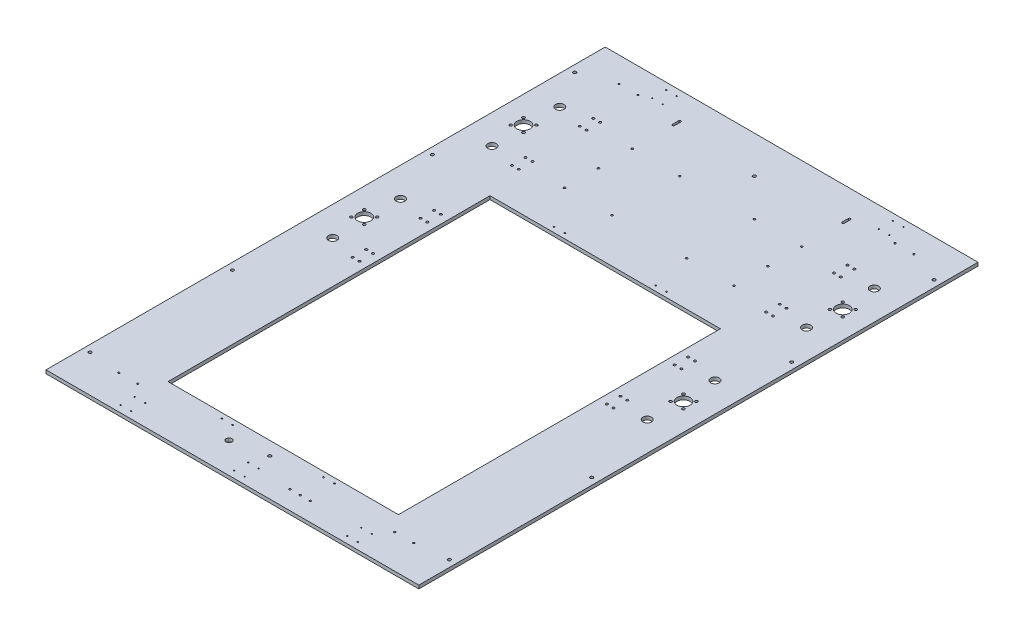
ISO-10303-21;
HEADER;
FILE_DESCRIPTION(('STEP AP214'),'2;1');
FILE_NAME('part.step','',(''),(''),'','','');
FILE_SCHEMA(('AUTOMOTIVE_DESIGN { 1 0 10303 214 1 1 1 1 }'));
ENDSEC;
DATA;
#1=APPLICATION_CONTEXT('core data for automotive mechanical design processes');
#2=APPLICATION_PROTOCOL_DEFINITION('international standard','automotive_design',2000,#1);
#3=PRODUCT_CONTEXT('',#1,'mechanical');
#4=PRODUCT('Part','Part','',(#3));
#5=PRODUCT_RELATED_PRODUCT_CATEGORY('part','',(#4));
#6=PRODUCT_DEFINITION_FORMATION('','',#4);
#7=PRODUCT_DEFINITION_CONTEXT('part definition',#1,'design');
#8=PRODUCT_DEFINITION('design','',#6,#7);
#9=PRODUCT_DEFINITION_SHAPE('','',#8);
#10=(LENGTH_UNIT() NAMED_UNIT(*) SI_UNIT(.MILLI.,.METRE.));
#11=(NAMED_UNIT(*) PLANE_ANGLE_UNIT() SI_UNIT($,.RADIAN.));
#12=(NAMED_UNIT(*) SI_UNIT($,.STERADIAN.) SOLID_ANGLE_UNIT());
#13=UNCERTAINTY_MEASURE_WITH_UNIT(LENGTH_MEASURE(1.E-05),#10,'distance_accuracy_value','');
#14=(GEOMETRIC_REPRESENTATION_CONTEXT(3) GLOBAL_UNCERTAINTY_ASSIGNED_CONTEXT((#13)) GLOBAL_UNIT_ASSIGNED_CONTEXT((#10,
#11,#12)) REPRESENTATION_CONTEXT('',''));
#15=CARTESIAN_POINT('',(0.,0.,0.));
#16=DIRECTION('',(0.,0.,1.));
#17=DIRECTION('',(1.,0.,0.));
#18=AXIS2_PLACEMENT_3D('',#15,#16,#17);
#19=CARTESIAN_POINT('',(0.,10.,0.));
#20=DIRECTION('',(0.,-1.,0.));
#21=DIRECTION('',(0.,0.,-1.));
#22=AXIS2_PLACEMENT_3D('',#19,#20,#21);
#23=PLANE('',#22);
#24=CARTESIAN_POINT('',(-250.,10.,-726.95));
#25=DIRECTION('',(0.,1.,0.));
#26=DIRECTION('',(0.,0.,1.));
#27=AXIS2_PLACEMENT_3D('',#24,#25,#26);
#28=CIRCLE('',#27,3.25);
#29=CARTESIAN_POINT('',(-253.25,10.,-726.95));
#30=VERTEX_POINT('',#29);
#31=CARTESIAN_POINT('',(-246.75,10.,-726.95));
#32=VERTEX_POINT('',#31);
#33=EDGE_CURVE('E312',#30,#32,#28,.T.);
#34=ORIENTED_EDGE('',*,*,#33,.F.);
#35=DIRECTION('',(0.,0.,-1.));
#36=VECTOR('',#35,1.);
#37=CARTESIAN_POINT('',(-253.25,10.,-726.95));
#38=LINE('',#37,#36);
#39=CARTESIAN_POINT('',(-253.25,10.,-745.45));
#40=VERTEX_POINT('',#39);
#41=EDGE_CURVE('E314',#30,#40,#38,.T.);
#42=ORIENTED_EDGE('',*,*,#41,.T.);
#43=CARTESIAN_POINT('',(-250.,10.,-745.45));
#44=DIRECTION('',(0.,1.,0.));
#45=DIRECTION('',(0.,0.,1.));
#46=AXIS2_PLACEMENT_3D('',#43,#44,#45);
#47=CIRCLE('',#46,3.25);
#48=CARTESIAN_POINT('',(-246.75,10.,-745.45));
#49=VERTEX_POINT('',#48);
#50=EDGE_CURVE('E324',#49,#40,#47,.T.);
#51=ORIENTED_EDGE('',*,*,#50,.F.);
#52=DIRECTION('',(0.,0.,-1.));
#53=VECTOR('',#52,1.);
#54=CARTESIAN_POINT('',(-246.75,10.,-726.95));
#55=LINE('',#54,#53);
#56=EDGE_CURVE('E303',#32,#49,#55,.T.);
#57=ORIENTED_EDGE('',*,*,#56,.F.);
#58=EDGE_LOOP('',(#34,#42,#51,#57));
#59=FACE_BOUND('',#58,.T.);
#60=CARTESIAN_POINT('',(250.,10.,-726.95));
#61=DIRECTION('',(0.,1.,0.));
#62=DIRECTION('',(0.,0.,1.));
#63=AXIS2_PLACEMENT_3D('',#60,#61,#62);
#64=CIRCLE('',#63,3.24999999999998);
#65=CARTESIAN_POINT('',(246.75,10.,-726.95));
#66=VERTEX_POINT('',#65);
#67=CARTESIAN_POINT('',(253.25,10.,-726.95));
#68=VERTEX_POINT('',#67);
#69=EDGE_CURVE('E344',#66,#68,#64,.T.);
#70=ORIENTED_EDGE('',*,*,#69,.F.);
#71=DIRECTION('',(0.,0.,-1.));
#72=VECTOR('',#71,1.);
#73=CARTESIAN_POINT('',(246.75,10.,-726.95));
#74=LINE('',#73,#72);
#75=CARTESIAN_POINT('',(246.75,10.,-745.45));
#76=VERTEX_POINT('',#75);
#77=EDGE_CURVE('E338',#66,#76,#74,.T.);
#78=ORIENTED_EDGE('',*,*,#77,.T.);
#79=CARTESIAN_POINT('',(250.,10.,-745.45));
#80=DIRECTION('',(0.,1.,0.));
#81=DIRECTION('',(0.,0.,1.));
#82=AXIS2_PLACEMENT_3D('',#79,#80,#81);
#83=CIRCLE('',#82,3.24999999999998);
#84=CARTESIAN_POINT('',(253.25,10.,-745.45));
#85=VERTEX_POINT('',#84);
#86=EDGE_CURVE('E354',#85,#76,#83,.T.);
#87=ORIENTED_EDGE('',*,*,#86,.F.);
#88=DIRECTION('',(0.,0.,-1.));
#89=VECTOR('',#88,1.);
#90=CARTESIAN_POINT('',(253.25,10.,-726.95));
#91=LINE('',#90,#89);
#92=EDGE_CURVE('E331',#68,#85,#91,.T.);
#93=ORIENTED_EDGE('',*,*,#92,.F.);
#94=EDGE_LOOP('',(#70,#78,#87,#93));
#95=FACE_BOUND('',#94,.T.);
#96=CARTESIAN_POINT('',(-490.,10.,-524.));
#97=DIRECTION('',(0.,1.,0.));
#98=DIRECTION('',(0.,0.,1.));
#99=AXIS2_PLACEMENT_3D('',#96,#97,#98);
#100=CIRCLE('',#99,4.);
#101=CARTESIAN_POINT('',(-490.,10.,-520.));
#102=VERTEX_POINT('',#101);
#103=EDGE_CURVE('E362',#102,#102,#100,.T.);
#104=ORIENTED_EDGE('',*,*,#103,.F.);
#105=EDGE_LOOP('',(#104));
#106=FACE_BOUND('',#105,.T.);
#107=CARTESIAN_POINT('',(-452.,10.,-524.));
#108=DIRECTION('',(0.,1.,0.));
#109=DIRECTION('',(0.,0.,1.));
#110=AXIS2_PLACEMENT_3D('',#107,#108,#109);
#111=CIRCLE('',#110,4.);
#112=CARTESIAN_POINT('',(-452.,10.,-520.));
#113=VERTEX_POINT('',#112);
#114=EDGE_CURVE('E368',#113,#113,#111,.T.);
#115=ORIENTED_EDGE('',*,*,#114,.F.);
#116=EDGE_LOOP('',(#115));
#117=FACE_BOUND('',#116,.T.);
#118=CARTESIAN_POINT('',(-452.,10.,-486.));
#119=DIRECTION('',(0.,1.,0.));
#120=DIRECTION('',(0.,0.,1.));
#121=AXIS2_PLACEMENT_3D('',#118,#119,#120);
#122=CIRCLE('',#121,4.);
#123=CARTESIAN_POINT('',(-452.,10.,-482.));
#124=VERTEX_POINT('',#123);
#125=EDGE_CURVE('E374',#124,#124,#122,.T.);
#126=ORIENTED_EDGE('',*,*,#125,.F.);
#127=EDGE_LOOP('',(#126));
#128=FACE_BOUND('',#127,.T.);
#129=CARTESIAN_POINT('',(-490.,10.,-486.));
#130=DIRECTION('',(0.,1.,0.));
#131=DIRECTION('',(0.,0.,1.));
#132=AXIS2_PLACEMENT_3D('',#129,#130,#131);
#133=CIRCLE('',#132,4.);
#134=CARTESIAN_POINT('',(-490.,10.,-482.));
#135=VERTEX_POINT('',#134);
#136=EDGE_CURVE('E380',#135,#135,#133,.T.);
#137=ORIENTED_EDGE('',*,*,#136,.F.);
#138=EDGE_LOOP('',(#137));
#139=FACE_BOUND('',#138,.T.);
#140=CARTESIAN_POINT('',(-452.,10.,-54.));
#141=DIRECTION('',(0.,1.,0.));
#142=DIRECTION('',(0.,0.,1.));
#143=AXIS2_PLACEMENT_3D('',#140,#141,#142);
#144=CIRCLE('',#143,4.);
#145=CARTESIAN_POINT('',(-452.,10.,-50.));
#146=VERTEX_POINT('',#145);
#147=EDGE_CURVE('E392',#146,#146,#144,.T.);
#148=ORIENTED_EDGE('',*,*,#147,.F.);
#149=EDGE_LOOP('',(#148));
#150=FACE_BOUND('',#149,.T.);
#151=CARTESIAN_POINT('',(-490.,10.,-16.));
#152=DIRECTION('',(0.,1.,0.));
#153=DIRECTION('',(0.,0.,1.));
#154=AXIS2_PLACEMENT_3D('',#151,#152,#153);
#155=CIRCLE('',#154,4.);
#156=CARTESIAN_POINT('',(-490.,10.,-12.));
#157=VERTEX_POINT('',#156);
#158=EDGE_CURVE('E404',#157,#157,#155,.T.);
#159=ORIENTED_EDGE('',*,*,#158,.F.);
#160=EDGE_LOOP('',(#159));
#161=FACE_BOUND('',#160,.T.);
#162=CARTESIAN_POINT('',(452.,10.,-16.));
#163=DIRECTION('',(0.,1.,0.));
#164=DIRECTION('',(0.,0.,1.));
#165=AXIS2_PLACEMENT_3D('',#162,#163,#164);
#166=CIRCLE('',#165,4.);
#167=CARTESIAN_POINT('',(452.,10.,-12.));
#168=VERTEX_POINT('',#167);
#169=EDGE_CURVE('E410',#168,#168,#166,.T.);
#170=ORIENTED_EDGE('',*,*,#169,.F.);
#171=EDGE_LOOP('',(#170));
#172=FACE_BOUND('',#171,.T.);
#173=CARTESIAN_POINT('',(490.,10.,-16.));
#174=DIRECTION('',(0.,1.,0.));
#175=DIRECTION('',(0.,0.,1.));
#176=AXIS2_PLACEMENT_3D('',#173,#174,#175);
#177=CIRCLE('',#176,4.);
#178=CARTESIAN_POINT('',(490.,10.,-12.));
#179=VERTEX_POINT('',#178);
#180=EDGE_CURVE('E416',#179,#179,#177,.T.);
#181=ORIENTED_EDGE('',*,*,#180,.F.);
#182=EDGE_LOOP('',(#181));
#183=FACE_BOUND('',#182,.T.);
#184=CARTESIAN_POINT('',(490.,10.,-54.));
#185=DIRECTION('',(0.,1.,0.));
#186=DIRECTION('',(0.,0.,1.));
#187=AXIS2_PLACEMENT_3D('',#184,#185,#186);
#188=CIRCLE('',#187,4.);
#189=CARTESIAN_POINT('',(490.,10.,-50.));
#190=VERTEX_POINT('',#189);
#191=EDGE_CURVE('E422',#190,#190,#188,.T.);
#192=ORIENTED_EDGE('',*,*,#191,.F.);
#193=EDGE_LOOP('',(#192));
#194=FACE_BOUND('',#193,.T.);
#195=CARTESIAN_POINT('',(452.,10.,-54.));
#196=DIRECTION('',(0.,1.,0.));
#197=DIRECTION('',(0.,0.,1.));
#198=AXIS2_PLACEMENT_3D('',#195,#196,#197);
#199=CIRCLE('',#198,4.);
#200=CARTESIAN_POINT('',(452.,10.,-50.));
#201=VERTEX_POINT('',#200);
#202=EDGE_CURVE('E428',#201,#201,#199,.T.);
#203=ORIENTED_EDGE('',*,*,#202,.F.);
#204=EDGE_LOOP('',(#203));
#205=FACE_BOUND('',#204,.T.);
#206=CARTESIAN_POINT('',(452.,10.,-486.));
#207=DIRECTION('',(0.,1.,0.));
#208=DIRECTION('',(0.,0.,1.));
#209=AXIS2_PLACEMENT_3D('',#206,#207,#208);
#210=CIRCLE('',#209,4.);
#211=CARTESIAN_POINT('',(452.,10.,-482.));
#212=VERTEX_POINT('',#211);
#213=EDGE_CURVE('E434',#212,#212,#210,.T.);
#214=ORIENTED_EDGE('',*,*,#213,.F.);
#215=EDGE_LOOP('',(#214));
#216=FACE_BOUND('',#215,.T.);
#217=CARTESIAN_POINT('',(490.,10.,-486.));
#218=DIRECTION('',(0.,1.,0.));
#219=DIRECTION('',(0.,0.,1.));
#220=AXIS2_PLACEMENT_3D('',#217,#218,#219);
#221=CIRCLE('',#220,4.);
#222=CARTESIAN_POINT('',(490.,10.,-482.));
#223=VERTEX_POINT('',#222);
#224=EDGE_CURVE('E440',#223,#223,#221,.T.);
#225=ORIENTED_EDGE('',*,*,#224,.F.);
#226=EDGE_LOOP('',(#225));
#227=FACE_BOUND('',#226,.T.);
#228=CARTESIAN_POINT('',(490.,10.,-524.));
#229=DIRECTION('',(0.,1.,0.));
#230=DIRECTION('',(0.,0.,1.));
#231=AXIS2_PLACEMENT_3D('',#228,#229,#230);
#232=CIRCLE('',#231,4.);
#233=CARTESIAN_POINT('',(490.,10.,-520.));
#234=VERTEX_POINT('',#233);
#235=EDGE_CURVE('E446',#234,#234,#232,.T.);
#236=ORIENTED_EDGE('',*,*,#235,.F.);
#237=EDGE_LOOP('',(#236));
#238=FACE_BOUND('',#237,.T.);
#239=CARTESIAN_POINT('',(452.,10.,-524.));
#240=DIRECTION('',(0.,1.,0.));
#241=DIRECTION('',(0.,0.,1.));
#242=AXIS2_PLACEMENT_3D('',#239,#240,#241);
#243=CIRCLE('',#242,4.);
#244=CARTESIAN_POINT('',(452.,10.,-520.));
#245=VERTEX_POINT('',#244);
#246=EDGE_CURVE('E452',#245,#245,#243,.T.);
#247=ORIENTED_EDGE('',*,*,#246,.F.);
#248=EDGE_LOOP('',(#247));
#249=FACE_BOUND('',#248,.T.);
#250=CARTESIAN_POINT('',(-471.,10.,-505.));
#251=DIRECTION('',(0.,1.,0.));
#252=DIRECTION('',(0.,0.,1.));
#253=AXIS2_PLACEMENT_3D('',#250,#251,#252);
#254=CIRCLE('',#253,19.5);
#255=CARTESIAN_POINT('',(-471.,10.,-485.5));
#256=VERTEX_POINT('',#255);
#257=EDGE_CURVE('E458',#256,#256,#254,.T.);
#258=ORIENTED_EDGE('',*,*,#257,.F.);
#259=EDGE_LOOP('',(#258));
#260=FACE_BOUND('',#259,.T.);
#261=CARTESIAN_POINT('',(471.,10.,-505.));
#262=DIRECTION('',(0.,1.,0.));
#263=DIRECTION('',(0.,0.,1.));
#264=AXIS2_PLACEMENT_3D('',#261,#262,#263);
#265=CIRCLE('',#264,19.5);
#266=CARTESIAN_POINT('',(471.,10.,-485.5));
#267=VERTEX_POINT('',#266);
#268=EDGE_CURVE('E464',#267,#267,#265,.T.);
#269=ORIENTED_EDGE('',*,*,#268,.F.);
#270=EDGE_LOOP('',(#269));
#271=FACE_BOUND('',#270,.T.);
#272=CARTESIAN_POINT('',(471.,10.,-35.));
#273=DIRECTION('',(0.,1.,0.));
#274=DIRECTION('',(0.,0.,1.));
#275=AXIS2_PLACEMENT_3D('',#272,#273,#274);
#276=CIRCLE('',#275,19.5);
#277=CARTESIAN_POINT('',(471.,10.,-15.5000000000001));
#278=VERTEX_POINT('',#277);
#279=EDGE_CURVE('E470',#278,#278,#276,.T.);
#280=ORIENTED_EDGE('',*,*,#279,.F.);
#281=EDGE_LOOP('',(#280));
#282=FACE_BOUND('',#281,.T.);
#283=CARTESIAN_POINT('',(-471.,10.,-35.));
#284=DIRECTION('',(0.,1.,0.));
#285=DIRECTION('',(0.,0.,1.));
#286=AXIS2_PLACEMENT_3D('',#283,#284,#285);
#287=CIRCLE('',#286,19.5);
#288=CARTESIAN_POINT('',(-471.,10.,-15.5000000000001));
#289=VERTEX_POINT('',#288);
#290=EDGE_CURVE('E476',#289,#289,#287,.T.);
#291=ORIENTED_EDGE('',*,*,#290,.F.);
#292=EDGE_LOOP('',(#291));
#293=FACE_BOUND('',#292,.T.);
#294=CARTESIAN_POINT('',(-464.,10.,-605.));
#295=DIRECTION('',(0.,1.,0.));
#296=DIRECTION('',(0.,0.,1.));
#297=AXIS2_PLACEMENT_3D('',#294,#295,#296);
#298=CIRCLE('',#297,12.5);
#299=CARTESIAN_POINT('',(-464.,10.,-592.5));
#300=VERTEX_POINT('',#299);
#301=EDGE_CURVE('E482',#300,#300,#298,.T.);
#302=ORIENTED_EDGE('',*,*,#301,.F.);
#303=EDGE_LOOP('',(#302));
#304=FACE_BOUND('',#303,.T.);
#305=CARTESIAN_POINT('',(-464.,10.,-405.));
#306=DIRECTION('',(0.,1.,0.));
#307=DIRECTION('',(0.,0.,1.));
#308=AXIS2_PLACEMENT_3D('',#305,#306,#307);
#309=CIRCLE('',#308,12.5);
#310=CARTESIAN_POINT('',(-464.,10.,-392.5));
#311=VERTEX_POINT('',#310);
#312=EDGE_CURVE('E488',#311,#311,#309,.T.);
#313=ORIENTED_EDGE('',*,*,#312,.F.);
#314=EDGE_LOOP('',(#313));
#315=FACE_BOUND('',#314,.T.);
#316=CARTESIAN_POINT('',(-464.,10.,-135.));
#317=DIRECTION('',(0.,1.,0.));
#318=DIRECTION('',(0.,0.,1.));
#319=AXIS2_PLACEMENT_3D('',#316,#317,#318);
#320=CIRCLE('',#319,12.5);
#321=CARTESIAN_POINT('',(-464.,10.,-122.5));
#322=VERTEX_POINT('',#321);
#323=EDGE_CURVE('E494',#322,#322,#320,.T.);
#324=ORIENTED_EDGE('',*,*,#323,.F.);
#325=EDGE_LOOP('',(#324));
#326=FACE_BOUND('',#325,.T.);
#327=CARTESIAN_POINT('',(-464.,10.,64.9999999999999));
#328=DIRECTION('',(0.,1.,0.));
#329=DIRECTION('',(0.,0.,1.));
#330=AXIS2_PLACEMENT_3D('',#327,#328,#329);
#331=CIRCLE('',#330,12.5);
#332=CARTESIAN_POINT('',(-464.,10.,77.5));
#333=VERTEX_POINT('',#332);
#334=EDGE_CURVE('E500',#333,#333,#331,.T.);
#335=ORIENTED_EDGE('',*,*,#334,.F.);
#336=EDGE_LOOP('',(#335));
#337=FACE_BOUND('',#336,.T.);
#338=CARTESIAN_POINT('',(464.,10.,64.9999999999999));
#339=DIRECTION('',(0.,1.,0.));
#340=DIRECTION('',(0.,0.,1.));
#341=AXIS2_PLACEMENT_3D('',#338,#339,#340);
#342=CIRCLE('',#341,12.5);
#343=CARTESIAN_POINT('',(464.,10.,77.5));
#344=VERTEX_POINT('',#343);
#345=EDGE_CURVE('E506',#344,#344,#342,.T.);
#346=ORIENTED_EDGE('',*,*,#345,.F.);
#347=EDGE_LOOP('',(#346));
#348=FACE_BOUND('',#347,.T.);
#349=CARTESIAN_POINT('',(464.,10.,-135.));
#350=DIRECTION('',(0.,1.,0.));
#351=DIRECTION('',(0.,0.,1.));
#352=AXIS2_PLACEMENT_3D('',#349,#350,#351);
#353=CIRCLE('',#352,12.5);
#354=CARTESIAN_POINT('',(464.,10.,-122.5));
#355=VERTEX_POINT('',#354);
#356=EDGE_CURVE('E512',#355,#355,#353,.T.);
#357=ORIENTED_EDGE('',*,*,#356,.F.);
#358=EDGE_LOOP('',(#357));
#359=FACE_BOUND('',#358,.T.);
#360=CARTESIAN_POINT('',(464.,10.,-405.));
#361=DIRECTION('',(0.,1.,0.));
#362=DIRECTION('',(0.,0.,1.));
#363=AXIS2_PLACEMENT_3D('',#360,#361,#362);
#364=CIRCLE('',#363,12.5);
#365=CARTESIAN_POINT('',(464.,10.,-392.5));
#366=VERTEX_POINT('',#365);
#367=EDGE_CURVE('E518',#366,#366,#364,.T.);
#368=ORIENTED_EDGE('',*,*,#367,.F.);
#369=EDGE_LOOP('',(#368));
#370=FACE_BOUND('',#369,.T.);
#371=CARTESIAN_POINT('',(464.,10.,-605.));
#372=DIRECTION('',(0.,1.,0.));
#373=DIRECTION('',(0.,0.,1.));
#374=AXIS2_PLACEMENT_3D('',#371,#372,#373);
#375=CIRCLE('',#374,12.5);
#376=CARTESIAN_POINT('',(464.,10.,-592.5));
#377=VERTEX_POINT('',#376);
#378=EDGE_CURVE('E524',#377,#377,#375,.T.);
#379=ORIENTED_EDGE('',*,*,#378,.F.);
#380=EDGE_LOOP('',(#379));
#381=FACE_BOUND('',#380,.T.);
#382=CARTESIAN_POINT('',(-365.,10.,-625.));
#383=DIRECTION('',(0.,1.,0.));
#384=DIRECTION('',(0.,0.,1.));
#385=AXIS2_PLACEMENT_3D('',#382,#383,#384);
#386=CIRCLE('',#385,3.40000000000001);
#387=CARTESIAN_POINT('',(-365.,10.,-621.6));
#388=VERTEX_POINT('',#387);
#389=EDGE_CURVE('E536',#388,#388,#386,.T.);
#390=ORIENTED_EDGE('',*,*,#389,.F.);
#391=EDGE_LOOP('',(#390));
#392=FACE_BOUND('',#391,.T.);
#393=CARTESIAN_POINT('',(365.,10.,-625.));
#394=DIRECTION('',(0.,1.,0.));
#395=DIRECTION('',(0.,0.,1.));
#396=AXIS2_PLACEMENT_3D('',#393,#394,#395);
#397=CIRCLE('',#396,3.40000000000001);
#398=CARTESIAN_POINT('',(365.,10.,-621.6));
#399=VERTEX_POINT('',#398);
#400=EDGE_CURVE('E542',#399,#399,#397,.T.);
#401=ORIENTED_EDGE('',*,*,#400,.F.);
#402=EDGE_LOOP('',(#401));
#403=FACE_BOUND('',#402,.T.);
#404=CARTESIAN_POINT('',(385.,10.,-625.));
#405=DIRECTION('',(0.,1.,0.));
#406=DIRECTION('',(0.,0.,1.));
#407=AXIS2_PLACEMENT_3D('',#404,#405,#406);
#408=CIRCLE('',#407,3.40000000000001);
#409=CARTESIAN_POINT('',(385.,10.,-621.6));
#410=VERTEX_POINT('',#409);
#411=EDGE_CURVE('E548',#410,#410,#408,.T.);
#412=ORIENTED_EDGE('',*,*,#411,.F.);
#413=EDGE_LOOP('',(#412));
#414=FACE_BOUND('',#413,.T.);
#415=CARTESIAN_POINT('',(385.,10.,-585.));
#416=DIRECTION('',(0.,1.,0.));
#417=DIRECTION('',(0.,0.,1.));
#418=AXIS2_PLACEMENT_3D('',#415,#416,#417);
#419=CIRCLE('',#418,3.40000000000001);
#420=CARTESIAN_POINT('',(385.,10.,-581.6));
#421=VERTEX_POINT('',#420);
#422=EDGE_CURVE('E554',#421,#421,#419,.T.);
#423=ORIENTED_EDGE('',*,*,#422,.F.);
#424=EDGE_LOOP('',(#423));
#425=FACE_BOUND('',#424,.T.);
#426=CARTESIAN_POINT('',(365.,10.,-585.));
#427=DIRECTION('',(0.,1.,0.));
#428=DIRECTION('',(0.,0.,1.));
#429=AXIS2_PLACEMENT_3D('',#426,#427,#428);
#430=CIRCLE('',#429,3.40000000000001);
#431=CARTESIAN_POINT('',(365.,10.,-581.6));
#432=VERTEX_POINT('',#431);
#433=EDGE_CURVE('E560',#432,#432,#430,.T.);
#434=ORIENTED_EDGE('',*,*,#433,.F.);
#435=EDGE_LOOP('',(#434));
#436=FACE_BOUND('',#435,.T.);
#437=CARTESIAN_POINT('',(-365.,10.,-585.));
#438=DIRECTION('',(0.,1.,0.));
#439=DIRECTION('',(0.,0.,1.));
#440=AXIS2_PLACEMENT_3D('',#437,#438,#439);
#441=CIRCLE('',#440,3.40000000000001);
#442=CARTESIAN_POINT('',(-365.,10.,-581.6));
#443=VERTEX_POINT('',#442);
#444=EDGE_CURVE('E566',#443,#443,#441,.T.);
#445=ORIENTED_EDGE('',*,*,#444,.F.);
#446=EDGE_LOOP('',(#445));
#447=FACE_BOUND('',#446,.T.);
#448=CARTESIAN_POINT('',(-385.,10.,-585.));
#449=DIRECTION('',(0.,1.,0.));
#450=DIRECTION('',(0.,0.,1.));
#451=AXIS2_PLACEMENT_3D('',#448,#449,#450);
#452=CIRCLE('',#451,3.40000000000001);
#453=CARTESIAN_POINT('',(-385.,10.,-581.6));
#454=VERTEX_POINT('',#453);
#455=EDGE_CURVE('E572',#454,#454,#452,.T.);
#456=ORIENTED_EDGE('',*,*,#455,.F.);
#457=EDGE_LOOP('',(#456));
#458=FACE_BOUND('',#457,.T.);
#459=CARTESIAN_POINT('',(-385.,10.,-425.));
#460=DIRECTION('',(0.,1.,0.));
#461=DIRECTION('',(0.,0.,1.));
#462=AXIS2_PLACEMENT_3D('',#459,#460,#461);
#463=CIRCLE('',#462,3.40000000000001);
#464=CARTESIAN_POINT('',(-385.,10.,-421.6));
#465=VERTEX_POINT('',#464);
#466=EDGE_CURVE('E578',#465,#465,#463,.T.);
#467=ORIENTED_EDGE('',*,*,#466,.F.);
#468=EDGE_LOOP('',(#467));
#469=FACE_BOUND('',#468,.T.);
#470=CARTESIAN_POINT('',(-365.,10.,-425.));
#471=DIRECTION('',(0.,1.,0.));
#472=DIRECTION('',(0.,0.,1.));
#473=AXIS2_PLACEMENT_3D('',#470,#471,#472);
#474=CIRCLE('',#473,3.40000000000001);
#475=CARTESIAN_POINT('',(-365.,10.,-421.6));
#476=VERTEX_POINT('',#475);
#477=EDGE_CURVE('E584',#476,#476,#474,.T.);
#478=ORIENTED_EDGE('',*,*,#477,.F.);
#479=EDGE_LOOP('',(#478));
#480=FACE_BOUND('',#479,.T.);
#481=CARTESIAN_POINT('',(-365.,10.,-385.));
#482=DIRECTION('',(0.,1.,0.));
#483=DIRECTION('',(0.,0.,1.));
#484=AXIS2_PLACEMENT_3D('',#481,#482,#483);
#485=CIRCLE('',#484,3.40000000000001);
#486=CARTESIAN_POINT('',(-365.,10.,-381.6));
#487=VERTEX_POINT('',#486);
#488=EDGE_CURVE('E590',#487,#487,#485,.T.);
#489=ORIENTED_EDGE('',*,*,#488,.F.);
#490=EDGE_LOOP('',(#489));
#491=FACE_BOUND('',#490,.T.);
#492=CARTESIAN_POINT('',(-385.,10.,-385.));
#493=DIRECTION('',(0.,1.,0.));
#494=DIRECTION('',(0.,0.,1.));
#495=AXIS2_PLACEMENT_3D('',#492,#493,#494);
#496=CIRCLE('',#495,3.40000000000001);
#497=CARTESIAN_POINT('',(-385.,10.,-381.6));
#498=VERTEX_POINT('',#497);
#499=EDGE_CURVE('E596',#498,#498,#496,.T.);
#500=ORIENTED_EDGE('',*,*,#499,.F.);
#501=EDGE_LOOP('',(#500));
#502=FACE_BOUND('',#501,.T.);
#503=CARTESIAN_POINT('',(365.,10.,-385.));
#504=DIRECTION('',(0.,1.,0.));
#505=DIRECTION('',(0.,0.,1.));
#506=AXIS2_PLACEMENT_3D('',#503,#504,#505);
#507=CIRCLE('',#506,3.40000000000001);
#508=CARTESIAN_POINT('',(365.,10.,-381.6));
#509=VERTEX_POINT('',#508);
#510=EDGE_CURVE('E602',#509,#509,#507,.T.);
#511=ORIENTED_EDGE('',*,*,#510,.F.);
#512=EDGE_LOOP('',(#511));
#513=FACE_BOUND('',#512,.T.);
#514=CARTESIAN_POINT('',(385.,10.,-385.));
#515=DIRECTION('',(0.,1.,0.));
#516=DIRECTION('',(0.,0.,1.));
#517=AXIS2_PLACEMENT_3D('',#514,#515,#516);
#518=CIRCLE('',#517,3.40000000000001);
#519=CARTESIAN_POINT('',(385.,10.,-381.6));
#520=VERTEX_POINT('',#519);
#521=EDGE_CURVE('E608',#520,#520,#518,.T.);
#522=ORIENTED_EDGE('',*,*,#521,.F.);
#523=EDGE_LOOP('',(#522));
#524=FACE_BOUND('',#523,.T.);
#525=CARTESIAN_POINT('',(385.,10.,-425.));
#526=DIRECTION('',(0.,1.,0.));
#527=DIRECTION('',(0.,0.,1.));
#528=AXIS2_PLACEMENT_3D('',#525,#526,#527);
#529=CIRCLE('',#528,3.40000000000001);
#530=CARTESIAN_POINT('',(385.,10.,-421.6));
#531=VERTEX_POINT('',#530);
#532=EDGE_CURVE('E614',#531,#531,#529,.T.);
#533=ORIENTED_EDGE('',*,*,#532,.F.);
#534=EDGE_LOOP('',(#533));
#535=FACE_BOUND('',#534,.T.);
#536=CARTESIAN_POINT('',(365.,10.,-425.));
#537=DIRECTION('',(0.,1.,0.));
#538=DIRECTION('',(0.,0.,1.));
#539=AXIS2_PLACEMENT_3D('',#536,#537,#538);
#540=CIRCLE('',#539,3.40000000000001);
#541=CARTESIAN_POINT('',(365.,10.,-421.6));
#542=VERTEX_POINT('',#541);
#543=EDGE_CURVE('E620',#542,#542,#540,.T.);
#544=ORIENTED_EDGE('',*,*,#543,.F.);
#545=EDGE_LOOP('',(#544));
#546=FACE_BOUND('',#545,.T.);
#547=CARTESIAN_POINT('',(-365.,10.,-155.));
#548=DIRECTION('',(0.,1.,0.));
#549=DIRECTION('',(0.,0.,1.));
#550=AXIS2_PLACEMENT_3D('',#547,#548,#549);
#551=CIRCLE('',#550,3.40000000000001);
#552=CARTESIAN_POINT('',(-365.,10.,-151.6));
#553=VERTEX_POINT('',#552);
#554=EDGE_CURVE('E626',#553,#553,#551,.T.);
#555=ORIENTED_EDGE('',*,*,#554,.F.);
#556=EDGE_LOOP('',(#555));
#557=FACE_BOUND('',#556,.T.);
#558=CARTESIAN_POINT('',(-385.,10.,-155.));
#559=DIRECTION('',(0.,1.,0.));
#560=DIRECTION('',(0.,0.,1.));
#561=AXIS2_PLACEMENT_3D('',#558,#559,#560);
#562=CIRCLE('',#561,3.40000000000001);
#563=CARTESIAN_POINT('',(-385.,10.,-151.6));
#564=VERTEX_POINT('',#563);
#565=EDGE_CURVE('E632',#564,#564,#562,.T.);
#566=ORIENTED_EDGE('',*,*,#565,.F.);
#567=EDGE_LOOP('',(#566));
#568=FACE_BOUND('',#567,.T.);
#569=CARTESIAN_POINT('',(-385.,10.,-115.));
#570=DIRECTION('',(0.,1.,0.));
#571=DIRECTION('',(0.,0.,1.));
#572=AXIS2_PLACEMENT_3D('',#569,#570,#571);
#573=CIRCLE('',#572,3.40000000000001);
#574=CARTESIAN_POINT('',(-385.,10.,-111.6));
#575=VERTEX_POINT('',#574);
#576=EDGE_CURVE('E638',#575,#575,#573,.T.);
#577=ORIENTED_EDGE('',*,*,#576,.F.);
#578=EDGE_LOOP('',(#577));
#579=FACE_BOUND('',#578,.T.);
#580=CARTESIAN_POINT('',(-365.,10.,-115.));
#581=DIRECTION('',(0.,1.,0.));
#582=DIRECTION('',(0.,0.,1.));
#583=AXIS2_PLACEMENT_3D('',#580,#581,#582);
#584=CIRCLE('',#583,3.40000000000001);
#585=CARTESIAN_POINT('',(-365.,10.,-111.6));
#586=VERTEX_POINT('',#585);
#587=EDGE_CURVE('E644',#586,#586,#584,.T.);
#588=ORIENTED_EDGE('',*,*,#587,.F.);
#589=EDGE_LOOP('',(#588));
#590=FACE_BOUND('',#589,.T.);
#591=CARTESIAN_POINT('',(-365.,10.,44.9999999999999));
#592=DIRECTION('',(0.,1.,0.));
#593=DIRECTION('',(0.,0.,1.));
#594=AXIS2_PLACEMENT_3D('',#591,#592,#593);
#595=CIRCLE('',#594,3.40000000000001);
#596=CARTESIAN_POINT('',(-365.,10.,48.3999999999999));
#597=VERTEX_POINT('',#596);
#598=EDGE_CURVE('E650',#597,#597,#595,.T.);
#599=ORIENTED_EDGE('',*,*,#598,.F.);
#600=EDGE_LOOP('',(#599));
#601=FACE_BOUND('',#600,.T.);
#602=CARTESIAN_POINT('',(-385.,10.,44.9999999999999));
#603=DIRECTION('',(0.,1.,0.));
#604=DIRECTION('',(0.,0.,1.));
#605=AXIS2_PLACEMENT_3D('',#602,#603,#604);
#606=CIRCLE('',#605,3.40000000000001);
#607=CARTESIAN_POINT('',(-385.,10.,48.3999999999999));
#608=VERTEX_POINT('',#607);
#609=EDGE_CURVE('E656',#608,#608,#606,.T.);
#610=ORIENTED_EDGE('',*,*,#609,.F.);
#611=EDGE_LOOP('',(#610));
#612=FACE_BOUND('',#611,.T.);
#613=CARTESIAN_POINT('',(-385.,10.,85.));
#614=DIRECTION('',(0.,1.,0.));
#615=DIRECTION('',(0.,0.,1.));
#616=AXIS2_PLACEMENT_3D('',#613,#614,#615);
#617=CIRCLE('',#616,3.40000000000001);
#618=CARTESIAN_POINT('',(-385.,10.,88.4));
#619=VERTEX_POINT('',#618);
#620=EDGE_CURVE('E662',#619,#619,#617,.T.);
#621=ORIENTED_EDGE('',*,*,#620,.F.);
#622=EDGE_LOOP('',(#621));
#623=FACE_BOUND('',#622,.T.);
#624=CARTESIAN_POINT('',(-365.,10.,85.));
#625=DIRECTION('',(0.,1.,0.));
#626=DIRECTION('',(0.,0.,1.));
#627=AXIS2_PLACEMENT_3D('',#624,#625,#626);
#628=CIRCLE('',#627,3.40000000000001);
#629=CARTESIAN_POINT('',(-365.,10.,88.4));
#630=VERTEX_POINT('',#629);
#631=EDGE_CURVE('E668',#630,#630,#628,.T.);
#632=ORIENTED_EDGE('',*,*,#631,.F.);
#633=EDGE_LOOP('',(#632));
#634=FACE_BOUND('',#633,.T.);
#635=CARTESIAN_POINT('',(365.,10.,85.));
#636=DIRECTION('',(0.,1.,0.));
#637=DIRECTION('',(0.,0.,1.));
#638=AXIS2_PLACEMENT_3D('',#635,#636,#637);
#639=CIRCLE('',#638,3.40000000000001);
#640=CARTESIAN_POINT('',(365.,10.,88.4));
#641=VERTEX_POINT('',#640);
#642=EDGE_CURVE('E674',#641,#641,#639,.T.);
#643=ORIENTED_EDGE('',*,*,#642,.F.);
#644=EDGE_LOOP('',(#643));
#645=FACE_BOUND('',#644,.T.);
#646=CARTESIAN_POINT('',(385.,10.,85.));
#647=DIRECTION('',(0.,1.,0.));
#648=DIRECTION('',(0.,0.,1.));
#649=AXIS2_PLACEMENT_3D('',#646,#647,#648);
#650=CIRCLE('',#649,3.40000000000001);
#651=CARTESIAN_POINT('',(385.,10.,88.4));
#652=VERTEX_POINT('',#651);
#653=EDGE_CURVE('E680',#652,#652,#650,.T.);
#654=ORIENTED_EDGE('',*,*,#653,.F.);
#655=EDGE_LOOP('',(#654));
#656=FACE_BOUND('',#655,.T.);
#657=CARTESIAN_POINT('',(385.,10.,44.9999999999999));
#658=DIRECTION('',(0.,1.,0.));
#659=DIRECTION('',(0.,0.,1.));
#660=AXIS2_PLACEMENT_3D('',#657,#658,#659);
#661=CIRCLE('',#660,3.40000000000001);
#662=CARTESIAN_POINT('',(385.,10.,48.3999999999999));
#663=VERTEX_POINT('',#662);
#664=EDGE_CURVE('E686',#663,#663,#661,.T.);
#665=ORIENTED_EDGE('',*,*,#664,.F.);
#666=EDGE_LOOP('',(#665));
#667=FACE_BOUND('',#666,.T.);
#668=CARTESIAN_POINT('',(365.,10.,44.9999999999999));
#669=DIRECTION('',(0.,1.,0.));
#670=DIRECTION('',(0.,0.,1.));
#671=AXIS2_PLACEMENT_3D('',#668,#669,#670);
#672=CIRCLE('',#671,3.40000000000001);
#673=CARTESIAN_POINT('',(365.,10.,48.3999999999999));
#674=VERTEX_POINT('',#673);
#675=EDGE_CURVE('E692',#674,#674,#672,.T.);
#676=ORIENTED_EDGE('',*,*,#675,.F.);
#677=EDGE_LOOP('',(#676));
#678=FACE_BOUND('',#677,.T.);
#679=CARTESIAN_POINT('',(365.,10.,-115.));
#680=DIRECTION('',(0.,1.,0.));
#681=DIRECTION('',(0.,0.,1.));
#682=AXIS2_PLACEMENT_3D('',#679,#680,#681);
#683=CIRCLE('',#682,3.40000000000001);
#684=CARTESIAN_POINT('',(365.,10.,-111.6));
#685=VERTEX_POINT('',#684);
#686=EDGE_CURVE('E698',#685,#685,#683,.T.);
#687=ORIENTED_EDGE('',*,*,#686,.F.);
#688=EDGE_LOOP('',(#687));
#689=FACE_BOUND('',#688,.T.);
#690=CARTESIAN_POINT('',(385.,10.,-115.));
#691=DIRECTION('',(0.,1.,0.));
#692=DIRECTION('',(0.,0.,1.));
#693=AXIS2_PLACEMENT_3D('',#690,#691,#692);
#694=CIRCLE('',#693,3.40000000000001);
#695=CARTESIAN_POINT('',(385.,10.,-111.6));
#696=VERTEX_POINT('',#695);
#697=EDGE_CURVE('E704',#696,#696,#694,.T.);
#698=ORIENTED_EDGE('',*,*,#697,.F.);
#699=EDGE_LOOP('',(#698));
#700=FACE_BOUND('',#699,.T.);
#701=CARTESIAN_POINT('',(385.,10.,-155.));
#702=DIRECTION('',(0.,1.,0.));
#703=DIRECTION('',(0.,0.,1.));
#704=AXIS2_PLACEMENT_3D('',#701,#702,#703);
#705=CIRCLE('',#704,3.40000000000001);
#706=CARTESIAN_POINT('',(385.,10.,-151.6));
#707=VERTEX_POINT('',#706);
#708=EDGE_CURVE('E710',#707,#707,#705,.T.);
#709=ORIENTED_EDGE('',*,*,#708,.F.);
#710=EDGE_LOOP('',(#709));
#711=FACE_BOUND('',#710,.T.);
#712=CARTESIAN_POINT('',(365.,10.,-155.));
#713=DIRECTION('',(0.,1.,0.));
#714=DIRECTION('',(0.,0.,1.));
#715=AXIS2_PLACEMENT_3D('',#712,#713,#714);
#716=CIRCLE('',#715,3.40000000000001);
#717=CARTESIAN_POINT('',(365.,10.,-151.6));
#718=VERTEX_POINT('',#717);
#719=EDGE_CURVE('E716',#718,#718,#716,.T.);
#720=ORIENTED_EDGE('',*,*,#719,.F.);
#721=EDGE_LOOP('',(#720));
#722=FACE_BOUND('',#721,.T.);
#723=CARTESIAN_POINT('',(-530.,10.,-715.));
#724=DIRECTION('',(0.,1.,0.));
#725=DIRECTION('',(0.,0.,1.));
#726=AXIS2_PLACEMENT_3D('',#723,#724,#725);
#727=CIRCLE('',#726,4.49999999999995);
#728=CARTESIAN_POINT('',(-530.,10.,-710.5));
#729=VERTEX_POINT('',#728);
#730=EDGE_CURVE('E722',#729,#729,#727,.T.);
#731=ORIENTED_EDGE('',*,*,#730,.F.);
#732=EDGE_LOOP('',(#731));
#733=FACE_BOUND('',#732,.T.);
#734=CARTESIAN_POINT('',(-530.,10.,-295.));
#735=DIRECTION('',(0.,1.,0.));
#736=DIRECTION('',(0.,0.,1.));
#737=AXIS2_PLACEMENT_3D('',#734,#735,#736);
#738=CIRCLE('',#737,4.49999999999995);
#739=CARTESIAN_POINT('',(-530.,10.,-290.5));
#740=VERTEX_POINT('',#739);
#741=EDGE_CURVE('E728',#740,#740,#738,.T.);
#742=ORIENTED_EDGE('',*,*,#741,.F.);
#743=EDGE_LOOP('',(#742));
#744=FACE_BOUND('',#743,.T.);
#745=CARTESIAN_POINT('',(-530.,10.,295.));
#746=DIRECTION('',(0.,1.,0.));
#747=DIRECTION('',(0.,0.,1.));
#748=AXIS2_PLACEMENT_3D('',#745,#746,#747);
#749=CIRCLE('',#748,4.49999999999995);
#750=CARTESIAN_POINT('',(-530.,10.,299.5));
#751=VERTEX_POINT('',#750);
#752=EDGE_CURVE('E734',#751,#751,#749,.T.);
#753=ORIENTED_EDGE('',*,*,#752,.F.);
#754=EDGE_LOOP('',(#753));
#755=FACE_BOUND('',#754,.T.);
#756=CARTESIAN_POINT('',(-530.,10.,715.));
#757=DIRECTION('',(0.,1.,0.));
#758=DIRECTION('',(0.,0.,1.));
#759=AXIS2_PLACEMENT_3D('',#756,#757,#758);
#760=CIRCLE('',#759,4.49999999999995);
#761=CARTESIAN_POINT('',(-530.,10.,719.5));
#762=VERTEX_POINT('',#761);
#763=EDGE_CURVE('E740',#762,#762,#760,.T.);
#764=ORIENTED_EDGE('',*,*,#763,.F.);
#765=EDGE_LOOP('',(#764));
#766=FACE_BOUND('',#765,.T.);
#767=CARTESIAN_POINT('',(530.,10.,715.));
#768=DIRECTION('',(0.,1.,0.));
#769=DIRECTION('',(0.,0.,1.));
#770=AXIS2_PLACEMENT_3D('',#767,#768,#769);
#771=CIRCLE('',#770,4.49999999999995);
#772=CARTESIAN_POINT('',(530.,10.,719.5));
#773=VERTEX_POINT('',#772);
#774=EDGE_CURVE('E752',#773,#773,#771,.T.);
#775=ORIENTED_EDGE('',*,*,#774,.F.);
#776=EDGE_LOOP('',(#775));
#777=FACE_BOUND('',#776,.T.);
#778=CARTESIAN_POINT('',(530.,10.,-295.));
#779=DIRECTION('',(0.,1.,0.));
#780=DIRECTION('',(0.,0.,1.));
#781=AXIS2_PLACEMENT_3D('',#778,#779,#780);
#782=CIRCLE('',#781,4.49999999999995);
#783=CARTESIAN_POINT('',(530.,10.,-290.5));
#784=VERTEX_POINT('',#783);
#785=EDGE_CURVE('E764',#784,#784,#782,.T.);
#786=ORIENTED_EDGE('',*,*,#785,.F.);
#787=EDGE_LOOP('',(#786));
#788=FACE_BOUND('',#787,.T.);
#789=CARTESIAN_POINT('',(530.,10.,-715.));
#790=DIRECTION('',(0.,1.,0.));
#791=DIRECTION('',(0.,0.,1.));
#792=AXIS2_PLACEMENT_3D('',#789,#790,#791);
#793=CIRCLE('',#792,4.49999999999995);
#794=CARTESIAN_POINT('',(530.,10.,-710.5));
#795=VERTEX_POINT('',#794);
#796=EDGE_CURVE('E770',#795,#795,#793,.T.);
#797=ORIENTED_EDGE('',*,*,#796,.F.);
#798=EDGE_LOOP('',(#797));
#799=FACE_BOUND('',#798,.T.);
#800=CARTESIAN_POINT('',(-1.11022302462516E-13,10.,-715.));
#801=DIRECTION('',(0.,1.,0.));
#802=DIRECTION('',(0.,0.,1.));
#803=AXIS2_PLACEMENT_3D('',#800,#801,#802);
#804=CIRCLE('',#803,4.49999999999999);
#805=CARTESIAN_POINT('',(-1.11022302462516E-13,10.,-710.5));
#806=VERTEX_POINT('',#805);
#807=EDGE_CURVE('E776',#806,#806,#804,.T.);
#808=ORIENTED_EDGE('',*,*,#807,.F.);
#809=EDGE_LOOP('',(#808));
#810=FACE_BOUND('',#809,.T.);
#811=CARTESIAN_POINT('',(175.,10.,770.));
#812=DIRECTION('',(0.,-1.,0.));
#813=DIRECTION('',(0.,0.,-1.));
#814=AXIS2_PLACEMENT_3D('',#811,#812,#813);
#815=CIRCLE('',#814,2.75);
#816=CARTESIAN_POINT('',(175.,10.,767.25));
#817=VERTEX_POINT('',#816);
#818=EDGE_CURVE('E785',#817,#817,#815,.T.);
#819=ORIENTED_EDGE('',*,*,#818,.T.);
#820=EDGE_LOOP('',(#819));
#821=FACE_BOUND('',#820,.T.);
#822=CARTESIAN_POINT('',(145.,10.,770.));
#823=DIRECTION('',(0.,-1.,0.));
#824=DIRECTION('',(0.,0.,-1.));
#825=AXIS2_PLACEMENT_3D('',#822,#823,#824);
#826=CIRCLE('',#825,2.75);
#827=CARTESIAN_POINT('',(145.,10.,767.25));
#828=VERTEX_POINT('',#827);
#829=EDGE_CURVE('E791',#828,#828,#826,.T.);
#830=ORIENTED_EDGE('',*,*,#829,.T.);
#831=EDGE_LOOP('',(#830));
#832=FACE_BOUND('',#831,.T.);
#833=CARTESIAN_POINT('',(115.,10.,770.));
#834=DIRECTION('',(0.,-1.,0.));
#835=DIRECTION('',(0.,0.,-1.));
#836=AXIS2_PLACEMENT_3D('',#833,#834,#835);
#837=CIRCLE('',#836,2.75);
#838=CARTESIAN_POINT('',(115.,10.,767.25));
#839=VERTEX_POINT('',#838);
#840=EDGE_CURVE('E797',#839,#839,#837,.T.);
#841=ORIENTED_EDGE('',*,*,#840,.T.);
#842=EDGE_LOOP('',(#841));
#843=FACE_BOUND('',#842,.T.);
#844=CARTESIAN_POINT('',(-100.,10.,735.));
#845=DIRECTION('',(0.,1.,0.));
#846=DIRECTION('',(0.,0.,1.));
#847=AXIS2_PLACEMENT_3D('',#844,#845,#846);
#848=CIRCLE('',#847,8.74999999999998);
#849=CARTESIAN_POINT('',(-100.,10.,743.75));
#850=VERTEX_POINT('',#849);
#851=EDGE_CURVE('E800',#850,#850,#848,.T.);
#852=ORIENTED_EDGE('',*,*,#851,.F.);
#853=EDGE_LOOP('',(#852));
#854=FACE_BOUND('',#853,.T.);
#855=CARTESIAN_POINT('',(-166.,10.,-290.));
#856=DIRECTION('',(0.,1.,0.));
#857=DIRECTION('',(0.,0.,1.));
#858=AXIS2_PLACEMENT_3D('',#855,#856,#857);
#859=CIRCLE('',#858,2.09999999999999);
#860=CARTESIAN_POINT('',(-166.,10.,-287.9));
#861=VERTEX_POINT('',#860);
#862=EDGE_CURVE('E806',#861,#861,#859,.T.);
#863=ORIENTED_EDGE('',*,*,#862,.F.);
#864=EDGE_LOOP('',(#863));
#865=FACE_BOUND('',#864,.T.);
#866=CARTESIAN_POINT('',(-134.,10.,-290.));
#867=DIRECTION('',(0.,1.,0.));
#868=DIRECTION('',(0.,0.,1.));
#869=AXIS2_PLACEMENT_3D('',#866,#867,#868);
#870=CIRCLE('',#869,2.09999999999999);
#871=CARTESIAN_POINT('',(-134.,10.,-287.9));
#872=VERTEX_POINT('',#871);
#873=EDGE_CURVE('E812',#872,#872,#870,.T.);
#874=ORIENTED_EDGE('',*,*,#873,.F.);
#875=EDGE_LOOP('',(#874));
#876=FACE_BOUND('',#875,.T.);
#877=CARTESIAN_POINT('',(134.,10.,-290.));
#878=DIRECTION('',(0.,1.,0.));
#879=DIRECTION('',(0.,0.,1.));
#880=AXIS2_PLACEMENT_3D('',#877,#878,#879);
#881=CIRCLE('',#880,2.09999999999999);
#882=CARTESIAN_POINT('',(134.,10.,-287.9));
#883=VERTEX_POINT('',#882);
#884=EDGE_CURVE('E818',#883,#883,#881,.T.);
#885=ORIENTED_EDGE('',*,*,#884,.F.);
#886=EDGE_LOOP('',(#885));
#887=FACE_BOUND('',#886,.T.);
#888=CARTESIAN_POINT('',(166.,10.,-290.));
#889=DIRECTION('',(0.,1.,0.));
#890=DIRECTION('',(0.,0.,1.));
#891=AXIS2_PLACEMENT_3D('',#888,#889,#890);
#892=CIRCLE('',#891,2.09999999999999);
#893=CARTESIAN_POINT('',(166.,10.,-287.9));
#894=VERTEX_POINT('',#893);
#895=EDGE_CURVE('E824',#894,#894,#892,.T.);
#896=ORIENTED_EDGE('',*,*,#895,.F.);
#897=EDGE_LOOP('',(#896));
#898=FACE_BOUND('',#897,.T.);
#899=CARTESIAN_POINT('',(-166.,10.,690.));
#900=DIRECTION('',(0.,1.,0.));
#901=DIRECTION('',(0.,0.,1.));
#902=AXIS2_PLACEMENT_3D('',#899,#900,#901);
#903=CIRCLE('',#902,2.09999999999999);
#904=CARTESIAN_POINT('',(-166.,10.,692.1));
#905=VERTEX_POINT('',#904);
#906=EDGE_CURVE('E830',#905,#905,#903,.T.);
#907=ORIENTED_EDGE('',*,*,#906,.F.);
#908=EDGE_LOOP('',(#907));
#909=FACE_BOUND('',#908,.T.);
#910=CARTESIAN_POINT('',(-134.,10.,690.));
#911=DIRECTION('',(0.,1.,0.));
#912=DIRECTION('',(0.,0.,1.));
#913=AXIS2_PLACEMENT_3D('',#910,#911,#912);
#914=CIRCLE('',#913,2.09999999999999);
#915=CARTESIAN_POINT('',(-134.,10.,692.1));
#916=VERTEX_POINT('',#915);
#917=EDGE_CURVE('E836',#916,#916,#914,.T.);
#918=ORIENTED_EDGE('',*,*,#917,.F.);
#919=EDGE_LOOP('',(#918));
#920=FACE_BOUND('',#919,.T.);
#921=CARTESIAN_POINT('',(134.,10.,690.));
#922=DIRECTION('',(0.,1.,0.));
#923=DIRECTION('',(0.,0.,1.));
#924=AXIS2_PLACEMENT_3D('',#921,#922,#923);
#925=CIRCLE('',#924,2.09999999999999);
#926=CARTESIAN_POINT('',(134.,10.,692.1));
#927=VERTEX_POINT('',#926);
#928=EDGE_CURVE('E842',#927,#927,#925,.T.);
#929=ORIENTED_EDGE('',*,*,#928,.F.);
#930=EDGE_LOOP('',(#929));
#931=FACE_BOUND('',#930,.T.);
#932=CARTESIAN_POINT('',(166.,10.,690.));
#933=DIRECTION('',(0.,1.,0.));
#934=DIRECTION('',(0.,0.,1.));
#935=AXIS2_PLACEMENT_3D('',#932,#933,#934);
#936=CIRCLE('',#935,2.09999999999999);
#937=CARTESIAN_POINT('',(166.,10.,692.1));
#938=VERTEX_POINT('',#937);
#939=EDGE_CURVE('E848',#938,#938,#936,.T.);
#940=ORIENTED_EDGE('',*,*,#939,.F.);
#941=EDGE_LOOP('',(#940));
#942=FACE_BOUND('',#941,.T.);
#943=CARTESIAN_POINT('',(-250.,10.,-605.));
#944=DIRECTION('',(0.,-1.,0.));
#945=DIRECTION('',(0.,0.,-1.));
#946=AXIS2_PLACEMENT_3D('',#943,#944,#945);
#947=CIRCLE('',#946,3.);
#948=CARTESIAN_POINT('',(-250.,10.,-608.));
#949=VERTEX_POINT('',#948);
#950=EDGE_CURVE('E857',#949,#949,#947,.T.);
#951=ORIENTED_EDGE('',*,*,#950,.T.);
#952=EDGE_LOOP('',(#951));
#953=FACE_BOUND('',#952,.T.);
#954=CARTESIAN_POINT('',(-110.,10.,-605.));
#955=DIRECTION('',(0.,-1.,0.));
#956=DIRECTION('',(0.,0.,-1.));
#957=AXIS2_PLACEMENT_3D('',#954,#955,#956);
#958=CIRCLE('',#957,2.99999999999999);
#959=CARTESIAN_POINT('',(-110.,10.,-608.));
#960=VERTEX_POINT('',#959);
#961=EDGE_CURVE('E863',#960,#960,#958,.T.);
#962=ORIENTED_EDGE('',*,*,#961,.T.);
#963=EDGE_LOOP('',(#962));
#964=FACE_BOUND('',#963,.T.);
#965=CARTESIAN_POINT('',(250.,10.,-605.));
#966=DIRECTION('',(0.,-1.,0.));
#967=DIRECTION('',(0.,0.,-1.));
#968=AXIS2_PLACEMENT_3D('',#965,#966,#967);
#969=CIRCLE('',#968,3.);
#970=CARTESIAN_POINT('',(250.,10.,-608.));
#971=VERTEX_POINT('',#970);
#972=EDGE_CURVE('E869',#971,#971,#969,.T.);
#973=ORIENTED_EDGE('',*,*,#972,.T.);
#974=EDGE_LOOP('',(#973));
#975=FACE_BOUND('',#974,.T.);
#976=CARTESIAN_POINT('',(250.,10.,-505.));
#977=DIRECTION('',(0.,-1.,0.));
#978=DIRECTION('',(0.,0.,-1.));
#979=AXIS2_PLACEMENT_3D('',#976,#977,#978);
#980=CIRCLE('',#979,3.);
#981=CARTESIAN_POINT('',(250.,10.,-508.));
#982=VERTEX_POINT('',#981);
#983=EDGE_CURVE('E875',#982,#982,#980,.T.);
#984=ORIENTED_EDGE('',*,*,#983,.T.);
#985=EDGE_LOOP('',(#984));
#986=FACE_BOUND('',#985,.T.);
#987=CARTESIAN_POINT('',(-250.,10.,-505.));
#988=DIRECTION('',(0.,-1.,0.));
#989=DIRECTION('',(0.,0.,-1.));
#990=AXIS2_PLACEMENT_3D('',#987,#988,#989);
#991=CIRCLE('',#990,3.);
#992=CARTESIAN_POINT('',(-250.,10.,-508.));
#993=VERTEX_POINT('',#992);
#994=EDGE_CURVE('E189',#993,#993,#991,.T.);
#995=ORIENTED_EDGE('',*,*,#994,.T.);
#996=EDGE_LOOP('',(#995));
#997=FACE_BOUND('',#996,.T.);
#998=CARTESIAN_POINT('',(-250.,10.,-405.));
#999=DIRECTION('',(0.,-1.,0.));
#1000=DIRECTION('',(0.,0.,-1.));
#1001=AXIS2_PLACEMENT_3D('',#998,#999,#1000);
#1002=CIRCLE('',#1001,3.);
#1003=CARTESIAN_POINT('',(-250.,10.,-408.));
#1004=VERTEX_POINT('',#1003);
#1005=EDGE_CURVE('E884',#1004,#1004,#1002,.T.);
#1006=ORIENTED_EDGE('',*,*,#1005,.T.);
#1007=EDGE_LOOP('',(#1006));
#1008=FACE_BOUND('',#1007,.T.);
#1009=CARTESIAN_POINT('',(-110.,10.,-405.));
#1010=DIRECTION('',(0.,-1.,0.));
#1011=DIRECTION('',(0.,0.,-1.));
#1012=AXIS2_PLACEMENT_3D('',#1009,#1010,#1011);
#1013=CIRCLE('',#1012,2.99999999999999);
#1014=CARTESIAN_POINT('',(-110.,10.,-408.));
#1015=VERTEX_POINT('',#1014);
#1016=EDGE_CURVE('E890',#1015,#1015,#1013,.T.);
#1017=ORIENTED_EDGE('',*,*,#1016,.T.);
#1018=EDGE_LOOP('',(#1017));
#1019=FACE_BOUND('',#1018,.T.);
#1020=CARTESIAN_POINT('',(250.,10.,-405.));
#1021=DIRECTION('',(0.,-1.,0.));
#1022=DIRECTION('',(0.,0.,-1.));
#1023=AXIS2_PLACEMENT_3D('',#1020,#1021,#1022);
#1024=CIRCLE('',#1023,3.);
#1025=CARTESIAN_POINT('',(250.,10.,-408.));
#1026=VERTEX_POINT('',#1025);
#1027=EDGE_CURVE('E896',#1026,#1026,#1024,.T.);
#1028=ORIENTED_EDGE('',*,*,#1027,.T.);
#1029=EDGE_LOOP('',(#1028));
#1030=FACE_BOUND('',#1029,.T.);
#1031=CARTESIAN_POINT('',(110.,10.,-605.));
#1032=DIRECTION('',(0.,-1.,0.));
#1033=DIRECTION('',(0.,0.,-1.));
#1034=AXIS2_PLACEMENT_3D('',#1031,#1032,#1033);
#1035=CIRCLE('',#1034,2.99999999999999);
#1036=CARTESIAN_POINT('',(110.,10.,-608.));
#1037=VERTEX_POINT('',#1036);
#1038=EDGE_CURVE('E902',#1037,#1037,#1035,.T.);
#1039=ORIENTED_EDGE('',*,*,#1038,.T.);
#1040=EDGE_LOOP('',(#1039));
#1041=FACE_BOUND('',#1040,.T.);
#1042=CARTESIAN_POINT('',(110.,10.,-405.));
#1043=DIRECTION('',(0.,-1.,0.));
#1044=DIRECTION('',(0.,0.,-1.));
#1045=AXIS2_PLACEMENT_3D('',#1042,#1043,#1044);
#1046=CIRCLE('',#1045,2.99999999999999);
#1047=CARTESIAN_POINT('',(110.,10.,-408.));
#1048=VERTEX_POINT('',#1047);
#1049=EDGE_CURVE('E906',#1048,#1048,#1046,.T.);
#1050=ORIENTED_EDGE('',*,*,#1049,.T.);
#1051=EDGE_LOOP('',(#1050));
#1052=FACE_BOUND('',#1051,.T.);
#1053=CARTESIAN_POINT('',(-350.,10.,-805.));
#1054=DIRECTION('',(0.,1.,0.));
#1055=DIRECTION('',(0.,0.,1.));
#1056=AXIS2_PLACEMENT_3D('',#1053,#1054,#1055);
#1057=CIRCLE('',#1056,1.64999999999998);
#1058=CARTESIAN_POINT('',(-350.,10.,-803.35));
#1059=VERTEX_POINT('',#1058);
#1060=EDGE_CURVE('E907',#1059,#1059,#1057,.T.);
#1061=ORIENTED_EDGE('',*,*,#1060,.F.);
#1062=EDGE_LOOP('',(#1061));
#1063=FACE_BOUND('',#1062,.T.);
#1064=CARTESIAN_POINT('',(-319.,10.,-805.));
#1065=DIRECTION('',(0.,1.,0.));
#1066=DIRECTION('',(0.,0.,1.));
#1067=AXIS2_PLACEMENT_3D('',#1064,#1065,#1066);
#1068=CIRCLE('',#1067,1.64999999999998);
#1069=CARTESIAN_POINT('',(-319.,10.,-803.35));
#1070=VERTEX_POINT('',#1069);
#1071=EDGE_CURVE('E913',#1070,#1070,#1068,.T.);
#1072=ORIENTED_EDGE('',*,*,#1071,.F.);
#1073=EDGE_LOOP('',(#1072));
#1074=FACE_BOUND('',#1073,.T.);
#1075=CARTESIAN_POINT('',(-319.,10.,-763.5));
#1076=DIRECTION('',(0.,1.,0.));
#1077=DIRECTION('',(0.,0.,1.));
#1078=AXIS2_PLACEMENT_3D('',#1075,#1076,#1077);
#1079=CIRCLE('',#1078,1.64999999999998);
#1080=CARTESIAN_POINT('',(-319.,10.,-761.85));
#1081=VERTEX_POINT('',#1080);
#1082=EDGE_CURVE('E919',#1081,#1081,#1079,.T.);
#1083=ORIENTED_EDGE('',*,*,#1082,.F.);
#1084=EDGE_LOOP('',(#1083));
#1085=FACE_BOUND('',#1084,.T.);
#1086=CARTESIAN_POINT('',(-350.,10.,-763.5));
#1087=DIRECTION('',(0.,1.,0.));
#1088=DIRECTION('',(0.,0.,1.));
#1089=AXIS2_PLACEMENT_3D('',#1086,#1087,#1088);
#1090=CIRCLE('',#1089,1.64999999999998);
#1091=CARTESIAN_POINT('',(-350.,10.,-761.85));
#1092=VERTEX_POINT('',#1091);
#1093=EDGE_CURVE('E925',#1092,#1092,#1090,.T.);
#1094=ORIENTED_EDGE('',*,*,#1093,.F.);
#1095=EDGE_LOOP('',(#1094));
#1096=FACE_BOUND('',#1095,.T.);
#1097=CARTESIAN_POINT('',(350.,10.,-763.5));
#1098=DIRECTION('',(0.,1.,0.));
#1099=DIRECTION('',(0.,0.,1.));
#1100=AXIS2_PLACEMENT_3D('',#1097,#1098,#1099);
#1101=CIRCLE('',#1100,1.64999999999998);
#1102=CARTESIAN_POINT('',(350.,10.,-761.85));
#1103=VERTEX_POINT('',#1102);
#1104=EDGE_CURVE('E931',#1103,#1103,#1101,.T.);
#1105=ORIENTED_EDGE('',*,*,#1104,.F.);
#1106=EDGE_LOOP('',(#1105));
#1107=FACE_BOUND('',#1106,.T.);
#1108=CARTESIAN_POINT('',(319.,10.,-763.5));
#1109=DIRECTION('',(0.,1.,0.));
#1110=DIRECTION('',(0.,0.,1.));
#1111=AXIS2_PLACEMENT_3D('',#1108,#1109,#1110);
#1112=CIRCLE('',#1111,1.64999999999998);
#1113=CARTESIAN_POINT('',(319.,10.,-761.85));
#1114=VERTEX_POINT('',#1113);
#1115=EDGE_CURVE('E937',#1114,#1114,#1112,.T.);
#1116=ORIENTED_EDGE('',*,*,#1115,.F.);
#1117=EDGE_LOOP('',(#1116));
#1118=FACE_BOUND('',#1117,.T.);
#1119=CARTESIAN_POINT('',(319.,10.,-805.));
#1120=DIRECTION('',(0.,1.,0.));
#1121=DIRECTION('',(0.,0.,1.));
#1122=AXIS2_PLACEMENT_3D('',#1119,#1120,#1121);
#1123=CIRCLE('',#1122,1.64999999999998);
#1124=CARTESIAN_POINT('',(319.,10.,-803.35));
#1125=VERTEX_POINT('',#1124);
#1126=EDGE_CURVE('E943',#1125,#1125,#1123,.T.);
#1127=ORIENTED_EDGE('',*,*,#1126,.F.);
#1128=EDGE_LOOP('',(#1127));
#1129=FACE_BOUND('',#1128,.T.);
#1130=CARTESIAN_POINT('',(350.,10.,-805.));
#1131=DIRECTION('',(0.,1.,0.));
#1132=DIRECTION('',(0.,0.,1.));
#1133=AXIS2_PLACEMENT_3D('',#1130,#1131,#1132);
#1134=CIRCLE('',#1133,1.64999999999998);
#1135=CARTESIAN_POINT('',(350.,10.,-803.35));
#1136=VERTEX_POINT('',#1135);
#1137=EDGE_CURVE('E949',#1136,#1136,#1134,.T.);
#1138=ORIENTED_EDGE('',*,*,#1137,.F.);
#1139=EDGE_LOOP('',(#1138));
#1140=FACE_BOUND('',#1139,.T.);
#1141=CARTESIAN_POINT('',(-350.,10.,763.5));
#1142=DIRECTION('',(0.,1.,0.));
#1143=DIRECTION('',(0.,0.,1.));
#1144=AXIS2_PLACEMENT_3D('',#1141,#1142,#1143);
#1145=CIRCLE('',#1144,1.64999999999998);
#1146=CARTESIAN_POINT('',(-350.,10.,765.15));
#1147=VERTEX_POINT('',#1146);
#1148=EDGE_CURVE('E955',#1147,#1147,#1145,.T.);
#1149=ORIENTED_EDGE('',*,*,#1148,.F.);
#1150=EDGE_LOOP('',(#1149));
#1151=FACE_BOUND('',#1150,.T.);
#1152=CARTESIAN_POINT('',(-319.,10.,763.5));
#1153=DIRECTION('',(0.,1.,0.));
#1154=DIRECTION('',(0.,0.,1.));
#1155=AXIS2_PLACEMENT_3D('',#1152,#1153,#1154);
#1156=CIRCLE('',#1155,1.64999999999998);
#1157=CARTESIAN_POINT('',(-319.,10.,765.15));
#1158=VERTEX_POINT('',#1157);
#1159=EDGE_CURVE('E961',#1158,#1158,#1156,.T.);
#1160=ORIENTED_EDGE('',*,*,#1159,.F.);
#1161=EDGE_LOOP('',(#1160));
#1162=FACE_BOUND('',#1161,.T.);
#1163=CARTESIAN_POINT('',(-319.,10.,805.));
#1164=DIRECTION('',(0.,1.,0.));
#1165=DIRECTION('',(0.,0.,1.));
#1166=AXIS2_PLACEMENT_3D('',#1163,#1164,#1165);
#1167=CIRCLE('',#1166,1.64999999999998);
#1168=CARTESIAN_POINT('',(-319.,10.,806.65));
#1169=VERTEX_POINT('',#1168);
#1170=EDGE_CURVE('E967',#1169,#1169,#1167,.T.);
#1171=ORIENTED_EDGE('',*,*,#1170,.F.);
#1172=EDGE_LOOP('',(#1171));
#1173=FACE_BOUND('',#1172,.T.);
#1174=CARTESIAN_POINT('',(-350.,10.,805.));
#1175=DIRECTION('',(0.,1.,0.));
#1176=DIRECTION('',(0.,0.,1.));
#1177=AXIS2_PLACEMENT_3D('',#1174,#1175,#1176);
#1178=CIRCLE('',#1177,1.64999999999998);
#1179=CARTESIAN_POINT('',(-350.,10.,806.65));
#1180=VERTEX_POINT('',#1179);
#1181=EDGE_CURVE('E973',#1180,#1180,#1178,.T.);
#1182=ORIENTED_EDGE('',*,*,#1181,.F.);
#1183=EDGE_LOOP('',(#1182));
#1184=FACE_BOUND('',#1183,.T.);
#1185=CARTESIAN_POINT('',(350.,10.,805.));
#1186=DIRECTION('',(0.,1.,0.));
#1187=DIRECTION('',(0.,0.,1.));
#1188=AXIS2_PLACEMENT_3D('',#1185,#1186,#1187);
#1189=CIRCLE('',#1188,1.64999999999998);
#1190=CARTESIAN_POINT('',(350.,10.,806.65));
#1191=VERTEX_POINT('',#1190);
#1192=EDGE_CURVE('E979',#1191,#1191,#1189,.T.);
#1193=ORIENTED_EDGE('',*,*,#1192,.F.);
#1194=EDGE_LOOP('',(#1193));
#1195=FACE_BOUND('',#1194,.T.);
#1196=CARTESIAN_POINT('',(319.,10.,805.));
#1197=DIRECTION('',(0.,1.,0.));
#1198=DIRECTION('',(0.,0.,1.));
#1199=AXIS2_PLACEMENT_3D('',#1196,#1197,#1198);
#1200=CIRCLE('',#1199,1.64999999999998);
#1201=CARTESIAN_POINT('',(319.,10.,806.65));
#1202=VERTEX_POINT('',#1201);
#1203=EDGE_CURVE('E985',#1202,#1202,#1200,.T.);
#1204=ORIENTED_EDGE('',*,*,#1203,.F.);
#1205=EDGE_LOOP('',(#1204));
#1206=FACE_BOUND('',#1205,.T.);
#1207=CARTESIAN_POINT('',(319.,10.,763.5));
#1208=DIRECTION('',(0.,1.,0.));
#1209=DIRECTION('',(0.,0.,1.));
#1210=AXIS2_PLACEMENT_3D('',#1207,#1208,#1209);
#1211=CIRCLE('',#1210,1.64999999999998);
#1212=CARTESIAN_POINT('',(319.,10.,765.15));
#1213=VERTEX_POINT('',#1212);
#1214=EDGE_CURVE('E991',#1213,#1213,#1211,.T.);
#1215=ORIENTED_EDGE('',*,*,#1214,.F.);
#1216=EDGE_LOOP('',(#1215));
#1217=FACE_BOUND('',#1216,.T.);
#1218=CARTESIAN_POINT('',(350.,10.,763.5));
#1219=DIRECTION('',(0.,1.,0.));
#1220=DIRECTION('',(0.,0.,1.));
#1221=AXIS2_PLACEMENT_3D('',#1218,#1219,#1220);
#1222=CIRCLE('',#1221,1.64999999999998);
#1223=CARTESIAN_POINT('',(350.,10.,765.15));
#1224=VERTEX_POINT('',#1223);
#1225=EDGE_CURVE('E997',#1224,#1224,#1222,.T.);
#1226=ORIENTED_EDGE('',*,*,#1225,.F.);
#1227=EDGE_LOOP('',(#1226));
#1228=FACE_BOUND('',#1227,.T.);
#1229=CARTESIAN_POINT('',(-15.0000000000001,10.,763.5));
#1230=DIRECTION('',(0.,1.,0.));
#1231=DIRECTION('',(0.,0.,1.));
#1232=AXIS2_PLACEMENT_3D('',#1229,#1230,#1231);
#1233=CIRCLE('',#1232,1.64999999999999);
#1234=CARTESIAN_POINT('',(-15.0000000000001,10.,765.15));
#1235=VERTEX_POINT('',#1234);
#1236=EDGE_CURVE('E1003',#1235,#1235,#1233,.T.);
#1237=ORIENTED_EDGE('',*,*,#1236,.F.);
#1238=EDGE_LOOP('',(#1237));
#1239=FACE_BOUND('',#1238,.T.);
#1240=CARTESIAN_POINT('',(15.9999999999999,10.,763.5));
#1241=DIRECTION('',(0.,1.,0.));
#1242=DIRECTION('',(0.,0.,1.));
#1243=AXIS2_PLACEMENT_3D('',#1240,#1241,#1242);
#1244=CIRCLE('',#1243,1.64999999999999);
#1245=CARTESIAN_POINT('',(15.9999999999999,10.,765.15));
#1246=VERTEX_POINT('',#1245);
#1247=EDGE_CURVE('E1009',#1246,#1246,#1244,.T.);
#1248=ORIENTED_EDGE('',*,*,#1247,.F.);
#1249=EDGE_LOOP('',(#1248));
#1250=FACE_BOUND('',#1249,.T.);
#1251=CARTESIAN_POINT('',(15.9999999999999,10.,805.));
#1252=DIRECTION('',(0.,1.,0.));
#1253=DIRECTION('',(0.,0.,1.));
#1254=AXIS2_PLACEMENT_3D('',#1251,#1252,#1253);
#1255=CIRCLE('',#1254,1.64999999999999);
#1256=CARTESIAN_POINT('',(15.9999999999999,10.,806.65));
#1257=VERTEX_POINT('',#1256);
#1258=EDGE_CURVE('E1015',#1257,#1257,#1255,.T.);
#1259=ORIENTED_EDGE('',*,*,#1258,.F.);
#1260=EDGE_LOOP('',(#1259));
#1261=FACE_BOUND('',#1260,.T.);
#1262=CARTESIAN_POINT('',(-15.0000000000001,10.,805.));
#1263=DIRECTION('',(0.,1.,0.));
#1264=DIRECTION('',(0.,0.,1.));
#1265=AXIS2_PLACEMENT_3D('',#1262,#1263,#1264);
#1266=CIRCLE('',#1265,1.64999999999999);
#1267=CARTESIAN_POINT('',(-15.0000000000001,10.,806.65));
#1268=VERTEX_POINT('',#1267);
#1269=EDGE_CURVE('E1021',#1268,#1268,#1266,.T.);
#1270=ORIENTED_EDGE('',*,*,#1269,.F.);
#1271=EDGE_LOOP('',(#1270));
#1272=FACE_BOUND('',#1271,.T.);
#1273=CARTESIAN_POINT('',(-435.,10.,-751.));
#1274=DIRECTION('',(0.,1.,0.));
#1275=DIRECTION('',(0.,0.,1.));
#1276=AXIS2_PLACEMENT_3D('',#1273,#1274,#1275);
#1277=CIRCLE('',#1276,2.5);
#1278=CARTESIAN_POINT('',(-435.,10.,-748.5));
#1279=VERTEX_POINT('',#1278);
#1280=EDGE_CURVE('E1027',#1279,#1279,#1277,.T.);
#1281=ORIENTED_EDGE('',*,*,#1280,.F.);
#1282=EDGE_LOOP('',(#1281));
#1283=FACE_BOUND('',#1282,.T.);
#1284=CARTESIAN_POINT('',(-379.,10.,-751.));
#1285=DIRECTION('',(0.,1.,0.));
#1286=DIRECTION('',(0.,0.,1.));
#1287=AXIS2_PLACEMENT_3D('',#1284,#1285,#1286);
#1288=CIRCLE('',#1287,2.5);
#1289=CARTESIAN_POINT('',(-379.,10.,-748.5));
#1290=VERTEX_POINT('',#1289);
#1291=EDGE_CURVE('E1033',#1290,#1290,#1288,.T.);
#1292=ORIENTED_EDGE('',*,*,#1291,.F.);
#1293=EDGE_LOOP('',(#1292));
#1294=FACE_BOUND('',#1293,.T.);
#1295=CARTESIAN_POINT('',(379.,10.,-751.));
#1296=DIRECTION('',(0.,1.,0.));
#1297=DIRECTION('',(0.,0.,1.));
#1298=AXIS2_PLACEMENT_3D('',#1295,#1296,#1297);
#1299=CIRCLE('',#1298,2.5);
#1300=CARTESIAN_POINT('',(379.,10.,-748.5));
#1301=VERTEX_POINT('',#1300);
#1302=EDGE_CURVE('E1039',#1301,#1301,#1299,.T.);
#1303=ORIENTED_EDGE('',*,*,#1302,.F.);
#1304=EDGE_LOOP('',(#1303));
#1305=FACE_BOUND('',#1304,.T.);
#1306=CARTESIAN_POINT('',(435.,10.,-751.));
#1307=DIRECTION('',(0.,1.,0.));
#1308=DIRECTION('',(0.,0.,1.));
#1309=AXIS2_PLACEMENT_3D('',#1306,#1307,#1308);
#1310=CIRCLE('',#1309,2.5);
#1311=CARTESIAN_POINT('',(435.,10.,-748.5));
#1312=VERTEX_POINT('',#1311);
#1313=EDGE_CURVE('E1045',#1312,#1312,#1310,.T.);
#1314=ORIENTED_EDGE('',*,*,#1313,.F.);
#1315=EDGE_LOOP('',(#1314));
#1316=FACE_BOUND('',#1315,.T.);
#1317=CARTESIAN_POINT('',(-435.,10.,725.));
#1318=DIRECTION('',(0.,1.,0.));
#1319=DIRECTION('',(0.,0.,1.));
#1320=AXIS2_PLACEMENT_3D('',#1317,#1318,#1319);
#1321=CIRCLE('',#1320,2.5);
#1322=CARTESIAN_POINT('',(-435.,10.,727.5));
#1323=VERTEX_POINT('',#1322);
#1324=EDGE_CURVE('E1051',#1323,#1323,#1321,.T.);
#1325=ORIENTED_EDGE('',*,*,#1324,.F.);
#1326=EDGE_LOOP('',(#1325));
#1327=FACE_BOUND('',#1326,.T.);
#1328=CARTESIAN_POINT('',(-379.,10.,725.));
#1329=DIRECTION('',(0.,1.,0.));
#1330=DIRECTION('',(0.,0.,1.));
#1331=AXIS2_PLACEMENT_3D('',#1328,#1329,#1330);
#1332=CIRCLE('',#1331,2.5);
#1333=CARTESIAN_POINT('',(-379.,10.,727.5));
#1334=VERTEX_POINT('',#1333);
#1335=EDGE_CURVE('E1057',#1334,#1334,#1332,.T.);
#1336=ORIENTED_EDGE('',*,*,#1335,.F.);
#1337=EDGE_LOOP('',(#1336));
#1338=FACE_BOUND('',#1337,.T.);
#1339=CARTESIAN_POINT('',(379.,10.,725.));
#1340=DIRECTION('',(0.,1.,0.));
#1341=DIRECTION('',(0.,0.,1.));
#1342=AXIS2_PLACEMENT_3D('',#1339,#1340,#1341);
#1343=CIRCLE('',#1342,2.5);
#1344=CARTESIAN_POINT('',(379.,10.,727.5));
#1345=VERTEX_POINT('',#1344);
#1346=EDGE_CURVE('E1063',#1345,#1345,#1343,.T.);
#1347=ORIENTED_EDGE('',*,*,#1346,.F.);
#1348=EDGE_LOOP('',(#1347));
#1349=FACE_BOUND('',#1348,.T.);
#1350=CARTESIAN_POINT('',(435.,10.,725.));
#1351=DIRECTION('',(0.,1.,0.));
#1352=DIRECTION('',(0.,0.,1.));
#1353=AXIS2_PLACEMENT_3D('',#1350,#1351,#1352);
#1354=CIRCLE('',#1353,2.5);
#1355=CARTESIAN_POINT('',(435.,10.,727.5));
#1356=VERTEX_POINT('',#1355);
#1357=EDGE_CURVE('E1069',#1356,#1356,#1354,.T.);
#1358=ORIENTED_EDGE('',*,*,#1357,.F.);
#1359=EDGE_LOOP('',(#1358));
#1360=FACE_BOUND('',#1359,.T.);
#1361=DIRECTION('',(0.,0.,1.));
#1362=VECTOR('',#1361,1.);
#1363=CARTESIAN_POINT('',(-550.,10.,-825.));
#1364=LINE('',#1363,#1362);
#1365=CARTESIAN_POINT('',(-550.,10.,-825.));
#1366=VERTEX_POINT('',#1365);
#1367=CARTESIAN_POINT('',(-550.,10.,825.));
#1368=VERTEX_POINT('',#1367);
#1369=EDGE_CURVE('E1107',#1366,#1368,#1364,.T.);
#1370=ORIENTED_EDGE('',*,*,#1369,.T.);
#1371=DIRECTION('',(1.,0.,0.));
#1372=VECTOR('',#1371,1.);
#1373=CARTESIAN_POINT('',(550.,10.,825.));
#1374=LINE('',#1373,#1372);
#1375=CARTESIAN_POINT('',(550.,10.,825.));
#1376=VERTEX_POINT('',#1375);
#1377=EDGE_CURVE('E1110',#1368,#1376,#1374,.T.);
#1378=ORIENTED_EDGE('',*,*,#1377,.T.);
#1379=DIRECTION('',(0.,0.,-1.));
#1380=VECTOR('',#1379,1.);
#1381=CARTESIAN_POINT('',(550.,10.,-825.));
#1382=LINE('',#1381,#1380);
#1383=CARTESIAN_POINT('',(550.,10.,-825.));
#1384=VERTEX_POINT('',#1383);
#1385=EDGE_CURVE('E1113',#1376,#1384,#1382,.T.);
#1386=ORIENTED_EDGE('',*,*,#1385,.T.);
#1387=DIRECTION('',(-1.,0.,0.));
#1388=VECTOR('',#1387,1.);
#1389=CARTESIAN_POINT('',(550.,10.,-825.));
#1390=LINE('',#1389,#1388);
#1391=EDGE_CURVE('E1115',#1384,#1366,#1390,.T.);
#1392=ORIENTED_EDGE('',*,*,#1391,.T.);
#1393=EDGE_LOOP('',(#1370,#1378,#1386,#1392));
#1394=FACE_BOUND('',#1393,.T.);
#1395=DIRECTION('',(0.,0.,1.));
#1396=VECTOR('',#1395,1.);
#1397=CARTESIAN_POINT('',(-340.,10.,-275.));
#1398=LINE('',#1397,#1396);
#1399=CARTESIAN_POINT('',(-340.,10.,-275.));
#1400=VERTEX_POINT('',#1399);
#1401=CARTESIAN_POINT('',(-340.,10.,675.));
#1402=VERTEX_POINT('',#1401);
#1403=EDGE_CURVE('E1076',#1400,#1402,#1398,.T.);
#1404=ORIENTED_EDGE('',*,*,#1403,.F.);
#1405=DIRECTION('',(-1.,0.,0.));
#1406=VECTOR('',#1405,1.);
#1407=CARTESIAN_POINT('',(-340.,10.,-275.));
#1408=LINE('',#1407,#1406);
#1409=CARTESIAN_POINT('',(340.,10.,-275.));
#1410=VERTEX_POINT('',#1409);
#1411=EDGE_CURVE('E1084',#1410,#1400,#1408,.T.);
#1412=ORIENTED_EDGE('',*,*,#1411,.F.);
#1413=DIRECTION('',(0.,0.,-1.));
#1414=VECTOR('',#1413,1.);
#1415=CARTESIAN_POINT('',(340.,10.,-275.));
#1416=LINE('',#1415,#1414);
#1417=CARTESIAN_POINT('',(340.,10.,675.));
#1418=VERTEX_POINT('',#1417);
#1419=EDGE_CURVE('E1081',#1418,#1410,#1416,.T.);
#1420=ORIENTED_EDGE('',*,*,#1419,.F.);
#1421=DIRECTION('',(1.,0.,0.));
#1422=VECTOR('',#1421,1.);
#1423=CARTESIAN_POINT('',(-340.,10.,675.));
#1424=LINE('',#1423,#1422);
#1425=EDGE_CURVE('E1078',#1402,#1418,#1424,.T.);
#1426=ORIENTED_EDGE('',*,*,#1425,.F.);
#1427=EDGE_LOOP('',(#1404,#1412,#1420,#1426));
#1428=FACE_BOUND('',#1427,.T.);
#1429=CARTESIAN_POINT('',(530.,10.,295.));
#1430=DIRECTION('',(0.,1.,0.));
#1431=DIRECTION('',(0.,0.,1.));
#1432=AXIS2_PLACEMENT_3D('',#1429,#1430,#1431);
#1433=CIRCLE('',#1432,4.49999999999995);
#1434=CARTESIAN_POINT('',(530.,10.,299.5));
#1435=VERTEX_POINT('',#1434);
#1436=EDGE_CURVE('E758',#1435,#1435,#1433,.T.);
#1437=ORIENTED_EDGE('',*,*,#1436,.F.);
#1438=EDGE_LOOP('',(#1437));
#1439=FACE_BOUND('',#1438,.T.);
#1440=CARTESIAN_POINT('',(-1.11022302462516E-13,10.,715.));
#1441=DIRECTION('',(0.,1.,0.));
#1442=DIRECTION('',(0.,0.,1.));
#1443=AXIS2_PLACEMENT_3D('',#1440,#1441,#1442);
#1444=CIRCLE('',#1443,4.49999999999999);
#1445=CARTESIAN_POINT('',(-1.11022302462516E-13,10.,719.5));
#1446=VERTEX_POINT('',#1445);
#1447=EDGE_CURVE('E746',#1446,#1446,#1444,.T.);
#1448=ORIENTED_EDGE('',*,*,#1447,.F.);
#1449=EDGE_LOOP('',(#1448));
#1450=FACE_BOUND('',#1449,.T.);
#1451=CARTESIAN_POINT('',(-385.,10.,-625.));
#1452=DIRECTION('',(0.,1.,0.));
#1453=DIRECTION('',(0.,0.,1.));
#1454=AXIS2_PLACEMENT_3D('',#1451,#1452,#1453);
#1455=CIRCLE('',#1454,3.40000000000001);
#1456=CARTESIAN_POINT('',(-385.,10.,-621.6));
#1457=VERTEX_POINT('',#1456);
#1458=EDGE_CURVE('E530',#1457,#1457,#1455,.T.);
#1459=ORIENTED_EDGE('',*,*,#1458,.F.);
#1460=EDGE_LOOP('',(#1459));
#1461=FACE_BOUND('',#1460,.T.);
#1462=CARTESIAN_POINT('',(-452.,10.,-16.));
#1463=DIRECTION('',(0.,1.,0.));
#1464=DIRECTION('',(0.,0.,1.));
#1465=AXIS2_PLACEMENT_3D('',#1462,#1463,#1464);
#1466=CIRCLE('',#1465,4.);
#1467=CARTESIAN_POINT('',(-452.,10.,-12.));
#1468=VERTEX_POINT('',#1467);
#1469=EDGE_CURVE('E398',#1468,#1468,#1466,.T.);
#1470=ORIENTED_EDGE('',*,*,#1469,.F.);
#1471=EDGE_LOOP('',(#1470));
#1472=FACE_BOUND('',#1471,.T.);
#1473=CARTESIAN_POINT('',(-490.,10.,-54.));
#1474=DIRECTION('',(0.,1.,0.));
#1475=DIRECTION('',(0.,0.,1.));
#1476=AXIS2_PLACEMENT_3D('',#1473,#1474,#1475);
#1477=CIRCLE('',#1476,4.);
#1478=CARTESIAN_POINT('',(-490.,10.,-50.));
#1479=VERTEX_POINT('',#1478);
#1480=EDGE_CURVE('E386',#1479,#1479,#1477,.T.);
#1481=ORIENTED_EDGE('',*,*,#1480,.F.);
#1482=EDGE_LOOP('',(#1481));
#1483=FACE_BOUND('',#1482,.T.);
#1484=ADVANCED_FACE('F185',(#59,#95,#106,#117,#128,#139,#150,#161,#172,#183,#194,#205,#216,#227,
#238,#249,#260,#271,#282,#293,#304,#315,#326,#337,#348,#359,#370,#381,#392,#403,#414,#425,#436,
#447,#458,#469,#480,#491,#502,#513,#524,#535,#546,#557,#568,#579,#590,#601,#612,#623,#634,#645,
#656,#667,#678,#689,#700,#711,#722,#733,#744,#755,#766,#777,#788,#799,#810,#821,#832,#843,#854,
#865,#876,#887,#898,#909,#920,#931,#942,#953,#964,#975,#986,#997,#1008,#1019,#1030,#1041,#1052,
#1063,#1074,#1085,#1096,#1107,#1118,#1129,#1140,#1151,#1162,#1173,#1184,#1195,#1206,#1217,#1228,
#1239,#1250,#1261,#1272,#1283,#1294,#1305,#1316,#1327,#1338,#1349,#1360,#1394,#1428,#1439,#1450,
#1461,#1472,#1483),#23,.F.);
#1485=CARTESIAN_POINT('',(0.,0.,0.));
#1486=DIRECTION('',(0.,-1.,0.));
#1487=DIRECTION('',(0.,0.,-1.));
#1488=AXIS2_PLACEMENT_3D('',#1485,#1486,#1487);
#1489=PLANE('',#1488);
#1490=DIRECTION('',(0.,0.,-1.));
#1491=VECTOR('',#1490,1.);
#1492=CARTESIAN_POINT('',(-253.25,0.,-726.95));
#1493=LINE('',#1492,#1491);
#1494=CARTESIAN_POINT('',(-253.25,0.,-726.95));
#1495=VERTEX_POINT('',#1494);
#1496=CARTESIAN_POINT('',(-253.25,0.,-745.45));
#1497=VERTEX_POINT('',#1496);
#1498=EDGE_CURVE('E302',#1495,#1497,#1493,.T.);
#1499=ORIENTED_EDGE('',*,*,#1498,.F.);
#1500=CARTESIAN_POINT('',(-250.,0.,-726.95));
#1501=DIRECTION('',(0.,1.,0.));
#1502=DIRECTION('',(0.,0.,1.));
#1503=AXIS2_PLACEMENT_3D('',#1500,#1501,#1502);
#1504=CIRCLE('',#1503,3.25);
#1505=CARTESIAN_POINT('',(-246.75,0.,-726.95));
#1506=VERTEX_POINT('',#1505);
#1507=EDGE_CURVE('E309',#1495,#1506,#1504,.T.);
#1508=ORIENTED_EDGE('',*,*,#1507,.T.);
#1509=DIRECTION('',(0.,0.,-1.));
#1510=VECTOR('',#1509,1.);
#1511=CARTESIAN_POINT('',(-246.75,0.,-726.95));
#1512=LINE('',#1511,#1510);
#1513=CARTESIAN_POINT('',(-246.75,0.,-745.45));
#1514=VERTEX_POINT('',#1513);
#1515=EDGE_CURVE('E297',#1506,#1514,#1512,.T.);
#1516=ORIENTED_EDGE('',*,*,#1515,.T.);
#1517=CARTESIAN_POINT('',(-250.,0.,-745.45));
#1518=DIRECTION('',(0.,1.,0.));
#1519=DIRECTION('',(0.,0.,1.));
#1520=AXIS2_PLACEMENT_3D('',#1517,#1518,#1519);
#1521=CIRCLE('',#1520,3.25);
#1522=EDGE_CURVE('E327',#1514,#1497,#1521,.T.);
#1523=ORIENTED_EDGE('',*,*,#1522,.T.);
#1524=EDGE_LOOP('',(#1499,#1508,#1516,#1523));
#1525=FACE_BOUND('',#1524,.T.);
#1526=DIRECTION('',(0.,0.,-1.));
#1527=VECTOR('',#1526,1.);
#1528=CARTESIAN_POINT('',(246.75,0.,-726.95));
#1529=LINE('',#1528,#1527);
#1530=CARTESIAN_POINT('',(246.75,0.,-726.95));
#1531=VERTEX_POINT('',#1530);
#1532=CARTESIAN_POINT('',(246.75,0.,-745.45));
#1533=VERTEX_POINT('',#1532);
#1534=EDGE_CURVE('E336',#1531,#1533,#1529,.T.);
#1535=ORIENTED_EDGE('',*,*,#1534,.F.);
#1536=CARTESIAN_POINT('',(250.,0.,-726.95));
#1537=DIRECTION('',(0.,1.,0.));
#1538=DIRECTION('',(0.,0.,1.));
#1539=AXIS2_PLACEMENT_3D('',#1536,#1537,#1538);
#1540=CIRCLE('',#1539,3.24999999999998);
#1541=CARTESIAN_POINT('',(253.25,0.,-726.95));
#1542=VERTEX_POINT('',#1541);
#1543=EDGE_CURVE('E347',#1531,#1542,#1540,.T.);
#1544=ORIENTED_EDGE('',*,*,#1543,.T.);
#1545=DIRECTION('',(0.,0.,-1.));
#1546=VECTOR('',#1545,1.);
#1547=CARTESIAN_POINT('',(253.25,0.,-726.95));
#1548=LINE('',#1547,#1546);
#1549=CARTESIAN_POINT('',(253.25,0.,-745.45));
#1550=VERTEX_POINT('',#1549);
#1551=EDGE_CURVE('E333',#1542,#1550,#1548,.T.);
#1552=ORIENTED_EDGE('',*,*,#1551,.T.);
#1553=CARTESIAN_POINT('',(250.,0.,-745.45));
#1554=DIRECTION('',(0.,1.,0.));
#1555=DIRECTION('',(0.,0.,1.));
#1556=AXIS2_PLACEMENT_3D('',#1553,#1554,#1555);
#1557=CIRCLE('',#1556,3.24999999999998);
#1558=EDGE_CURVE('E357',#1550,#1533,#1557,.T.);
#1559=ORIENTED_EDGE('',*,*,#1558,.T.);
#1560=EDGE_LOOP('',(#1535,#1544,#1552,#1559));
#1561=FACE_BOUND('',#1560,.T.);
#1562=CARTESIAN_POINT('',(-490.,0.,-524.));
#1563=DIRECTION('',(0.,1.,0.));
#1564=DIRECTION('',(0.,0.,1.));
#1565=AXIS2_PLACEMENT_3D('',#1562,#1563,#1564);
#1566=CIRCLE('',#1565,4.);
#1567=CARTESIAN_POINT('',(-490.,0.,-520.));
#1568=VERTEX_POINT('',#1567);
#1569=EDGE_CURVE('E365',#1568,#1568,#1566,.T.);
#1570=ORIENTED_EDGE('',*,*,#1569,.T.);
#1571=EDGE_LOOP('',(#1570));
#1572=FACE_BOUND('',#1571,.T.);
#1573=CARTESIAN_POINT('',(-452.,0.,-524.));
#1574=DIRECTION('',(0.,1.,0.));
#1575=DIRECTION('',(0.,0.,1.));
#1576=AXIS2_PLACEMENT_3D('',#1573,#1574,#1575);
#1577=CIRCLE('',#1576,4.);
#1578=CARTESIAN_POINT('',(-452.,0.,-520.));
#1579=VERTEX_POINT('',#1578);
#1580=EDGE_CURVE('E371',#1579,#1579,#1577,.T.);
#1581=ORIENTED_EDGE('',*,*,#1580,.T.);
#1582=EDGE_LOOP('',(#1581));
#1583=FACE_BOUND('',#1582,.T.);
#1584=CARTESIAN_POINT('',(-452.,0.,-486.));
#1585=DIRECTION('',(0.,1.,0.));
#1586=DIRECTION('',(0.,0.,1.));
#1587=AXIS2_PLACEMENT_3D('',#1584,#1585,#1586);
#1588=CIRCLE('',#1587,4.);
#1589=CARTESIAN_POINT('',(-452.,0.,-482.));
#1590=VERTEX_POINT('',#1589);
#1591=EDGE_CURVE('E377',#1590,#1590,#1588,.T.);
#1592=ORIENTED_EDGE('',*,*,#1591,.T.);
#1593=EDGE_LOOP('',(#1592));
#1594=FACE_BOUND('',#1593,.T.);
#1595=CARTESIAN_POINT('',(-490.,0.,-486.));
#1596=DIRECTION('',(0.,1.,0.));
#1597=DIRECTION('',(0.,0.,1.));
#1598=AXIS2_PLACEMENT_3D('',#1595,#1596,#1597);
#1599=CIRCLE('',#1598,4.);
#1600=CARTESIAN_POINT('',(-490.,0.,-482.));
#1601=VERTEX_POINT('',#1600);
#1602=EDGE_CURVE('E383',#1601,#1601,#1599,.T.);
#1603=ORIENTED_EDGE('',*,*,#1602,.T.);
#1604=EDGE_LOOP('',(#1603));
#1605=FACE_BOUND('',#1604,.T.);
#1606=CARTESIAN_POINT('',(-490.,0.,-54.));
#1607=DIRECTION('',(0.,1.,0.));
#1608=DIRECTION('',(0.,0.,1.));
#1609=AXIS2_PLACEMENT_3D('',#1606,#1607,#1608);
#1610=CIRCLE('',#1609,4.);
#1611=CARTESIAN_POINT('',(-490.,0.,-50.));
#1612=VERTEX_POINT('',#1611);
#1613=EDGE_CURVE('E389',#1612,#1612,#1610,.T.);
#1614=ORIENTED_EDGE('',*,*,#1613,.T.);
#1615=EDGE_LOOP('',(#1614));
#1616=FACE_BOUND('',#1615,.T.);
#1617=CARTESIAN_POINT('',(-452.,0.,-54.));
#1618=DIRECTION('',(0.,1.,0.));
#1619=DIRECTION('',(0.,0.,1.));
#1620=AXIS2_PLACEMENT_3D('',#1617,#1618,#1619);
#1621=CIRCLE('',#1620,4.);
#1622=CARTESIAN_POINT('',(-452.,0.,-50.));
#1623=VERTEX_POINT('',#1622);
#1624=EDGE_CURVE('E395',#1623,#1623,#1621,.T.);
#1625=ORIENTED_EDGE('',*,*,#1624,.T.);
#1626=EDGE_LOOP('',(#1625));
#1627=FACE_BOUND('',#1626,.T.);
#1628=CARTESIAN_POINT('',(-452.,0.,-16.));
#1629=DIRECTION('',(0.,1.,0.));
#1630=DIRECTION('',(0.,0.,1.));
#1631=AXIS2_PLACEMENT_3D('',#1628,#1629,#1630);
#1632=CIRCLE('',#1631,4.);
#1633=CARTESIAN_POINT('',(-452.,0.,-12.));
#1634=VERTEX_POINT('',#1633);
#1635=EDGE_CURVE('E401',#1634,#1634,#1632,.T.);
#1636=ORIENTED_EDGE('',*,*,#1635,.T.);
#1637=EDGE_LOOP('',(#1636));
#1638=FACE_BOUND('',#1637,.T.);
#1639=CARTESIAN_POINT('',(-490.,0.,-16.));
#1640=DIRECTION('',(0.,1.,0.));
#1641=DIRECTION('',(0.,0.,1.));
#1642=AXIS2_PLACEMENT_3D('',#1639,#1640,#1641);
#1643=CIRCLE('',#1642,4.);
#1644=CARTESIAN_POINT('',(-490.,0.,-12.));
#1645=VERTEX_POINT('',#1644);
#1646=EDGE_CURVE('E407',#1645,#1645,#1643,.T.);
#1647=ORIENTED_EDGE('',*,*,#1646,.T.);
#1648=EDGE_LOOP('',(#1647));
#1649=FACE_BOUND('',#1648,.T.);
#1650=CARTESIAN_POINT('',(452.,0.,-16.));
#1651=DIRECTION('',(0.,1.,0.));
#1652=DIRECTION('',(0.,0.,1.));
#1653=AXIS2_PLACEMENT_3D('',#1650,#1651,#1652);
#1654=CIRCLE('',#1653,4.);
#1655=CARTESIAN_POINT('',(452.,0.,-12.));
#1656=VERTEX_POINT('',#1655);
#1657=EDGE_CURVE('E413',#1656,#1656,#1654,.T.);
#1658=ORIENTED_EDGE('',*,*,#1657,.T.);
#1659=EDGE_LOOP('',(#1658));
#1660=FACE_BOUND('',#1659,.T.);
#1661=CARTESIAN_POINT('',(490.,0.,-16.));
#1662=DIRECTION('',(0.,1.,0.));
#1663=DIRECTION('',(0.,0.,1.));
#1664=AXIS2_PLACEMENT_3D('',#1661,#1662,#1663);
#1665=CIRCLE('',#1664,4.);
#1666=CARTESIAN_POINT('',(490.,0.,-12.));
#1667=VERTEX_POINT('',#1666);
#1668=EDGE_CURVE('E419',#1667,#1667,#1665,.T.);
#1669=ORIENTED_EDGE('',*,*,#1668,.T.);
#1670=EDGE_LOOP('',(#1669));
#1671=FACE_BOUND('',#1670,.T.);
#1672=CARTESIAN_POINT('',(490.,0.,-54.));
#1673=DIRECTION('',(0.,1.,0.));
#1674=DIRECTION('',(0.,0.,1.));
#1675=AXIS2_PLACEMENT_3D('',#1672,#1673,#1674);
#1676=CIRCLE('',#1675,4.);
#1677=CARTESIAN_POINT('',(490.,0.,-50.));
#1678=VERTEX_POINT('',#1677);
#1679=EDGE_CURVE('E425',#1678,#1678,#1676,.T.);
#1680=ORIENTED_EDGE('',*,*,#1679,.T.);
#1681=EDGE_LOOP('',(#1680));
#1682=FACE_BOUND('',#1681,.T.);
#1683=CARTESIAN_POINT('',(452.,0.,-54.));
#1684=DIRECTION('',(0.,1.,0.));
#1685=DIRECTION('',(0.,0.,1.));
#1686=AXIS2_PLACEMENT_3D('',#1683,#1684,#1685);
#1687=CIRCLE('',#1686,4.);
#1688=CARTESIAN_POINT('',(452.,0.,-50.));
#1689=VERTEX_POINT('',#1688);
#1690=EDGE_CURVE('E431',#1689,#1689,#1687,.T.);
#1691=ORIENTED_EDGE('',*,*,#1690,.T.);
#1692=EDGE_LOOP('',(#1691));
#1693=FACE_BOUND('',#1692,.T.);
#1694=CARTESIAN_POINT('',(452.,0.,-486.));
#1695=DIRECTION('',(0.,1.,0.));
#1696=DIRECTION('',(0.,0.,1.));
#1697=AXIS2_PLACEMENT_3D('',#1694,#1695,#1696);
#1698=CIRCLE('',#1697,4.);
#1699=CARTESIAN_POINT('',(452.,0.,-482.));
#1700=VERTEX_POINT('',#1699);
#1701=EDGE_CURVE('E437',#1700,#1700,#1698,.T.);
#1702=ORIENTED_EDGE('',*,*,#1701,.T.);
#1703=EDGE_LOOP('',(#1702));
#1704=FACE_BOUND('',#1703,.T.);
#1705=CARTESIAN_POINT('',(490.,0.,-486.));
#1706=DIRECTION('',(0.,1.,0.));
#1707=DIRECTION('',(0.,0.,1.));
#1708=AXIS2_PLACEMENT_3D('',#1705,#1706,#1707);
#1709=CIRCLE('',#1708,4.);
#1710=CARTESIAN_POINT('',(490.,0.,-482.));
#1711=VERTEX_POINT('',#1710);
#1712=EDGE_CURVE('E443',#1711,#1711,#1709,.T.);
#1713=ORIENTED_EDGE('',*,*,#1712,.T.);
#1714=EDGE_LOOP('',(#1713));
#1715=FACE_BOUND('',#1714,.T.);
#1716=CARTESIAN_POINT('',(490.,0.,-524.));
#1717=DIRECTION('',(0.,1.,0.));
#1718=DIRECTION('',(0.,0.,1.));
#1719=AXIS2_PLACEMENT_3D('',#1716,#1717,#1718);
#1720=CIRCLE('',#1719,4.);
#1721=CARTESIAN_POINT('',(490.,0.,-520.));
#1722=VERTEX_POINT('',#1721);
#1723=EDGE_CURVE('E449',#1722,#1722,#1720,.T.);
#1724=ORIENTED_EDGE('',*,*,#1723,.T.);
#1725=EDGE_LOOP('',(#1724));
#1726=FACE_BOUND('',#1725,.T.);
#1727=CARTESIAN_POINT('',(452.,0.,-524.));
#1728=DIRECTION('',(0.,1.,0.));
#1729=DIRECTION('',(0.,0.,1.));
#1730=AXIS2_PLACEMENT_3D('',#1727,#1728,#1729);
#1731=CIRCLE('',#1730,4.);
#1732=CARTESIAN_POINT('',(452.,0.,-520.));
#1733=VERTEX_POINT('',#1732);
#1734=EDGE_CURVE('E455',#1733,#1733,#1731,.T.);
#1735=ORIENTED_EDGE('',*,*,#1734,.T.);
#1736=EDGE_LOOP('',(#1735));
#1737=FACE_BOUND('',#1736,.T.);
#1738=CARTESIAN_POINT('',(-471.,0.,-505.));
#1739=DIRECTION('',(0.,1.,0.));
#1740=DIRECTION('',(0.,0.,1.));
#1741=AXIS2_PLACEMENT_3D('',#1738,#1739,#1740);
#1742=CIRCLE('',#1741,19.5);
#1743=CARTESIAN_POINT('',(-471.,0.,-485.5));
#1744=VERTEX_POINT('',#1743);
#1745=EDGE_CURVE('E461',#1744,#1744,#1742,.T.);
#1746=ORIENTED_EDGE('',*,*,#1745,.T.);
#1747=EDGE_LOOP('',(#1746));
#1748=FACE_BOUND('',#1747,.T.);
#1749=CARTESIAN_POINT('',(471.,0.,-505.));
#1750=DIRECTION('',(0.,1.,0.));
#1751=DIRECTION('',(0.,0.,1.));
#1752=AXIS2_PLACEMENT_3D('',#1749,#1750,#1751);
#1753=CIRCLE('',#1752,19.5);
#1754=CARTESIAN_POINT('',(471.,0.,-485.5));
#1755=VERTEX_POINT('',#1754);
#1756=EDGE_CURVE('E467',#1755,#1755,#1753,.T.);
#1757=ORIENTED_EDGE('',*,*,#1756,.T.);
#1758=EDGE_LOOP('',(#1757));
#1759=FACE_BOUND('',#1758,.T.);
#1760=CARTESIAN_POINT('',(471.,0.,-35.));
#1761=DIRECTION('',(0.,1.,0.));
#1762=DIRECTION('',(0.,0.,1.));
#1763=AXIS2_PLACEMENT_3D('',#1760,#1761,#1762);
#1764=CIRCLE('',#1763,19.5);
#1765=CARTESIAN_POINT('',(471.,0.,-15.5000000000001));
#1766=VERTEX_POINT('',#1765);
#1767=EDGE_CURVE('E473',#1766,#1766,#1764,.T.);
#1768=ORIENTED_EDGE('',*,*,#1767,.T.);
#1769=EDGE_LOOP('',(#1768));
#1770=FACE_BOUND('',#1769,.T.);
#1771=CARTESIAN_POINT('',(-471.,0.,-35.));
#1772=DIRECTION('',(0.,1.,0.));
#1773=DIRECTION('',(0.,0.,1.));
#1774=AXIS2_PLACEMENT_3D('',#1771,#1772,#1773);
#1775=CIRCLE('',#1774,19.5);
#1776=CARTESIAN_POINT('',(-471.,0.,-15.5000000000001));
#1777=VERTEX_POINT('',#1776);
#1778=EDGE_CURVE('E479',#1777,#1777,#1775,.T.);
#1779=ORIENTED_EDGE('',*,*,#1778,.T.);
#1780=EDGE_LOOP('',(#1779));
#1781=FACE_BOUND('',#1780,.T.);
#1782=CARTESIAN_POINT('',(-464.,0.,-605.));
#1783=DIRECTION('',(0.,1.,0.));
#1784=DIRECTION('',(0.,0.,1.));
#1785=AXIS2_PLACEMENT_3D('',#1782,#1783,#1784);
#1786=CIRCLE('',#1785,12.5);
#1787=CARTESIAN_POINT('',(-464.,0.,-592.5));
#1788=VERTEX_POINT('',#1787);
#1789=EDGE_CURVE('E485',#1788,#1788,#1786,.T.);
#1790=ORIENTED_EDGE('',*,*,#1789,.T.);
#1791=EDGE_LOOP('',(#1790));
#1792=FACE_BOUND('',#1791,.T.);
#1793=CARTESIAN_POINT('',(-464.,0.,-405.));
#1794=DIRECTION('',(0.,1.,0.));
#1795=DIRECTION('',(0.,0.,1.));
#1796=AXIS2_PLACEMENT_3D('',#1793,#1794,#1795);
#1797=CIRCLE('',#1796,12.5);
#1798=CARTESIAN_POINT('',(-464.,0.,-392.5));
#1799=VERTEX_POINT('',#1798);
#1800=EDGE_CURVE('E491',#1799,#1799,#1797,.T.);
#1801=ORIENTED_EDGE('',*,*,#1800,.T.);
#1802=EDGE_LOOP('',(#1801));
#1803=FACE_BOUND('',#1802,.T.);
#1804=CARTESIAN_POINT('',(-464.,0.,-135.));
#1805=DIRECTION('',(0.,1.,0.));
#1806=DIRECTION('',(0.,0.,1.));
#1807=AXIS2_PLACEMENT_3D('',#1804,#1805,#1806);
#1808=CIRCLE('',#1807,12.5);
#1809=CARTESIAN_POINT('',(-464.,0.,-122.5));
#1810=VERTEX_POINT('',#1809);
#1811=EDGE_CURVE('E497',#1810,#1810,#1808,.T.);
#1812=ORIENTED_EDGE('',*,*,#1811,.T.);
#1813=EDGE_LOOP('',(#1812));
#1814=FACE_BOUND('',#1813,.T.);
#1815=CARTESIAN_POINT('',(-464.,0.,64.9999999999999));
#1816=DIRECTION('',(0.,1.,0.));
#1817=DIRECTION('',(0.,0.,1.));
#1818=AXIS2_PLACEMENT_3D('',#1815,#1816,#1817);
#1819=CIRCLE('',#1818,12.5);
#1820=CARTESIAN_POINT('',(-464.,0.,77.5));
#1821=VERTEX_POINT('',#1820);
#1822=EDGE_CURVE('E503',#1821,#1821,#1819,.T.);
#1823=ORIENTED_EDGE('',*,*,#1822,.T.);
#1824=EDGE_LOOP('',(#1823));
#1825=FACE_BOUND('',#1824,.T.);
#1826=CARTESIAN_POINT('',(464.,0.,64.9999999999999));
#1827=DIRECTION('',(0.,1.,0.));
#1828=DIRECTION('',(0.,0.,1.));
#1829=AXIS2_PLACEMENT_3D('',#1826,#1827,#1828);
#1830=CIRCLE('',#1829,12.5);
#1831=CARTESIAN_POINT('',(464.,0.,77.5));
#1832=VERTEX_POINT('',#1831);
#1833=EDGE_CURVE('E509',#1832,#1832,#1830,.T.);
#1834=ORIENTED_EDGE('',*,*,#1833,.T.);
#1835=EDGE_LOOP('',(#1834));
#1836=FACE_BOUND('',#1835,.T.);
#1837=CARTESIAN_POINT('',(464.,0.,-135.));
#1838=DIRECTION('',(0.,1.,0.));
#1839=DIRECTION('',(0.,0.,1.));
#1840=AXIS2_PLACEMENT_3D('',#1837,#1838,#1839);
#1841=CIRCLE('',#1840,12.5);
#1842=CARTESIAN_POINT('',(464.,0.,-122.5));
#1843=VERTEX_POINT('',#1842);
#1844=EDGE_CURVE('E515',#1843,#1843,#1841,.T.);
#1845=ORIENTED_EDGE('',*,*,#1844,.T.);
#1846=EDGE_LOOP('',(#1845));
#1847=FACE_BOUND('',#1846,.T.);
#1848=CARTESIAN_POINT('',(464.,0.,-405.));
#1849=DIRECTION('',(0.,1.,0.));
#1850=DIRECTION('',(0.,0.,1.));
#1851=AXIS2_PLACEMENT_3D('',#1848,#1849,#1850);
#1852=CIRCLE('',#1851,12.5);
#1853=CARTESIAN_POINT('',(464.,0.,-392.5));
#1854=VERTEX_POINT('',#1853);
#1855=EDGE_CURVE('E521',#1854,#1854,#1852,.T.);
#1856=ORIENTED_EDGE('',*,*,#1855,.T.);
#1857=EDGE_LOOP('',(#1856));
#1858=FACE_BOUND('',#1857,.T.);
#1859=CARTESIAN_POINT('',(464.,0.,-605.));
#1860=DIRECTION('',(0.,1.,0.));
#1861=DIRECTION('',(0.,0.,1.));
#1862=AXIS2_PLACEMENT_3D('',#1859,#1860,#1861);
#1863=CIRCLE('',#1862,12.5);
#1864=CARTESIAN_POINT('',(464.,0.,-592.5));
#1865=VERTEX_POINT('',#1864);
#1866=EDGE_CURVE('E527',#1865,#1865,#1863,.T.);
#1867=ORIENTED_EDGE('',*,*,#1866,.T.);
#1868=EDGE_LOOP('',(#1867));
#1869=FACE_BOUND('',#1868,.T.);
#1870=CARTESIAN_POINT('',(-385.,0.,-625.));
#1871=DIRECTION('',(0.,1.,0.));
#1872=DIRECTION('',(0.,0.,1.));
#1873=AXIS2_PLACEMENT_3D('',#1870,#1871,#1872);
#1874=CIRCLE('',#1873,3.40000000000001);
#1875=CARTESIAN_POINT('',(-385.,0.,-621.6));
#1876=VERTEX_POINT('',#1875);
#1877=EDGE_CURVE('E533',#1876,#1876,#1874,.T.);
#1878=ORIENTED_EDGE('',*,*,#1877,.T.);
#1879=EDGE_LOOP('',(#1878));
#1880=FACE_BOUND('',#1879,.T.);
#1881=CARTESIAN_POINT('',(-365.,0.,-625.));
#1882=DIRECTION('',(0.,1.,0.));
#1883=DIRECTION('',(0.,0.,1.));
#1884=AXIS2_PLACEMENT_3D('',#1881,#1882,#1883);
#1885=CIRCLE('',#1884,3.40000000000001);
#1886=CARTESIAN_POINT('',(-365.,0.,-621.6));
#1887=VERTEX_POINT('',#1886);
#1888=EDGE_CURVE('E539',#1887,#1887,#1885,.T.);
#1889=ORIENTED_EDGE('',*,*,#1888,.T.);
#1890=EDGE_LOOP('',(#1889));
#1891=FACE_BOUND('',#1890,.T.);
#1892=CARTESIAN_POINT('',(365.,0.,-625.));
#1893=DIRECTION('',(0.,1.,0.));
#1894=DIRECTION('',(0.,0.,1.));
#1895=AXIS2_PLACEMENT_3D('',#1892,#1893,#1894);
#1896=CIRCLE('',#1895,3.40000000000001);
#1897=CARTESIAN_POINT('',(365.,0.,-621.6));
#1898=VERTEX_POINT('',#1897);
#1899=EDGE_CURVE('E545',#1898,#1898,#1896,.T.);
#1900=ORIENTED_EDGE('',*,*,#1899,.T.);
#1901=EDGE_LOOP('',(#1900));
#1902=FACE_BOUND('',#1901,.T.);
#1903=CARTESIAN_POINT('',(385.,0.,-625.));
#1904=DIRECTION('',(0.,1.,0.));
#1905=DIRECTION('',(0.,0.,1.));
#1906=AXIS2_PLACEMENT_3D('',#1903,#1904,#1905);
#1907=CIRCLE('',#1906,3.40000000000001);
#1908=CARTESIAN_POINT('',(385.,0.,-621.6));
#1909=VERTEX_POINT('',#1908);
#1910=EDGE_CURVE('E551',#1909,#1909,#1907,.T.);
#1911=ORIENTED_EDGE('',*,*,#1910,.T.);
#1912=EDGE_LOOP('',(#1911));
#1913=FACE_BOUND('',#1912,.T.);
#1914=CARTESIAN_POINT('',(385.,0.,-585.));
#1915=DIRECTION('',(0.,1.,0.));
#1916=DIRECTION('',(0.,0.,1.));
#1917=AXIS2_PLACEMENT_3D('',#1914,#1915,#1916);
#1918=CIRCLE('',#1917,3.40000000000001);
#1919=CARTESIAN_POINT('',(385.,0.,-581.6));
#1920=VERTEX_POINT('',#1919);
#1921=EDGE_CURVE('E557',#1920,#1920,#1918,.T.);
#1922=ORIENTED_EDGE('',*,*,#1921,.T.);
#1923=EDGE_LOOP('',(#1922));
#1924=FACE_BOUND('',#1923,.T.);
#1925=CARTESIAN_POINT('',(365.,0.,-585.));
#1926=DIRECTION('',(0.,1.,0.));
#1927=DIRECTION('',(0.,0.,1.));
#1928=AXIS2_PLACEMENT_3D('',#1925,#1926,#1927);
#1929=CIRCLE('',#1928,3.40000000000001);
#1930=CARTESIAN_POINT('',(365.,0.,-581.6));
#1931=VERTEX_POINT('',#1930);
#1932=EDGE_CURVE('E563',#1931,#1931,#1929,.T.);
#1933=ORIENTED_EDGE('',*,*,#1932,.T.);
#1934=EDGE_LOOP('',(#1933));
#1935=FACE_BOUND('',#1934,.T.);
#1936=CARTESIAN_POINT('',(-365.,0.,-585.));
#1937=DIRECTION('',(0.,1.,0.));
#1938=DIRECTION('',(0.,0.,1.));
#1939=AXIS2_PLACEMENT_3D('',#1936,#1937,#1938);
#1940=CIRCLE('',#1939,3.40000000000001);
#1941=CARTESIAN_POINT('',(-365.,0.,-581.6));
#1942=VERTEX_POINT('',#1941);
#1943=EDGE_CURVE('E569',#1942,#1942,#1940,.T.);
#1944=ORIENTED_EDGE('',*,*,#1943,.T.);
#1945=EDGE_LOOP('',(#1944));
#1946=FACE_BOUND('',#1945,.T.);
#1947=CARTESIAN_POINT('',(-385.,0.,-585.));
#1948=DIRECTION('',(0.,1.,0.));
#1949=DIRECTION('',(0.,0.,1.));
#1950=AXIS2_PLACEMENT_3D('',#1947,#1948,#1949);
#1951=CIRCLE('',#1950,3.40000000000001);
#1952=CARTESIAN_POINT('',(-385.,0.,-581.6));
#1953=VERTEX_POINT('',#1952);
#1954=EDGE_CURVE('E575',#1953,#1953,#1951,.T.);
#1955=ORIENTED_EDGE('',*,*,#1954,.T.);
#1956=EDGE_LOOP('',(#1955));
#1957=FACE_BOUND('',#1956,.T.);
#1958=CARTESIAN_POINT('',(-385.,0.,-425.));
#1959=DIRECTION('',(0.,1.,0.));
#1960=DIRECTION('',(0.,0.,1.));
#1961=AXIS2_PLACEMENT_3D('',#1958,#1959,#1960);
#1962=CIRCLE('',#1961,3.40000000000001);
#1963=CARTESIAN_POINT('',(-385.,0.,-421.6));
#1964=VERTEX_POINT('',#1963);
#1965=EDGE_CURVE('E581',#1964,#1964,#1962,.T.);
#1966=ORIENTED_EDGE('',*,*,#1965,.T.);
#1967=EDGE_LOOP('',(#1966));
#1968=FACE_BOUND('',#1967,.T.);
#1969=CARTESIAN_POINT('',(-365.,0.,-425.));
#1970=DIRECTION('',(0.,1.,0.));
#1971=DIRECTION('',(0.,0.,1.));
#1972=AXIS2_PLACEMENT_3D('',#1969,#1970,#1971);
#1973=CIRCLE('',#1972,3.40000000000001);
#1974=CARTESIAN_POINT('',(-365.,0.,-421.6));
#1975=VERTEX_POINT('',#1974);
#1976=EDGE_CURVE('E587',#1975,#1975,#1973,.T.);
#1977=ORIENTED_EDGE('',*,*,#1976,.T.);
#1978=EDGE_LOOP('',(#1977));
#1979=FACE_BOUND('',#1978,.T.);
#1980=CARTESIAN_POINT('',(-365.,0.,-385.));
#1981=DIRECTION('',(0.,1.,0.));
#1982=DIRECTION('',(0.,0.,1.));
#1983=AXIS2_PLACEMENT_3D('',#1980,#1981,#1982);
#1984=CIRCLE('',#1983,3.40000000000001);
#1985=CARTESIAN_POINT('',(-365.,0.,-381.6));
#1986=VERTEX_POINT('',#1985);
#1987=EDGE_CURVE('E593',#1986,#1986,#1984,.T.);
#1988=ORIENTED_EDGE('',*,*,#1987,.T.);
#1989=EDGE_LOOP('',(#1988));
#1990=FACE_BOUND('',#1989,.T.);
#1991=CARTESIAN_POINT('',(-385.,0.,-385.));
#1992=DIRECTION('',(0.,1.,0.));
#1993=DIRECTION('',(0.,0.,1.));
#1994=AXIS2_PLACEMENT_3D('',#1991,#1992,#1993);
#1995=CIRCLE('',#1994,3.40000000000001);
#1996=CARTESIAN_POINT('',(-385.,0.,-381.6));
#1997=VERTEX_POINT('',#1996);
#1998=EDGE_CURVE('E599',#1997,#1997,#1995,.T.);
#1999=ORIENTED_EDGE('',*,*,#1998,.T.);
#2000=EDGE_LOOP('',(#1999));
#2001=FACE_BOUND('',#2000,.T.);
#2002=CARTESIAN_POINT('',(365.,0.,-385.));
#2003=DIRECTION('',(0.,1.,0.));
#2004=DIRECTION('',(0.,0.,1.));
#2005=AXIS2_PLACEMENT_3D('',#2002,#2003,#2004);
#2006=CIRCLE('',#2005,3.40000000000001);
#2007=CARTESIAN_POINT('',(365.,0.,-381.6));
#2008=VERTEX_POINT('',#2007);
#2009=EDGE_CURVE('E605',#2008,#2008,#2006,.T.);
#2010=ORIENTED_EDGE('',*,*,#2009,.T.);
#2011=EDGE_LOOP('',(#2010));
#2012=FACE_BOUND('',#2011,.T.);
#2013=CARTESIAN_POINT('',(385.,0.,-385.));
#2014=DIRECTION('',(0.,1.,0.));
#2015=DIRECTION('',(0.,0.,1.));
#2016=AXIS2_PLACEMENT_3D('',#2013,#2014,#2015);
#2017=CIRCLE('',#2016,3.40000000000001);
#2018=CARTESIAN_POINT('',(385.,0.,-381.6));
#2019=VERTEX_POINT('',#2018);
#2020=EDGE_CURVE('E611',#2019,#2019,#2017,.T.);
#2021=ORIENTED_EDGE('',*,*,#2020,.T.);
#2022=EDGE_LOOP('',(#2021));
#2023=FACE_BOUND('',#2022,.T.);
#2024=CARTESIAN_POINT('',(385.,0.,-425.));
#2025=DIRECTION('',(0.,1.,0.));
#2026=DIRECTION('',(0.,0.,1.));
#2027=AXIS2_PLACEMENT_3D('',#2024,#2025,#2026);
#2028=CIRCLE('',#2027,3.40000000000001);
#2029=CARTESIAN_POINT('',(385.,0.,-421.6));
#2030=VERTEX_POINT('',#2029);
#2031=EDGE_CURVE('E617',#2030,#2030,#2028,.T.);
#2032=ORIENTED_EDGE('',*,*,#2031,.T.);
#2033=EDGE_LOOP('',(#2032));
#2034=FACE_BOUND('',#2033,.T.);
#2035=CARTESIAN_POINT('',(365.,0.,-425.));
#2036=DIRECTION('',(0.,1.,0.));
#2037=DIRECTION('',(0.,0.,1.));
#2038=AXIS2_PLACEMENT_3D('',#2035,#2036,#2037);
#2039=CIRCLE('',#2038,3.40000000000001);
#2040=CARTESIAN_POINT('',(365.,0.,-421.6));
#2041=VERTEX_POINT('',#2040);
#2042=EDGE_CURVE('E623',#2041,#2041,#2039,.T.);
#2043=ORIENTED_EDGE('',*,*,#2042,.T.);
#2044=EDGE_LOOP('',(#2043));
#2045=FACE_BOUND('',#2044,.T.);
#2046=CARTESIAN_POINT('',(-365.,0.,-155.));
#2047=DIRECTION('',(0.,1.,0.));
#2048=DIRECTION('',(0.,0.,1.));
#2049=AXIS2_PLACEMENT_3D('',#2046,#2047,#2048);
#2050=CIRCLE('',#2049,3.40000000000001);
#2051=CARTESIAN_POINT('',(-365.,0.,-151.6));
#2052=VERTEX_POINT('',#2051);
#2053=EDGE_CURVE('E629',#2052,#2052,#2050,.T.);
#2054=ORIENTED_EDGE('',*,*,#2053,.T.);
#2055=EDGE_LOOP('',(#2054));
#2056=FACE_BOUND('',#2055,.T.);
#2057=CARTESIAN_POINT('',(-385.,0.,-155.));
#2058=DIRECTION('',(0.,1.,0.));
#2059=DIRECTION('',(0.,0.,1.));
#2060=AXIS2_PLACEMENT_3D('',#2057,#2058,#2059);
#2061=CIRCLE('',#2060,3.40000000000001);
#2062=CARTESIAN_POINT('',(-385.,0.,-151.6));
#2063=VERTEX_POINT('',#2062);
#2064=EDGE_CURVE('E635',#2063,#2063,#2061,.T.);
#2065=ORIENTED_EDGE('',*,*,#2064,.T.);
#2066=EDGE_LOOP('',(#2065));
#2067=FACE_BOUND('',#2066,.T.);
#2068=CARTESIAN_POINT('',(-385.,0.,-115.));
#2069=DIRECTION('',(0.,1.,0.));
#2070=DIRECTION('',(0.,0.,1.));
#2071=AXIS2_PLACEMENT_3D('',#2068,#2069,#2070);
#2072=CIRCLE('',#2071,3.40000000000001);
#2073=CARTESIAN_POINT('',(-385.,0.,-111.6));
#2074=VERTEX_POINT('',#2073);
#2075=EDGE_CURVE('E641',#2074,#2074,#2072,.T.);
#2076=ORIENTED_EDGE('',*,*,#2075,.T.);
#2077=EDGE_LOOP('',(#2076));
#2078=FACE_BOUND('',#2077,.T.);
#2079=CARTESIAN_POINT('',(-365.,0.,-115.));
#2080=DIRECTION('',(0.,1.,0.));
#2081=DIRECTION('',(0.,0.,1.));
#2082=AXIS2_PLACEMENT_3D('',#2079,#2080,#2081);
#2083=CIRCLE('',#2082,3.40000000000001);
#2084=CARTESIAN_POINT('',(-365.,0.,-111.6));
#2085=VERTEX_POINT('',#2084);
#2086=EDGE_CURVE('E647',#2085,#2085,#2083,.T.);
#2087=ORIENTED_EDGE('',*,*,#2086,.T.);
#2088=EDGE_LOOP('',(#2087));
#2089=FACE_BOUND('',#2088,.T.);
#2090=CARTESIAN_POINT('',(-365.,0.,44.9999999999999));
#2091=DIRECTION('',(0.,1.,0.));
#2092=DIRECTION('',(0.,0.,1.));
#2093=AXIS2_PLACEMENT_3D('',#2090,#2091,#2092);
#2094=CIRCLE('',#2093,3.40000000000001);
#2095=CARTESIAN_POINT('',(-365.,0.,48.3999999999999));
#2096=VERTEX_POINT('',#2095);
#2097=EDGE_CURVE('E653',#2096,#2096,#2094,.T.);
#2098=ORIENTED_EDGE('',*,*,#2097,.T.);
#2099=EDGE_LOOP('',(#2098));
#2100=FACE_BOUND('',#2099,.T.);
#2101=CARTESIAN_POINT('',(-385.,0.,44.9999999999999));
#2102=DIRECTION('',(0.,1.,0.));
#2103=DIRECTION('',(0.,0.,1.));
#2104=AXIS2_PLACEMENT_3D('',#2101,#2102,#2103);
#2105=CIRCLE('',#2104,3.40000000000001);
#2106=CARTESIAN_POINT('',(-385.,0.,48.3999999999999));
#2107=VERTEX_POINT('',#2106);
#2108=EDGE_CURVE('E659',#2107,#2107,#2105,.T.);
#2109=ORIENTED_EDGE('',*,*,#2108,.T.);
#2110=EDGE_LOOP('',(#2109));
#2111=FACE_BOUND('',#2110,.T.);
#2112=CARTESIAN_POINT('',(-385.,0.,85.));
#2113=DIRECTION('',(0.,1.,0.));
#2114=DIRECTION('',(0.,0.,1.));
#2115=AXIS2_PLACEMENT_3D('',#2112,#2113,#2114);
#2116=CIRCLE('',#2115,3.40000000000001);
#2117=CARTESIAN_POINT('',(-385.,0.,88.4));
#2118=VERTEX_POINT('',#2117);
#2119=EDGE_CURVE('E665',#2118,#2118,#2116,.T.);
#2120=ORIENTED_EDGE('',*,*,#2119,.T.);
#2121=EDGE_LOOP('',(#2120));
#2122=FACE_BOUND('',#2121,.T.);
#2123=CARTESIAN_POINT('',(-365.,0.,85.));
#2124=DIRECTION('',(0.,1.,0.));
#2125=DIRECTION('',(0.,0.,1.));
#2126=AXIS2_PLACEMENT_3D('',#2123,#2124,#2125);
#2127=CIRCLE('',#2126,3.40000000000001);
#2128=CARTESIAN_POINT('',(-365.,0.,88.4));
#2129=VERTEX_POINT('',#2128);
#2130=EDGE_CURVE('E671',#2129,#2129,#2127,.T.);
#2131=ORIENTED_EDGE('',*,*,#2130,.T.);
#2132=EDGE_LOOP('',(#2131));
#2133=FACE_BOUND('',#2132,.T.);
#2134=CARTESIAN_POINT('',(365.,0.,85.));
#2135=DIRECTION('',(0.,1.,0.));
#2136=DIRECTION('',(0.,0.,1.));
#2137=AXIS2_PLACEMENT_3D('',#2134,#2135,#2136);
#2138=CIRCLE('',#2137,3.40000000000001);
#2139=CARTESIAN_POINT('',(365.,0.,88.4));
#2140=VERTEX_POINT('',#2139);
#2141=EDGE_CURVE('E677',#2140,#2140,#2138,.T.);
#2142=ORIENTED_EDGE('',*,*,#2141,.T.);
#2143=EDGE_LOOP('',(#2142));
#2144=FACE_BOUND('',#2143,.T.);
#2145=CARTESIAN_POINT('',(385.,0.,85.));
#2146=DIRECTION('',(0.,1.,0.));
#2147=DIRECTION('',(0.,0.,1.));
#2148=AXIS2_PLACEMENT_3D('',#2145,#2146,#2147);
#2149=CIRCLE('',#2148,3.40000000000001);
#2150=CARTESIAN_POINT('',(385.,0.,88.4));
#2151=VERTEX_POINT('',#2150);
#2152=EDGE_CURVE('E683',#2151,#2151,#2149,.T.);
#2153=ORIENTED_EDGE('',*,*,#2152,.T.);
#2154=EDGE_LOOP('',(#2153));
#2155=FACE_BOUND('',#2154,.T.);
#2156=CARTESIAN_POINT('',(385.,0.,44.9999999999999));
#2157=DIRECTION('',(0.,1.,0.));
#2158=DIRECTION('',(0.,0.,1.));
#2159=AXIS2_PLACEMENT_3D('',#2156,#2157,#2158);
#2160=CIRCLE('',#2159,3.40000000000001);
#2161=CARTESIAN_POINT('',(385.,0.,48.3999999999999));
#2162=VERTEX_POINT('',#2161);
#2163=EDGE_CURVE('E689',#2162,#2162,#2160,.T.);
#2164=ORIENTED_EDGE('',*,*,#2163,.T.);
#2165=EDGE_LOOP('',(#2164));
#2166=FACE_BOUND('',#2165,.T.);
#2167=CARTESIAN_POINT('',(365.,0.,44.9999999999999));
#2168=DIRECTION('',(0.,1.,0.));
#2169=DIRECTION('',(0.,0.,1.));
#2170=AXIS2_PLACEMENT_3D('',#2167,#2168,#2169);
#2171=CIRCLE('',#2170,3.40000000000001);
#2172=CARTESIAN_POINT('',(365.,0.,48.3999999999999));
#2173=VERTEX_POINT('',#2172);
#2174=EDGE_CURVE('E695',#2173,#2173,#2171,.T.);
#2175=ORIENTED_EDGE('',*,*,#2174,.T.);
#2176=EDGE_LOOP('',(#2175));
#2177=FACE_BOUND('',#2176,.T.);
#2178=CARTESIAN_POINT('',(365.,0.,-115.));
#2179=DIRECTION('',(0.,1.,0.));
#2180=DIRECTION('',(0.,0.,1.));
#2181=AXIS2_PLACEMENT_3D('',#2178,#2179,#2180);
#2182=CIRCLE('',#2181,3.40000000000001);
#2183=CARTESIAN_POINT('',(365.,0.,-111.6));
#2184=VERTEX_POINT('',#2183);
#2185=EDGE_CURVE('E701',#2184,#2184,#2182,.T.);
#2186=ORIENTED_EDGE('',*,*,#2185,.T.);
#2187=EDGE_LOOP('',(#2186));
#2188=FACE_BOUND('',#2187,.T.);
#2189=CARTESIAN_POINT('',(385.,0.,-115.));
#2190=DIRECTION('',(0.,1.,0.));
#2191=DIRECTION('',(0.,0.,1.));
#2192=AXIS2_PLACEMENT_3D('',#2189,#2190,#2191);
#2193=CIRCLE('',#2192,3.40000000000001);
#2194=CARTESIAN_POINT('',(385.,0.,-111.6));
#2195=VERTEX_POINT('',#2194);
#2196=EDGE_CURVE('E707',#2195,#2195,#2193,.T.);
#2197=ORIENTED_EDGE('',*,*,#2196,.T.);
#2198=EDGE_LOOP('',(#2197));
#2199=FACE_BOUND('',#2198,.T.);
#2200=CARTESIAN_POINT('',(385.,0.,-155.));
#2201=DIRECTION('',(0.,1.,0.));
#2202=DIRECTION('',(0.,0.,1.));
#2203=AXIS2_PLACEMENT_3D('',#2200,#2201,#2202);
#2204=CIRCLE('',#2203,3.40000000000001);
#2205=CARTESIAN_POINT('',(385.,0.,-151.6));
#2206=VERTEX_POINT('',#2205);
#2207=EDGE_CURVE('E713',#2206,#2206,#2204,.T.);
#2208=ORIENTED_EDGE('',*,*,#2207,.T.);
#2209=EDGE_LOOP('',(#2208));
#2210=FACE_BOUND('',#2209,.T.);
#2211=CARTESIAN_POINT('',(365.,0.,-155.));
#2212=DIRECTION('',(0.,1.,0.));
#2213=DIRECTION('',(0.,0.,1.));
#2214=AXIS2_PLACEMENT_3D('',#2211,#2212,#2213);
#2215=CIRCLE('',#2214,3.40000000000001);
#2216=CARTESIAN_POINT('',(365.,0.,-151.6));
#2217=VERTEX_POINT('',#2216);
#2218=EDGE_CURVE('E719',#2217,#2217,#2215,.T.);
#2219=ORIENTED_EDGE('',*,*,#2218,.T.);
#2220=EDGE_LOOP('',(#2219));
#2221=FACE_BOUND('',#2220,.T.);
#2222=CARTESIAN_POINT('',(-530.,0.,-715.));
#2223=DIRECTION('',(0.,1.,0.));
#2224=DIRECTION('',(0.,0.,1.));
#2225=AXIS2_PLACEMENT_3D('',#2222,#2223,#2224);
#2226=CIRCLE('',#2225,4.49999999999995);
#2227=CARTESIAN_POINT('',(-530.,0.,-710.5));
#2228=VERTEX_POINT('',#2227);
#2229=EDGE_CURVE('E725',#2228,#2228,#2226,.T.);
#2230=ORIENTED_EDGE('',*,*,#2229,.T.);
#2231=EDGE_LOOP('',(#2230));
#2232=FACE_BOUND('',#2231,.T.);
#2233=CARTESIAN_POINT('',(-530.,0.,-295.));
#2234=DIRECTION('',(0.,1.,0.));
#2235=DIRECTION('',(0.,0.,1.));
#2236=AXIS2_PLACEMENT_3D('',#2233,#2234,#2235);
#2237=CIRCLE('',#2236,4.49999999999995);
#2238=CARTESIAN_POINT('',(-530.,0.,-290.5));
#2239=VERTEX_POINT('',#2238);
#2240=EDGE_CURVE('E731',#2239,#2239,#2237,.T.);
#2241=ORIENTED_EDGE('',*,*,#2240,.T.);
#2242=EDGE_LOOP('',(#2241));
#2243=FACE_BOUND('',#2242,.T.);
#2244=CARTESIAN_POINT('',(-530.,0.,295.));
#2245=DIRECTION('',(0.,1.,0.));
#2246=DIRECTION('',(0.,0.,1.));
#2247=AXIS2_PLACEMENT_3D('',#2244,#2245,#2246);
#2248=CIRCLE('',#2247,4.49999999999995);
#2249=CARTESIAN_POINT('',(-530.,0.,299.5));
#2250=VERTEX_POINT('',#2249);
#2251=EDGE_CURVE('E737',#2250,#2250,#2248,.T.);
#2252=ORIENTED_EDGE('',*,*,#2251,.T.);
#2253=EDGE_LOOP('',(#2252));
#2254=FACE_BOUND('',#2253,.T.);
#2255=CARTESIAN_POINT('',(-530.,0.,715.));
#2256=DIRECTION('',(0.,1.,0.));
#2257=DIRECTION('',(0.,0.,1.));
#2258=AXIS2_PLACEMENT_3D('',#2255,#2256,#2257);
#2259=CIRCLE('',#2258,4.49999999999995);
#2260=CARTESIAN_POINT('',(-530.,0.,719.5));
#2261=VERTEX_POINT('',#2260);
#2262=EDGE_CURVE('E743',#2261,#2261,#2259,.T.);
#2263=ORIENTED_EDGE('',*,*,#2262,.T.);
#2264=EDGE_LOOP('',(#2263));
#2265=FACE_BOUND('',#2264,.T.);
#2266=CARTESIAN_POINT('',(-1.11022302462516E-13,0.,715.));
#2267=DIRECTION('',(0.,1.,0.));
#2268=DIRECTION('',(0.,0.,1.));
#2269=AXIS2_PLACEMENT_3D('',#2266,#2267,#2268);
#2270=CIRCLE('',#2269,4.49999999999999);
#2271=CARTESIAN_POINT('',(-1.11022302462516E-13,0.,719.5));
#2272=VERTEX_POINT('',#2271);
#2273=EDGE_CURVE('E749',#2272,#2272,#2270,.T.);
#2274=ORIENTED_EDGE('',*,*,#2273,.T.);
#2275=EDGE_LOOP('',(#2274));
#2276=FACE_BOUND('',#2275,.T.);
#2277=CARTESIAN_POINT('',(-250.,0.,-505.));
#2278=DIRECTION('',(0.,1.,0.));
#2279=DIRECTION('',(0.,0.,1.));
#2280=AXIS2_PLACEMENT_3D('',#2277,#2278,#2279);
#2281=CIRCLE('',#2280,3.);
#2282=CARTESIAN_POINT('',(-250.,0.,-502.));
#2283=VERTEX_POINT('',#2282);
#2284=EDGE_CURVE('E878',#2283,#2283,#2281,.T.);
#2285=ORIENTED_EDGE('',*,*,#2284,.T.);
#2286=EDGE_LOOP('',(#2285));
#2287=FACE_BOUND('',#2286,.T.);
#2288=CARTESIAN_POINT('',(-250.,0.,-405.));
#2289=DIRECTION('',(0.,1.,0.));
#2290=DIRECTION('',(0.,0.,1.));
#2291=AXIS2_PLACEMENT_3D('',#2288,#2289,#2290);
#2292=CIRCLE('',#2291,3.);
#2293=CARTESIAN_POINT('',(-250.,0.,-402.));
#2294=VERTEX_POINT('',#2293);
#2295=EDGE_CURVE('E881',#2294,#2294,#2292,.T.);
#2296=ORIENTED_EDGE('',*,*,#2295,.T.);
#2297=EDGE_LOOP('',(#2296));
#2298=FACE_BOUND('',#2297,.T.);
#2299=CARTESIAN_POINT('',(-110.,0.,-405.));
#2300=DIRECTION('',(0.,1.,0.));
#2301=DIRECTION('',(0.,0.,1.));
#2302=AXIS2_PLACEMENT_3D('',#2299,#2300,#2301);
#2303=CIRCLE('',#2302,2.99999999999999);
#2304=CARTESIAN_POINT('',(-110.,0.,-402.));
#2305=VERTEX_POINT('',#2304);
#2306=EDGE_CURVE('E887',#2305,#2305,#2303,.T.);
#2307=ORIENTED_EDGE('',*,*,#2306,.T.);
#2308=EDGE_LOOP('',(#2307));
#2309=FACE_BOUND('',#2308,.T.);
#2310=CARTESIAN_POINT('',(250.,0.,-405.));
#2311=DIRECTION('',(0.,1.,0.));
#2312=DIRECTION('',(0.,0.,1.));
#2313=AXIS2_PLACEMENT_3D('',#2310,#2311,#2312);
#2314=CIRCLE('',#2313,3.);
#2315=CARTESIAN_POINT('',(250.,0.,-402.));
#2316=VERTEX_POINT('',#2315);
#2317=EDGE_CURVE('E893',#2316,#2316,#2314,.T.);
#2318=ORIENTED_EDGE('',*,*,#2317,.T.);
#2319=EDGE_LOOP('',(#2318));
#2320=FACE_BOUND('',#2319,.T.);
#2321=CARTESIAN_POINT('',(110.,0.,-405.));
#2322=DIRECTION('',(0.,1.,0.));
#2323=DIRECTION('',(0.,0.,1.));
#2324=AXIS2_PLACEMENT_3D('',#2321,#2322,#2323);
#2325=CIRCLE('',#2324,2.99999999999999);
#2326=CARTESIAN_POINT('',(110.,0.,-402.));
#2327=VERTEX_POINT('',#2326);
#2328=EDGE_CURVE('E903',#2327,#2327,#2325,.T.);
#2329=ORIENTED_EDGE('',*,*,#2328,.T.);
#2330=EDGE_LOOP('',(#2329));
#2331=FACE_BOUND('',#2330,.T.);
#2332=CARTESIAN_POINT('',(-350.,0.,-805.));
#2333=DIRECTION('',(0.,1.,0.));
#2334=DIRECTION('',(0.,0.,1.));
#2335=AXIS2_PLACEMENT_3D('',#2332,#2333,#2334);
#2336=CIRCLE('',#2335,1.64999999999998);
#2337=CARTESIAN_POINT('',(-350.,0.,-803.35));
#2338=VERTEX_POINT('',#2337);
#2339=EDGE_CURVE('E910',#2338,#2338,#2336,.T.);
#2340=ORIENTED_EDGE('',*,*,#2339,.T.);
#2341=EDGE_LOOP('',(#2340));
#2342=FACE_BOUND('',#2341,.T.);
#2343=CARTESIAN_POINT('',(-319.,0.,-805.));
#2344=DIRECTION('',(0.,1.,0.));
#2345=DIRECTION('',(0.,0.,1.));
#2346=AXIS2_PLACEMENT_3D('',#2343,#2344,#2345);
#2347=CIRCLE('',#2346,1.64999999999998);
#2348=CARTESIAN_POINT('',(-319.,0.,-803.35));
#2349=VERTEX_POINT('',#2348);
#2350=EDGE_CURVE('E916',#2349,#2349,#2347,.T.);
#2351=ORIENTED_EDGE('',*,*,#2350,.T.);
#2352=EDGE_LOOP('',(#2351));
#2353=FACE_BOUND('',#2352,.T.);
#2354=CARTESIAN_POINT('',(-319.,0.,-763.5));
#2355=DIRECTION('',(0.,1.,0.));
#2356=DIRECTION('',(0.,0.,1.));
#2357=AXIS2_PLACEMENT_3D('',#2354,#2355,#2356);
#2358=CIRCLE('',#2357,1.64999999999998);
#2359=CARTESIAN_POINT('',(-319.,0.,-761.85));
#2360=VERTEX_POINT('',#2359);
#2361=EDGE_CURVE('E922',#2360,#2360,#2358,.T.);
#2362=ORIENTED_EDGE('',*,*,#2361,.T.);
#2363=EDGE_LOOP('',(#2362));
#2364=FACE_BOUND('',#2363,.T.);
#2365=CARTESIAN_POINT('',(-350.,0.,-763.5));
#2366=DIRECTION('',(0.,1.,0.));
#2367=DIRECTION('',(0.,0.,1.));
#2368=AXIS2_PLACEMENT_3D('',#2365,#2366,#2367);
#2369=CIRCLE('',#2368,1.64999999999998);
#2370=CARTESIAN_POINT('',(-350.,0.,-761.85));
#2371=VERTEX_POINT('',#2370);
#2372=EDGE_CURVE('E928',#2371,#2371,#2369,.T.);
#2373=ORIENTED_EDGE('',*,*,#2372,.T.);
#2374=EDGE_LOOP('',(#2373));
#2375=FACE_BOUND('',#2374,.T.);
#2376=CARTESIAN_POINT('',(350.,0.,-763.5));
#2377=DIRECTION('',(0.,1.,0.));
#2378=DIRECTION('',(0.,0.,1.));
#2379=AXIS2_PLACEMENT_3D('',#2376,#2377,#2378);
#2380=CIRCLE('',#2379,1.64999999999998);
#2381=CARTESIAN_POINT('',(350.,0.,-761.85));
#2382=VERTEX_POINT('',#2381);
#2383=EDGE_CURVE('E934',#2382,#2382,#2380,.T.);
#2384=ORIENTED_EDGE('',*,*,#2383,.T.);
#2385=EDGE_LOOP('',(#2384));
#2386=FACE_BOUND('',#2385,.T.);
#2387=CARTESIAN_POINT('',(319.,0.,-763.5));
#2388=DIRECTION('',(0.,1.,0.));
#2389=DIRECTION('',(0.,0.,1.));
#2390=AXIS2_PLACEMENT_3D('',#2387,#2388,#2389);
#2391=CIRCLE('',#2390,1.64999999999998);
#2392=CARTESIAN_POINT('',(319.,0.,-761.85));
#2393=VERTEX_POINT('',#2392);
#2394=EDGE_CURVE('E940',#2393,#2393,#2391,.T.);
#2395=ORIENTED_EDGE('',*,*,#2394,.T.);
#2396=EDGE_LOOP('',(#2395));
#2397=FACE_BOUND('',#2396,.T.);
#2398=CARTESIAN_POINT('',(319.,0.,-805.));
#2399=DIRECTION('',(0.,1.,0.));
#2400=DIRECTION('',(0.,0.,1.));
#2401=AXIS2_PLACEMENT_3D('',#2398,#2399,#2400);
#2402=CIRCLE('',#2401,1.64999999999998);
#2403=CARTESIAN_POINT('',(319.,0.,-803.35));
#2404=VERTEX_POINT('',#2403);
#2405=EDGE_CURVE('E946',#2404,#2404,#2402,.T.);
#2406=ORIENTED_EDGE('',*,*,#2405,.T.);
#2407=EDGE_LOOP('',(#2406));
#2408=FACE_BOUND('',#2407,.T.);
#2409=CARTESIAN_POINT('',(350.,0.,-805.));
#2410=DIRECTION('',(0.,1.,0.));
#2411=DIRECTION('',(0.,0.,1.));
#2412=AXIS2_PLACEMENT_3D('',#2409,#2410,#2411);
#2413=CIRCLE('',#2412,1.64999999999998);
#2414=CARTESIAN_POINT('',(350.,0.,-803.35));
#2415=VERTEX_POINT('',#2414);
#2416=EDGE_CURVE('E952',#2415,#2415,#2413,.T.);
#2417=ORIENTED_EDGE('',*,*,#2416,.T.);
#2418=EDGE_LOOP('',(#2417));
#2419=FACE_BOUND('',#2418,.T.);
#2420=CARTESIAN_POINT('',(-350.,0.,763.5));
#2421=DIRECTION('',(0.,1.,0.));
#2422=DIRECTION('',(0.,0.,1.));
#2423=AXIS2_PLACEMENT_3D('',#2420,#2421,#2422);
#2424=CIRCLE('',#2423,1.64999999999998);
#2425=CARTESIAN_POINT('',(-350.,0.,765.15));
#2426=VERTEX_POINT('',#2425);
#2427=EDGE_CURVE('E958',#2426,#2426,#2424,.T.);
#2428=ORIENTED_EDGE('',*,*,#2427,.T.);
#2429=EDGE_LOOP('',(#2428));
#2430=FACE_BOUND('',#2429,.T.);
#2431=CARTESIAN_POINT('',(-319.,0.,763.5));
#2432=DIRECTION('',(0.,1.,0.));
#2433=DIRECTION('',(0.,0.,1.));
#2434=AXIS2_PLACEMENT_3D('',#2431,#2432,#2433);
#2435=CIRCLE('',#2434,1.64999999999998);
#2436=CARTESIAN_POINT('',(-319.,0.,765.15));
#2437=VERTEX_POINT('',#2436);
#2438=EDGE_CURVE('E964',#2437,#2437,#2435,.T.);
#2439=ORIENTED_EDGE('',*,*,#2438,.T.);
#2440=EDGE_LOOP('',(#2439));
#2441=FACE_BOUND('',#2440,.T.);
#2442=CARTESIAN_POINT('',(-319.,0.,805.));
#2443=DIRECTION('',(0.,1.,0.));
#2444=DIRECTION('',(0.,0.,1.));
#2445=AXIS2_PLACEMENT_3D('',#2442,#2443,#2444);
#2446=CIRCLE('',#2445,1.64999999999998);
#2447=CARTESIAN_POINT('',(-319.,0.,806.65));
#2448=VERTEX_POINT('',#2447);
#2449=EDGE_CURVE('E970',#2448,#2448,#2446,.T.);
#2450=ORIENTED_EDGE('',*,*,#2449,.T.);
#2451=EDGE_LOOP('',(#2450));
#2452=FACE_BOUND('',#2451,.T.);
#2453=CARTESIAN_POINT('',(-350.,0.,805.));
#2454=DIRECTION('',(0.,1.,0.));
#2455=DIRECTION('',(0.,0.,1.));
#2456=AXIS2_PLACEMENT_3D('',#2453,#2454,#2455);
#2457=CIRCLE('',#2456,1.64999999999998);
#2458=CARTESIAN_POINT('',(-350.,0.,806.65));
#2459=VERTEX_POINT('',#2458);
#2460=EDGE_CURVE('E976',#2459,#2459,#2457,.T.);
#2461=ORIENTED_EDGE('',*,*,#2460,.T.);
#2462=EDGE_LOOP('',(#2461));
#2463=FACE_BOUND('',#2462,.T.);
#2464=CARTESIAN_POINT('',(350.,0.,805.));
#2465=DIRECTION('',(0.,1.,0.));
#2466=DIRECTION('',(0.,0.,1.));
#2467=AXIS2_PLACEMENT_3D('',#2464,#2465,#2466);
#2468=CIRCLE('',#2467,1.64999999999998);
#2469=CARTESIAN_POINT('',(350.,0.,806.65));
#2470=VERTEX_POINT('',#2469);
#2471=EDGE_CURVE('E982',#2470,#2470,#2468,.T.);
#2472=ORIENTED_EDGE('',*,*,#2471,.T.);
#2473=EDGE_LOOP('',(#2472));
#2474=FACE_BOUND('',#2473,.T.);
#2475=CARTESIAN_POINT('',(319.,0.,805.));
#2476=DIRECTION('',(0.,1.,0.));
#2477=DIRECTION('',(0.,0.,1.));
#2478=AXIS2_PLACEMENT_3D('',#2475,#2476,#2477);
#2479=CIRCLE('',#2478,1.64999999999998);
#2480=CARTESIAN_POINT('',(319.,0.,806.65));
#2481=VERTEX_POINT('',#2480);
#2482=EDGE_CURVE('E988',#2481,#2481,#2479,.T.);
#2483=ORIENTED_EDGE('',*,*,#2482,.T.);
#2484=EDGE_LOOP('',(#2483));
#2485=FACE_BOUND('',#2484,.T.);
#2486=CARTESIAN_POINT('',(319.,0.,763.5));
#2487=DIRECTION('',(0.,1.,0.));
#2488=DIRECTION('',(0.,0.,1.));
#2489=AXIS2_PLACEMENT_3D('',#2486,#2487,#2488);
#2490=CIRCLE('',#2489,1.64999999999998);
#2491=CARTESIAN_POINT('',(319.,0.,765.15));
#2492=VERTEX_POINT('',#2491);
#2493=EDGE_CURVE('E994',#2492,#2492,#2490,.T.);
#2494=ORIENTED_EDGE('',*,*,#2493,.T.);
#2495=EDGE_LOOP('',(#2494));
#2496=FACE_BOUND('',#2495,.T.);
#2497=CARTESIAN_POINT('',(350.,0.,763.5));
#2498=DIRECTION('',(0.,1.,0.));
#2499=DIRECTION('',(0.,0.,1.));
#2500=AXIS2_PLACEMENT_3D('',#2497,#2498,#2499);
#2501=CIRCLE('',#2500,1.64999999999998);
#2502=CARTESIAN_POINT('',(350.,0.,765.15));
#2503=VERTEX_POINT('',#2502);
#2504=EDGE_CURVE('E1000',#2503,#2503,#2501,.T.);
#2505=ORIENTED_EDGE('',*,*,#2504,.T.);
#2506=EDGE_LOOP('',(#2505));
#2507=FACE_BOUND('',#2506,.T.);
#2508=CARTESIAN_POINT('',(-15.0000000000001,0.,763.5));
#2509=DIRECTION('',(0.,1.,0.));
#2510=DIRECTION('',(0.,0.,1.));
#2511=AXIS2_PLACEMENT_3D('',#2508,#2509,#2510);
#2512=CIRCLE('',#2511,1.65);
#2513=CARTESIAN_POINT('',(-15.0000000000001,0.,765.15));
#2514=VERTEX_POINT('',#2513);
#2515=EDGE_CURVE('E1006',#2514,#2514,#2512,.T.);
#2516=ORIENTED_EDGE('',*,*,#2515,.T.);
#2517=EDGE_LOOP('',(#2516));
#2518=FACE_BOUND('',#2517,.T.);
#2519=CARTESIAN_POINT('',(15.9999999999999,0.,763.5));
#2520=DIRECTION('',(0.,1.,0.));
#2521=DIRECTION('',(0.,0.,1.));
#2522=AXIS2_PLACEMENT_3D('',#2519,#2520,#2521);
#2523=CIRCLE('',#2522,1.65);
#2524=CARTESIAN_POINT('',(15.9999999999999,0.,765.15));
#2525=VERTEX_POINT('',#2524);
#2526=EDGE_CURVE('E1012',#2525,#2525,#2523,.T.);
#2527=ORIENTED_EDGE('',*,*,#2526,.T.);
#2528=EDGE_LOOP('',(#2527));
#2529=FACE_BOUND('',#2528,.T.);
#2530=CARTESIAN_POINT('',(15.9999999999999,0.,805.));
#2531=DIRECTION('',(0.,1.,0.));
#2532=DIRECTION('',(0.,0.,1.));
#2533=AXIS2_PLACEMENT_3D('',#2530,#2531,#2532);
#2534=CIRCLE('',#2533,1.65);
#2535=CARTESIAN_POINT('',(15.9999999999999,0.,806.65));
#2536=VERTEX_POINT('',#2535);
#2537=EDGE_CURVE('E1018',#2536,#2536,#2534,.T.);
#2538=ORIENTED_EDGE('',*,*,#2537,.T.);
#2539=EDGE_LOOP('',(#2538));
#2540=FACE_BOUND('',#2539,.T.);
#2541=CARTESIAN_POINT('',(-15.0000000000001,0.,805.));
#2542=DIRECTION('',(0.,1.,0.));
#2543=DIRECTION('',(0.,0.,1.));
#2544=AXIS2_PLACEMENT_3D('',#2541,#2542,#2543);
#2545=CIRCLE('',#2544,1.65);
#2546=CARTESIAN_POINT('',(-15.0000000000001,0.,806.65));
#2547=VERTEX_POINT('',#2546);
#2548=EDGE_CURVE('E1024',#2547,#2547,#2545,.T.);
#2549=ORIENTED_EDGE('',*,*,#2548,.T.);
#2550=EDGE_LOOP('',(#2549));
#2551=FACE_BOUND('',#2550,.T.);
#2552=CARTESIAN_POINT('',(-435.,0.,-751.));
#2553=DIRECTION('',(0.,1.,0.));
#2554=DIRECTION('',(0.,0.,1.));
#2555=AXIS2_PLACEMENT_3D('',#2552,#2553,#2554);
#2556=CIRCLE('',#2555,2.5);
#2557=CARTESIAN_POINT('',(-435.,0.,-748.5));
#2558=VERTEX_POINT('',#2557);
#2559=EDGE_CURVE('E1030',#2558,#2558,#2556,.T.);
#2560=ORIENTED_EDGE('',*,*,#2559,.T.);
#2561=EDGE_LOOP('',(#2560));
#2562=FACE_BOUND('',#2561,.T.);
#2563=CARTESIAN_POINT('',(-379.,0.,-751.));
#2564=DIRECTION('',(0.,1.,0.));
#2565=DIRECTION('',(0.,0.,1.));
#2566=AXIS2_PLACEMENT_3D('',#2563,#2564,#2565);
#2567=CIRCLE('',#2566,2.5);
#2568=CARTESIAN_POINT('',(-379.,0.,-748.5));
#2569=VERTEX_POINT('',#2568);
#2570=EDGE_CURVE('E1036',#2569,#2569,#2567,.T.);
#2571=ORIENTED_EDGE('',*,*,#2570,.T.);
#2572=EDGE_LOOP('',(#2571));
#2573=FACE_BOUND('',#2572,.T.);
#2574=CARTESIAN_POINT('',(379.,0.,-751.));
#2575=DIRECTION('',(0.,1.,0.));
#2576=DIRECTION('',(0.,0.,1.));
#2577=AXIS2_PLACEMENT_3D('',#2574,#2575,#2576);
#2578=CIRCLE('',#2577,2.5);
#2579=CARTESIAN_POINT('',(379.,0.,-748.5));
#2580=VERTEX_POINT('',#2579);
#2581=EDGE_CURVE('E1042',#2580,#2580,#2578,.T.);
#2582=ORIENTED_EDGE('',*,*,#2581,.T.);
#2583=EDGE_LOOP('',(#2582));
#2584=FACE_BOUND('',#2583,.T.);
#2585=CARTESIAN_POINT('',(435.,0.,-751.));
#2586=DIRECTION('',(0.,1.,0.));
#2587=DIRECTION('',(0.,0.,1.));
#2588=AXIS2_PLACEMENT_3D('',#2585,#2586,#2587);
#2589=CIRCLE('',#2588,2.5);
#2590=CARTESIAN_POINT('',(435.,0.,-748.5));
#2591=VERTEX_POINT('',#2590);
#2592=EDGE_CURVE('E1048',#2591,#2591,#2589,.T.);
#2593=ORIENTED_EDGE('',*,*,#2592,.T.);
#2594=EDGE_LOOP('',(#2593));
#2595=FACE_BOUND('',#2594,.T.);
#2596=CARTESIAN_POINT('',(-435.,0.,725.));
#2597=DIRECTION('',(0.,1.,0.));
#2598=DIRECTION('',(0.,0.,1.));
#2599=AXIS2_PLACEMENT_3D('',#2596,#2597,#2598);
#2600=CIRCLE('',#2599,2.5);
#2601=CARTESIAN_POINT('',(-435.,0.,727.5));
#2602=VERTEX_POINT('',#2601);
#2603=EDGE_CURVE('E1054',#2602,#2602,#2600,.T.);
#2604=ORIENTED_EDGE('',*,*,#2603,.T.);
#2605=EDGE_LOOP('',(#2604));
#2606=FACE_BOUND('',#2605,.T.);
#2607=CARTESIAN_POINT('',(-379.,0.,725.));
#2608=DIRECTION('',(0.,1.,0.));
#2609=DIRECTION('',(0.,0.,1.));
#2610=AXIS2_PLACEMENT_3D('',#2607,#2608,#2609);
#2611=CIRCLE('',#2610,2.5);
#2612=CARTESIAN_POINT('',(-379.,0.,727.5));
#2613=VERTEX_POINT('',#2612);
#2614=EDGE_CURVE('E1060',#2613,#2613,#2611,.T.);
#2615=ORIENTED_EDGE('',*,*,#2614,.T.);
#2616=EDGE_LOOP('',(#2615));
#2617=FACE_BOUND('',#2616,.T.);
#2618=CARTESIAN_POINT('',(379.,0.,725.));
#2619=DIRECTION('',(0.,1.,0.));
#2620=DIRECTION('',(0.,0.,1.));
#2621=AXIS2_PLACEMENT_3D('',#2618,#2619,#2620);
#2622=CIRCLE('',#2621,2.5);
#2623=CARTESIAN_POINT('',(379.,0.,727.5));
#2624=VERTEX_POINT('',#2623);
#2625=EDGE_CURVE('E1066',#2624,#2624,#2622,.T.);
#2626=ORIENTED_EDGE('',*,*,#2625,.T.);
#2627=EDGE_LOOP('',(#2626));
#2628=FACE_BOUND('',#2627,.T.);
#2629=CARTESIAN_POINT('',(435.,0.,725.));
#2630=DIRECTION('',(0.,1.,0.));
#2631=DIRECTION('',(0.,0.,1.));
#2632=AXIS2_PLACEMENT_3D('',#2629,#2630,#2631);
#2633=CIRCLE('',#2632,2.5);
#2634=CARTESIAN_POINT('',(435.,0.,727.5));
#2635=VERTEX_POINT('',#2634);
#2636=EDGE_CURVE('E1072',#2635,#2635,#2633,.T.);
#2637=ORIENTED_EDGE('',*,*,#2636,.T.);
#2638=EDGE_LOOP('',(#2637));
#2639=FACE_BOUND('',#2638,.T.);
#2640=DIRECTION('',(0.,0.,1.));
#2641=VECTOR('',#2640,1.);
#2642=CARTESIAN_POINT('',(-550.,0.,-825.));
#2643=LINE('',#2642,#2641);
#2644=CARTESIAN_POINT('',(-550.,0.,-825.));
#2645=VERTEX_POINT('',#2644);
#2646=CARTESIAN_POINT('',(-550.,0.,825.));
#2647=VERTEX_POINT('',#2646);
#2648=EDGE_CURVE('E1106',#2645,#2647,#2643,.T.);
#2649=ORIENTED_EDGE('',*,*,#2648,.F.);
#2650=DIRECTION('',(-1.,0.,0.));
#2651=VECTOR('',#2650,1.);
#2652=CARTESIAN_POINT('',(550.,0.,-825.));
#2653=LINE('',#2652,#2651);
#2654=CARTESIAN_POINT('',(550.,0.,-825.));
#2655=VERTEX_POINT('',#2654);
#2656=EDGE_CURVE('E1111',#2655,#2645,#2653,.T.);
#2657=ORIENTED_EDGE('',*,*,#2656,.F.);
#2658=DIRECTION('',(0.,0.,-1.));
#2659=VECTOR('',#2658,1.);
#2660=CARTESIAN_POINT('',(550.,0.,-825.));
#2661=LINE('',#2660,#2659);
#2662=CARTESIAN_POINT('',(550.,0.,825.));
#2663=VERTEX_POINT('',#2662);
#2664=EDGE_CURVE('E1122',#2663,#2655,#2661,.T.);
#2665=ORIENTED_EDGE('',*,*,#2664,.F.);
#2666=DIRECTION('',(1.,0.,0.));
#2667=VECTOR('',#2666,1.);
#2668=CARTESIAN_POINT('',(550.,0.,825.));
#2669=LINE('',#2668,#2667);
#2670=EDGE_CURVE('E1120',#2647,#2663,#2669,.T.);
#2671=ORIENTED_EDGE('',*,*,#2670,.F.);
#2672=EDGE_LOOP('',(#2649,#2657,#2665,#2671));
#2673=FACE_BOUND('',#2672,.T.);
#2674=DIRECTION('',(-1.,0.,0.));
#2675=VECTOR('',#2674,1.);
#2676=CARTESIAN_POINT('',(-340.,0.,-275.));
#2677=LINE('',#2676,#2675);
#2678=CARTESIAN_POINT('',(340.,0.,-275.));
#2679=VERTEX_POINT('',#2678);
#2680=CARTESIAN_POINT('',(-340.,0.,-275.));
#2681=VERTEX_POINT('',#2680);
#2682=EDGE_CURVE('E1079',#2679,#2681,#2677,.T.);
#2683=ORIENTED_EDGE('',*,*,#2682,.T.);
#2684=DIRECTION('',(0.,0.,1.));
#2685=VECTOR('',#2684,1.);
#2686=CARTESIAN_POINT('',(-340.,0.,-275.));
#2687=LINE('',#2686,#2685);
#2688=CARTESIAN_POINT('',(-340.,0.,675.));
#2689=VERTEX_POINT('',#2688);
#2690=EDGE_CURVE('E1075',#2681,#2689,#2687,.T.);
#2691=ORIENTED_EDGE('',*,*,#2690,.T.);
#2692=DIRECTION('',(1.,0.,0.));
#2693=VECTOR('',#2692,1.);
#2694=CARTESIAN_POINT('',(-340.,0.,675.));
#2695=LINE('',#2694,#2693);
#2696=CARTESIAN_POINT('',(340.,0.,675.));
#2697=VERTEX_POINT('',#2696);
#2698=EDGE_CURVE('E1089',#2689,#2697,#2695,.T.);
#2699=ORIENTED_EDGE('',*,*,#2698,.T.);
#2700=DIRECTION('',(0.,0.,-1.));
#2701=VECTOR('',#2700,1.);
#2702=CARTESIAN_POINT('',(340.,0.,-275.));
#2703=LINE('',#2702,#2701);
#2704=EDGE_CURVE('E1092',#2697,#2679,#2703,.T.);
#2705=ORIENTED_EDGE('',*,*,#2704,.T.);
#2706=EDGE_LOOP('',(#2683,#2691,#2699,#2705));
#2707=FACE_BOUND('',#2706,.T.);
#2708=CARTESIAN_POINT('',(110.,0.,-605.));
#2709=DIRECTION('',(0.,1.,0.));
#2710=DIRECTION('',(0.,0.,1.));
#2711=AXIS2_PLACEMENT_3D('',#2708,#2709,#2710);
#2712=CIRCLE('',#2711,2.99999999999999);
#2713=CARTESIAN_POINT('',(110.,0.,-602.));
#2714=VERTEX_POINT('',#2713);
#2715=EDGE_CURVE('E899',#2714,#2714,#2712,.T.);
#2716=ORIENTED_EDGE('',*,*,#2715,.T.);
#2717=EDGE_LOOP('',(#2716));
#2718=FACE_BOUND('',#2717,.T.);
#2719=CARTESIAN_POINT('',(250.,0.,-505.));
#2720=DIRECTION('',(0.,1.,0.));
#2721=DIRECTION('',(0.,0.,1.));
#2722=AXIS2_PLACEMENT_3D('',#2719,#2720,#2721);
#2723=CIRCLE('',#2722,3.);
#2724=CARTESIAN_POINT('',(250.,0.,-502.));
#2725=VERTEX_POINT('',#2724);
#2726=EDGE_CURVE('E872',#2725,#2725,#2723,.T.);
#2727=ORIENTED_EDGE('',*,*,#2726,.T.);
#2728=EDGE_LOOP('',(#2727));
#2729=FACE_BOUND('',#2728,.T.);
#2730=CARTESIAN_POINT('',(250.,0.,-605.));
#2731=DIRECTION('',(0.,1.,0.));
#2732=DIRECTION('',(0.,0.,1.));
#2733=AXIS2_PLACEMENT_3D('',#2730,#2731,#2732);
#2734=CIRCLE('',#2733,3.);
#2735=CARTESIAN_POINT('',(250.,0.,-602.));
#2736=VERTEX_POINT('',#2735);
#2737=EDGE_CURVE('E866',#2736,#2736,#2734,.T.);
#2738=ORIENTED_EDGE('',*,*,#2737,.T.);
#2739=EDGE_LOOP('',(#2738));
#2740=FACE_BOUND('',#2739,.T.);
#2741=CARTESIAN_POINT('',(-110.,0.,-605.));
#2742=DIRECTION('',(0.,1.,0.));
#2743=DIRECTION('',(0.,0.,1.));
#2744=AXIS2_PLACEMENT_3D('',#2741,#2742,#2743);
#2745=CIRCLE('',#2744,2.99999999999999);
#2746=CARTESIAN_POINT('',(-110.,0.,-602.));
#2747=VERTEX_POINT('',#2746);
#2748=EDGE_CURVE('E860',#2747,#2747,#2745,.T.);
#2749=ORIENTED_EDGE('',*,*,#2748,.T.);
#2750=EDGE_LOOP('',(#2749));
#2751=FACE_BOUND('',#2750,.T.);
#2752=CARTESIAN_POINT('',(-250.,0.,-605.));
#2753=DIRECTION('',(0.,1.,0.));
#2754=DIRECTION('',(0.,0.,1.));
#2755=AXIS2_PLACEMENT_3D('',#2752,#2753,#2754);
#2756=CIRCLE('',#2755,3.);
#2757=CARTESIAN_POINT('',(-250.,0.,-602.));
#2758=VERTEX_POINT('',#2757);
#2759=EDGE_CURVE('E854',#2758,#2758,#2756,.T.);
#2760=ORIENTED_EDGE('',*,*,#2759,.T.);
#2761=EDGE_LOOP('',(#2760));
#2762=FACE_BOUND('',#2761,.T.);
#2763=CARTESIAN_POINT('',(166.,0.,690.));
#2764=DIRECTION('',(0.,1.,0.));
#2765=DIRECTION('',(0.,0.,1.));
#2766=AXIS2_PLACEMENT_3D('',#2763,#2764,#2765);
#2767=CIRCLE('',#2766,2.09999999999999);
#2768=CARTESIAN_POINT('',(166.,0.,692.1));
#2769=VERTEX_POINT('',#2768);
#2770=EDGE_CURVE('E851',#2769,#2769,#2767,.T.);
#2771=ORIENTED_EDGE('',*,*,#2770,.T.);
#2772=EDGE_LOOP('',(#2771));
#2773=FACE_BOUND('',#2772,.T.);
#2774=CARTESIAN_POINT('',(134.,0.,690.));
#2775=DIRECTION('',(0.,1.,0.));
#2776=DIRECTION('',(0.,0.,1.));
#2777=AXIS2_PLACEMENT_3D('',#2774,#2775,#2776);
#2778=CIRCLE('',#2777,2.09999999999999);
#2779=CARTESIAN_POINT('',(134.,0.,692.1));
#2780=VERTEX_POINT('',#2779);
#2781=EDGE_CURVE('E845',#2780,#2780,#2778,.T.);
#2782=ORIENTED_EDGE('',*,*,#2781,.T.);
#2783=EDGE_LOOP('',(#2782));
#2784=FACE_BOUND('',#2783,.T.);
#2785=CARTESIAN_POINT('',(-134.,0.,690.));
#2786=DIRECTION('',(0.,1.,0.));
#2787=DIRECTION('',(0.,0.,1.));
#2788=AXIS2_PLACEMENT_3D('',#2785,#2786,#2787);
#2789=CIRCLE('',#2788,2.09999999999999);
#2790=CARTESIAN_POINT('',(-134.,0.,692.1));
#2791=VERTEX_POINT('',#2790);
#2792=EDGE_CURVE('E839',#2791,#2791,#2789,.T.);
#2793=ORIENTED_EDGE('',*,*,#2792,.T.);
#2794=EDGE_LOOP('',(#2793));
#2795=FACE_BOUND('',#2794,.T.);
#2796=CARTESIAN_POINT('',(-166.,0.,690.));
#2797=DIRECTION('',(0.,1.,0.));
#2798=DIRECTION('',(0.,0.,1.));
#2799=AXIS2_PLACEMENT_3D('',#2796,#2797,#2798);
#2800=CIRCLE('',#2799,2.09999999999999);
#2801=CARTESIAN_POINT('',(-166.,0.,692.1));
#2802=VERTEX_POINT('',#2801);
#2803=EDGE_CURVE('E833',#2802,#2802,#2800,.T.);
#2804=ORIENTED_EDGE('',*,*,#2803,.T.);
#2805=EDGE_LOOP('',(#2804));
#2806=FACE_BOUND('',#2805,.T.);
#2807=CARTESIAN_POINT('',(166.,0.,-290.));
#2808=DIRECTION('',(0.,1.,0.));
#2809=DIRECTION('',(0.,0.,1.));
#2810=AXIS2_PLACEMENT_3D('',#2807,#2808,#2809);
#2811=CIRCLE('',#2810,2.09999999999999);
#2812=CARTESIAN_POINT('',(166.,0.,-287.9));
#2813=VERTEX_POINT('',#2812);
#2814=EDGE_CURVE('E827',#2813,#2813,#2811,.T.);
#2815=ORIENTED_EDGE('',*,*,#2814,.T.);
#2816=EDGE_LOOP('',(#2815));
#2817=FACE_BOUND('',#2816,.T.);
#2818=CARTESIAN_POINT('',(134.,0.,-290.));
#2819=DIRECTION('',(0.,1.,0.));
#2820=DIRECTION('',(0.,0.,1.));
#2821=AXIS2_PLACEMENT_3D('',#2818,#2819,#2820);
#2822=CIRCLE('',#2821,2.09999999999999);
#2823=CARTESIAN_POINT('',(134.,0.,-287.9));
#2824=VERTEX_POINT('',#2823);
#2825=EDGE_CURVE('E821',#2824,#2824,#2822,.T.);
#2826=ORIENTED_EDGE('',*,*,#2825,.T.);
#2827=EDGE_LOOP('',(#2826));
#2828=FACE_BOUND('',#2827,.T.);
#2829=CARTESIAN_POINT('',(-134.,0.,-290.));
#2830=DIRECTION('',(0.,1.,0.));
#2831=DIRECTION('',(0.,0.,1.));
#2832=AXIS2_PLACEMENT_3D('',#2829,#2830,#2831);
#2833=CIRCLE('',#2832,2.09999999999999);
#2834=CARTESIAN_POINT('',(-134.,0.,-287.9));
#2835=VERTEX_POINT('',#2834);
#2836=EDGE_CURVE('E815',#2835,#2835,#2833,.T.);
#2837=ORIENTED_EDGE('',*,*,#2836,.T.);
#2838=EDGE_LOOP('',(#2837));
#2839=FACE_BOUND('',#2838,.T.);
#2840=CARTESIAN_POINT('',(-166.,0.,-290.));
#2841=DIRECTION('',(0.,1.,0.));
#2842=DIRECTION('',(0.,0.,1.));
#2843=AXIS2_PLACEMENT_3D('',#2840,#2841,#2842);
#2844=CIRCLE('',#2843,2.09999999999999);
#2845=CARTESIAN_POINT('',(-166.,0.,-287.9));
#2846=VERTEX_POINT('',#2845);
#2847=EDGE_CURVE('E809',#2846,#2846,#2844,.T.);
#2848=ORIENTED_EDGE('',*,*,#2847,.T.);
#2849=EDGE_LOOP('',(#2848));
#2850=FACE_BOUND('',#2849,.T.);
#2851=CARTESIAN_POINT('',(-100.,0.,735.));
#2852=DIRECTION('',(0.,1.,0.));
#2853=DIRECTION('',(0.,0.,1.));
#2854=AXIS2_PLACEMENT_3D('',#2851,#2852,#2853);
#2855=CIRCLE('',#2854,8.74999999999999);
#2856=CARTESIAN_POINT('',(-100.,0.,743.75));
#2857=VERTEX_POINT('',#2856);
#2858=EDGE_CURVE('E803',#2857,#2857,#2855,.T.);
#2859=ORIENTED_EDGE('',*,*,#2858,.T.);
#2860=EDGE_LOOP('',(#2859));
#2861=FACE_BOUND('',#2860,.T.);
#2862=CARTESIAN_POINT('',(115.,0.,770.));
#2863=DIRECTION('',(0.,-1.,0.));
#2864=DIRECTION('',(0.,0.,-1.));
#2865=AXIS2_PLACEMENT_3D('',#2862,#2863,#2864);
#2866=CIRCLE('',#2865,2.75);
#2867=CARTESIAN_POINT('',(115.,0.,767.25));
#2868=VERTEX_POINT('',#2867);
#2869=EDGE_CURVE('E794',#2868,#2868,#2866,.T.);
#2870=ORIENTED_EDGE('',*,*,#2869,.F.);
#2871=EDGE_LOOP('',(#2870));
#2872=FACE_BOUND('',#2871,.T.);
#2873=CARTESIAN_POINT('',(145.,0.,770.));
#2874=DIRECTION('',(0.,-1.,0.));
#2875=DIRECTION('',(0.,0.,-1.));
#2876=AXIS2_PLACEMENT_3D('',#2873,#2874,#2875);
#2877=CIRCLE('',#2876,2.75);
#2878=CARTESIAN_POINT('',(145.,0.,767.25));
#2879=VERTEX_POINT('',#2878);
#2880=EDGE_CURVE('E788',#2879,#2879,#2877,.T.);
#2881=ORIENTED_EDGE('',*,*,#2880,.F.);
#2882=EDGE_LOOP('',(#2881));
#2883=FACE_BOUND('',#2882,.T.);
#2884=CARTESIAN_POINT('',(175.,0.,770.));
#2885=DIRECTION('',(0.,-1.,0.));
#2886=DIRECTION('',(0.,0.,-1.));
#2887=AXIS2_PLACEMENT_3D('',#2884,#2885,#2886);
#2888=CIRCLE('',#2887,2.75);
#2889=CARTESIAN_POINT('',(175.,0.,767.25));
#2890=VERTEX_POINT('',#2889);
#2891=EDGE_CURVE('E782',#2890,#2890,#2888,.T.);
#2892=ORIENTED_EDGE('',*,*,#2891,.F.);
#2893=EDGE_LOOP('',(#2892));
#2894=FACE_BOUND('',#2893,.T.);
#2895=CARTESIAN_POINT('',(-1.11022302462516E-13,0.,-715.));
#2896=DIRECTION('',(0.,1.,0.));
#2897=DIRECTION('',(0.,0.,1.));
#2898=AXIS2_PLACEMENT_3D('',#2895,#2896,#2897);
#2899=CIRCLE('',#2898,4.49999999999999);
#2900=CARTESIAN_POINT('',(-1.11022302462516E-13,0.,-710.5));
#2901=VERTEX_POINT('',#2900);
#2902=EDGE_CURVE('E779',#2901,#2901,#2899,.T.);
#2903=ORIENTED_EDGE('',*,*,#2902,.T.);
#2904=EDGE_LOOP('',(#2903));
#2905=FACE_BOUND('',#2904,.T.);
#2906=CARTESIAN_POINT('',(530.,0.,-715.));
#2907=DIRECTION('',(0.,1.,0.));
#2908=DIRECTION('',(0.,0.,1.));
#2909=AXIS2_PLACEMENT_3D('',#2906,#2907,#2908);
#2910=CIRCLE('',#2909,4.49999999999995);
#2911=CARTESIAN_POINT('',(530.,0.,-710.5));
#2912=VERTEX_POINT('',#2911);
#2913=EDGE_CURVE('E773',#2912,#2912,#2910,.T.);
#2914=ORIENTED_EDGE('',*,*,#2913,.T.);
#2915=EDGE_LOOP('',(#2914));
#2916=FACE_BOUND('',#2915,.T.);
#2917=CARTESIAN_POINT('',(530.,0.,-295.));
#2918=DIRECTION('',(0.,1.,0.));
#2919=DIRECTION('',(0.,0.,1.));
#2920=AXIS2_PLACEMENT_3D('',#2917,#2918,#2919);
#2921=CIRCLE('',#2920,4.49999999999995);
#2922=CARTESIAN_POINT('',(530.,0.,-290.5));
#2923=VERTEX_POINT('',#2922);
#2924=EDGE_CURVE('E767',#2923,#2923,#2921,.T.);
#2925=ORIENTED_EDGE('',*,*,#2924,.T.);
#2926=EDGE_LOOP('',(#2925));
#2927=FACE_BOUND('',#2926,.T.);
#2928=CARTESIAN_POINT('',(530.,0.,295.));
#2929=DIRECTION('',(0.,1.,0.));
#2930=DIRECTION('',(0.,0.,1.));
#2931=AXIS2_PLACEMENT_3D('',#2928,#2929,#2930);
#2932=CIRCLE('',#2931,4.49999999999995);
#2933=CARTESIAN_POINT('',(530.,0.,299.5));
#2934=VERTEX_POINT('',#2933);
#2935=EDGE_CURVE('E761',#2934,#2934,#2932,.T.);
#2936=ORIENTED_EDGE('',*,*,#2935,.T.);
#2937=EDGE_LOOP('',(#2936));
#2938=FACE_BOUND('',#2937,.T.);
#2939=CARTESIAN_POINT('',(530.,0.,715.));
#2940=DIRECTION('',(0.,1.,0.));
#2941=DIRECTION('',(0.,0.,1.));
#2942=AXIS2_PLACEMENT_3D('',#2939,#2940,#2941);
#2943=CIRCLE('',#2942,4.49999999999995);
#2944=CARTESIAN_POINT('',(530.,0.,719.5));
#2945=VERTEX_POINT('',#2944);
#2946=EDGE_CURVE('E755',#2945,#2945,#2943,.T.);
#2947=ORIENTED_EDGE('',*,*,#2946,.T.);
#2948=EDGE_LOOP('',(#2947));
#2949=FACE_BOUND('',#2948,.T.);
#2950=ADVANCED_FACE('F316',(#1525,#1561,#1572,#1583,#1594,#1605,#1616,#1627,#1638,#1649,#1660,
#1671,#1682,#1693,#1704,#1715,#1726,#1737,#1748,#1759,#1770,#1781,#1792,#1803,#1814,#1825,#1836,
#1847,#1858,#1869,#1880,#1891,#1902,#1913,#1924,#1935,#1946,#1957,#1968,#1979,#1990,#2001,#2012,
#2023,#2034,#2045,#2056,#2067,#2078,#2089,#2100,#2111,#2122,#2133,#2144,#2155,#2166,#2177,#2188,
#2199,#2210,#2221,#2232,#2243,#2254,#2265,#2276,#2287,#2298,#2309,#2320,#2331,#2342,#2353,#2364,
#2375,#2386,#2397,#2408,#2419,#2430,#2441,#2452,#2463,#2474,#2485,#2496,#2507,#2518,#2529,#2540,
#2551,#2562,#2573,#2584,#2595,#2606,#2617,#2628,#2639,#2673,#2707,#2718,#2729,#2740,#2751,#2762,
#2773,#2784,#2795,#2806,#2817,#2828,#2839,#2850,#2861,#2872,#2883,#2894,#2905,#2916,#2927,#2938,
#2949),#1489,.T.);
#2951=CARTESIAN_POINT('',(-550.,10.,-825.));
#2952=DIRECTION('',(1.,0.,0.));
#2953=DIRECTION('',(0.,0.,-1.));
#2954=AXIS2_PLACEMENT_3D('',#2951,#2952,#2953);
#2955=PLANE('',#2954);
#2956=ORIENTED_EDGE('',*,*,#2648,.T.);
#2957=DIRECTION('',(0.,-1.,0.));
#2958=VECTOR('',#2957,1.);
#2959=CARTESIAN_POINT('',(-550.,10.,825.));
#2960=LINE('',#2959,#2958);
#2961=EDGE_CURVE('E13',#1368,#2647,#2960,.T.);
#2962=ORIENTED_EDGE('',*,*,#2961,.F.);
#2963=ORIENTED_EDGE('',*,*,#1369,.F.);
#2964=DIRECTION('',(0.,-1.,0.));
#2965=VECTOR('',#2964,1.);
#2966=CARTESIAN_POINT('',(-550.,10.,-825.));
#2967=LINE('',#2966,#2965);
#2968=EDGE_CURVE('E1117',#1366,#2645,#2967,.T.);
#2969=ORIENTED_EDGE('',*,*,#2968,.T.);
#2970=EDGE_LOOP('',(#2956,#2962,#2963,#2969));
#2971=FACE_BOUND('',#2970,.T.);
#2972=ADVANCED_FACE('F187',(#2971),#2955,.F.);
#2973=CARTESIAN_POINT('',(550.,10.,825.));
#2974=DIRECTION('',(0.,0.,-1.));
#2975=DIRECTION('',(-1.,0.,0.));
#2976=AXIS2_PLACEMENT_3D('',#2973,#2974,#2975);
#2977=PLANE('',#2976);
#2978=ORIENTED_EDGE('',*,*,#2670,.T.);
#2979=DIRECTION('',(0.,-1.,0.));
#2980=VECTOR('',#2979,1.);
#2981=CARTESIAN_POINT('',(550.,10.,825.));
#2982=LINE('',#2981,#2980);
#2983=EDGE_CURVE('E194',#1376,#2663,#2982,.T.);
#2984=ORIENTED_EDGE('',*,*,#2983,.F.);
#2985=ORIENTED_EDGE('',*,*,#1377,.F.);
#2986=ORIENTED_EDGE('',*,*,#2961,.T.);
#2987=EDGE_LOOP('',(#2978,#2984,#2985,#2986));
#2988=FACE_BOUND('',#2987,.T.);
#2989=ADVANCED_FACE('F1173',(#2988),#2977,.F.);
#2990=CARTESIAN_POINT('',(550.,10.,-825.));
#2991=DIRECTION('',(-1.,0.,0.));
#2992=DIRECTION('',(0.,0.,1.));
#2993=AXIS2_PLACEMENT_3D('',#2990,#2991,#2992);
#2994=PLANE('',#2993);
#2995=ORIENTED_EDGE('',*,*,#2664,.T.);
#2996=DIRECTION('',(0.,-1.,0.));
#2997=VECTOR('',#2996,1.);
#2998=CARTESIAN_POINT('',(550.,10.,-825.));
#2999=LINE('',#2998,#2997);
#3000=EDGE_CURVE('E1127',#1384,#2655,#2999,.T.);
#3001=ORIENTED_EDGE('',*,*,#3000,.F.);
#3002=ORIENTED_EDGE('',*,*,#1385,.F.);
#3003=ORIENTED_EDGE('',*,*,#2983,.T.);
#3004=EDGE_LOOP('',(#2995,#3001,#3002,#3003));
#3005=FACE_BOUND('',#3004,.T.);
#3006=ADVANCED_FACE('F1170',(#3005),#2994,.F.);
#3007=CARTESIAN_POINT('',(550.,10.,-825.));
#3008=DIRECTION('',(0.,0.,1.));
#3009=DIRECTION('',(1.,0.,0.));
#3010=AXIS2_PLACEMENT_3D('',#3007,#3008,#3009);
#3011=PLANE('',#3010);
#3012=ORIENTED_EDGE('',*,*,#2656,.T.);
#3013=ORIENTED_EDGE('',*,*,#2968,.F.);
#3014=ORIENTED_EDGE('',*,*,#1391,.F.);
#3015=ORIENTED_EDGE('',*,*,#3000,.T.);
#3016=EDGE_LOOP('',(#3012,#3013,#3014,#3015));
#3017=FACE_BOUND('',#3016,.T.);
#3018=ADVANCED_FACE('F1167',(#3017),#3011,.F.);
#3019=CARTESIAN_POINT('',(-340.,10.,-275.));
#3020=DIRECTION('',(1.,0.,0.));
#3021=DIRECTION('',(0.,0.,-1.));
#3022=AXIS2_PLACEMENT_3D('',#3019,#3020,#3021);
#3023=PLANE('',#3022);
#3024=ORIENTED_EDGE('',*,*,#2690,.F.);
#3025=DIRECTION('',(0.,-1.,0.));
#3026=VECTOR('',#3025,1.);
#3027=CARTESIAN_POINT('',(-340.,10.,-275.));
#3028=LINE('',#3027,#3026);
#3029=EDGE_CURVE('E1086',#1400,#2681,#3028,.T.);
#3030=ORIENTED_EDGE('',*,*,#3029,.F.);
#3031=ORIENTED_EDGE('',*,*,#1403,.T.);
#3032=DIRECTION('',(0.,-1.,0.));
#3033=VECTOR('',#3032,1.);
#3034=CARTESIAN_POINT('',(-340.,10.,675.));
#3035=LINE('',#3034,#3033);
#3036=EDGE_CURVE('E1103',#1402,#2689,#3035,.T.);
#3037=ORIENTED_EDGE('',*,*,#3036,.T.);
#3038=EDGE_LOOP('',(#3024,#3030,#3031,#3037));
#3039=FACE_BOUND('',#3038,.T.);
#3040=ADVANCED_FACE('F1164',(#3039),#3023,.T.);
#3041=CARTESIAN_POINT('',(-340.,10.,675.));
#3042=DIRECTION('',(0.,0.,-1.));
#3043=DIRECTION('',(-1.,0.,0.));
#3044=AXIS2_PLACEMENT_3D('',#3041,#3042,#3043);
#3045=PLANE('',#3044);
#3046=ORIENTED_EDGE('',*,*,#2698,.F.);
#3047=ORIENTED_EDGE('',*,*,#3036,.F.);
#3048=ORIENTED_EDGE('',*,*,#1425,.T.);
#3049=DIRECTION('',(0.,-1.,0.));
#3050=VECTOR('',#3049,1.);
#3051=CARTESIAN_POINT('',(340.,10.,675.));
#3052=LINE('',#3051,#3050);
#3053=EDGE_CURVE('E1101',#1418,#2697,#3052,.T.);
#3054=ORIENTED_EDGE('',*,*,#3053,.T.);
#3055=EDGE_LOOP('',(#3046,#3047,#3048,#3054));
#3056=FACE_BOUND('',#3055,.T.);
#3057=ADVANCED_FACE('F1649',(#3056),#3045,.T.);
#3058=CARTESIAN_POINT('',(340.,10.,-275.));
#3059=DIRECTION('',(-1.,0.,0.));
#3060=DIRECTION('',(0.,0.,1.));
#3061=AXIS2_PLACEMENT_3D('',#3058,#3059,#3060);
#3062=PLANE('',#3061);
#3063=ORIENTED_EDGE('',*,*,#2704,.F.);
#3064=ORIENTED_EDGE('',*,*,#3053,.F.);
#3065=ORIENTED_EDGE('',*,*,#1419,.T.);
#3066=DIRECTION('',(0.,-1.,0.));
#3067=VECTOR('',#3066,1.);
#3068=CARTESIAN_POINT('',(340.,10.,-275.));
#3069=LINE('',#3068,#3067);
#3070=EDGE_CURVE('E1099',#1410,#2679,#3069,.T.);
#3071=ORIENTED_EDGE('',*,*,#3070,.T.);
#3072=EDGE_LOOP('',(#3063,#3064,#3065,#3071));
#3073=FACE_BOUND('',#3072,.T.);
#3074=ADVANCED_FACE('F1643',(#3073),#3062,.T.);
#3075=CARTESIAN_POINT('',(-340.,10.,-275.));
#3076=DIRECTION('',(0.,0.,1.));
#3077=DIRECTION('',(1.,0.,0.));
#3078=AXIS2_PLACEMENT_3D('',#3075,#3076,#3077);
#3079=PLANE('',#3078);
#3080=ORIENTED_EDGE('',*,*,#2682,.F.);
#3081=ORIENTED_EDGE('',*,*,#3070,.F.);
#3082=ORIENTED_EDGE('',*,*,#1411,.T.);
#3083=ORIENTED_EDGE('',*,*,#3029,.T.);
#3084=EDGE_LOOP('',(#3080,#3081,#3082,#3083));
#3085=FACE_BOUND('',#3084,.T.);
#3086=ADVANCED_FACE('F1632',(#3085),#3079,.T.);
#3087=CARTESIAN_POINT('',(435.,10.,725.));
#3088=DIRECTION('',(0.,1.,0.));
#3089=DIRECTION('',(0.,0.,1.));
#3090=AXIS2_PLACEMENT_3D('',#3087,#3088,#3089);
#3091=CYLINDRICAL_SURFACE('',#3090,2.5);
#3092=ORIENTED_EDGE('',*,*,#2636,.F.);
#3093=EDGE_LOOP('',(#3092));
#3094=FACE_BOUND('',#3093,.T.);
#3095=ORIENTED_EDGE('',*,*,#1357,.T.);
#3096=EDGE_LOOP('',(#3095));
#3097=FACE_BOUND('',#3096,.T.);
#3098=ADVANCED_FACE('F1628',(#3094,#3097),#3091,.F.);
#3099=CARTESIAN_POINT('',(379.,10.,725.));
#3100=DIRECTION('',(0.,1.,0.));
#3101=DIRECTION('',(0.,0.,1.));
#3102=AXIS2_PLACEMENT_3D('',#3099,#3100,#3101);
#3103=CYLINDRICAL_SURFACE('',#3102,2.5);
#3104=ORIENTED_EDGE('',*,*,#2625,.F.);
#3105=EDGE_LOOP('',(#3104));
#3106=FACE_BOUND('',#3105,.T.);
#3107=ORIENTED_EDGE('',*,*,#1346,.T.);
#3108=EDGE_LOOP('',(#3107));
#3109=FACE_BOUND('',#3108,.T.);
#3110=ADVANCED_FACE('F1631',(#3106,#3109),#3103,.F.);
#3111=CARTESIAN_POINT('',(-379.,10.,725.));
#3112=DIRECTION('',(0.,1.,0.));
#3113=DIRECTION('',(0.,0.,1.));
#3114=AXIS2_PLACEMENT_3D('',#3111,#3112,#3113);
#3115=CYLINDRICAL_SURFACE('',#3114,2.5);
#3116=ORIENTED_EDGE('',*,*,#2614,.F.);
#3117=EDGE_LOOP('',(#3116));
#3118=FACE_BOUND('',#3117,.T.);
#3119=ORIENTED_EDGE('',*,*,#1335,.T.);
#3120=EDGE_LOOP('',(#3119));
#3121=FACE_BOUND('',#3120,.T.);
#3122=ADVANCED_FACE('F1640',(#3118,#3121),#3115,.F.);
#3123=CARTESIAN_POINT('',(-435.,10.,725.));
#3124=DIRECTION('',(0.,1.,0.));
#3125=DIRECTION('',(0.,0.,1.));
#3126=AXIS2_PLACEMENT_3D('',#3123,#3124,#3125);
#3127=CYLINDRICAL_SURFACE('',#3126,2.5);
#3128=ORIENTED_EDGE('',*,*,#2603,.F.);
#3129=EDGE_LOOP('',(#3128));
#3130=FACE_BOUND('',#3129,.T.);
#3131=ORIENTED_EDGE('',*,*,#1324,.T.);
#3132=EDGE_LOOP('',(#3131));
#3133=FACE_BOUND('',#3132,.T.);
#3134=ADVANCED_FACE('F1837',(#3130,#3133),#3127,.F.);
#3135=CARTESIAN_POINT('',(435.,10.,-751.));
#3136=DIRECTION('',(0.,1.,0.));
#3137=DIRECTION('',(0.,0.,1.));
#3138=AXIS2_PLACEMENT_3D('',#3135,#3136,#3137);
#3139=CYLINDRICAL_SURFACE('',#3138,2.5);
#3140=ORIENTED_EDGE('',*,*,#2592,.F.);
#3141=EDGE_LOOP('',(#3140));
#3142=FACE_BOUND('',#3141,.T.);
#3143=ORIENTED_EDGE('',*,*,#1313,.T.);
#3144=EDGE_LOOP('',(#3143));
#3145=FACE_BOUND('',#3144,.T.);
#3146=ADVANCED_FACE('F1827',(#3142,#3145),#3139,.F.);
#3147=CARTESIAN_POINT('',(379.,10.,-751.));
#3148=DIRECTION('',(0.,1.,0.));
#3149=DIRECTION('',(0.,0.,1.));
#3150=AXIS2_PLACEMENT_3D('',#3147,#3148,#3149);
#3151=CYLINDRICAL_SURFACE('',#3150,2.5);
#3152=ORIENTED_EDGE('',*,*,#2581,.F.);
#3153=EDGE_LOOP('',(#3152));
#3154=FACE_BOUND('',#3153,.T.);
#3155=ORIENTED_EDGE('',*,*,#1302,.T.);
#3156=EDGE_LOOP('',(#3155));
#3157=FACE_BOUND('',#3156,.T.);
#3158=ADVANCED_FACE('F1817',(#3154,#3157),#3151,.F.);
#3159=CARTESIAN_POINT('',(-379.,10.,-751.));
#3160=DIRECTION('',(0.,1.,0.));
#3161=DIRECTION('',(0.,0.,1.));
#3162=AXIS2_PLACEMENT_3D('',#3159,#3160,#3161);
#3163=CYLINDRICAL_SURFACE('',#3162,2.5);
#3164=ORIENTED_EDGE('',*,*,#2570,.F.);
#3165=EDGE_LOOP('',(#3164));
#3166=FACE_BOUND('',#3165,.T.);
#3167=ORIENTED_EDGE('',*,*,#1291,.T.);
#3168=EDGE_LOOP('',(#3167));
#3169=FACE_BOUND('',#3168,.T.);
#3170=ADVANCED_FACE('F1805',(#3166,#3169),#3163,.F.);
#3171=CARTESIAN_POINT('',(-435.,10.,-751.));
#3172=DIRECTION('',(0.,1.,0.));
#3173=DIRECTION('',(0.,0.,1.));
#3174=AXIS2_PLACEMENT_3D('',#3171,#3172,#3173);
#3175=CYLINDRICAL_SURFACE('',#3174,2.5);
#3176=ORIENTED_EDGE('',*,*,#2559,.F.);
#3177=EDGE_LOOP('',(#3176));
#3178=FACE_BOUND('',#3177,.T.);
#3179=ORIENTED_EDGE('',*,*,#1280,.T.);
#3180=EDGE_LOOP('',(#3179));
#3181=FACE_BOUND('',#3180,.T.);
#3182=ADVANCED_FACE('F1799',(#3178,#3181),#3175,.F.);
#3183=CARTESIAN_POINT('',(-15.0000000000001,10.,805.));
#3184=DIRECTION('',(0.,1.,0.));
#3185=DIRECTION('',(0.,0.,1.));
#3186=AXIS2_PLACEMENT_3D('',#3183,#3184,#3185);
#3187=CYLINDRICAL_SURFACE('',#3186,1.64999999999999);
#3188=ORIENTED_EDGE('',*,*,#2548,.F.);
#3189=EDGE_LOOP('',(#3188));
#3190=FACE_BOUND('',#3189,.T.);
#3191=ORIENTED_EDGE('',*,*,#1269,.T.);
#3192=EDGE_LOOP('',(#3191));
#3193=FACE_BOUND('',#3192,.T.);
#3194=ADVANCED_FACE('F1804',(#3190,#3193),#3187,.F.);
#3195=CARTESIAN_POINT('',(15.9999999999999,10.,805.));
#3196=DIRECTION('',(0.,1.,0.));
#3197=DIRECTION('',(0.,0.,1.));
#3198=AXIS2_PLACEMENT_3D('',#3195,#3196,#3197);
#3199=CYLINDRICAL_SURFACE('',#3198,1.65);
#3200=ORIENTED_EDGE('',*,*,#2537,.F.);
#3201=EDGE_LOOP('',(#3200));
#3202=FACE_BOUND('',#3201,.T.);
#3203=ORIENTED_EDGE('',*,*,#1258,.T.);
#3204=EDGE_LOOP('',(#3203));
#3205=FACE_BOUND('',#3204,.T.);
#3206=ADVANCED_FACE('F1889',(#3202,#3205),#3199,.F.);
#3207=CARTESIAN_POINT('',(15.9999999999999,10.,763.5));
#3208=DIRECTION('',(0.,1.,0.));
#3209=DIRECTION('',(0.,0.,1.));
#3210=AXIS2_PLACEMENT_3D('',#3207,#3208,#3209);
#3211=CYLINDRICAL_SURFACE('',#3210,1.65);
#3212=ORIENTED_EDGE('',*,*,#2526,.F.);
#3213=EDGE_LOOP('',(#3212));
#3214=FACE_BOUND('',#3213,.T.);
#3215=ORIENTED_EDGE('',*,*,#1247,.T.);
#3216=EDGE_LOOP('',(#3215));
#3217=FACE_BOUND('',#3216,.T.);
#3218=ADVANCED_FACE('F1877',(#3214,#3217),#3211,.F.);
#3219=CARTESIAN_POINT('',(-15.0000000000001,10.,763.5));
#3220=DIRECTION('',(0.,1.,0.));
#3221=DIRECTION('',(0.,0.,1.));
#3222=AXIS2_PLACEMENT_3D('',#3219,#3220,#3221);
#3223=CYLINDRICAL_SURFACE('',#3222,1.64999999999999);
#3224=ORIENTED_EDGE('',*,*,#2515,.F.);
#3225=EDGE_LOOP('',(#3224));
#3226=FACE_BOUND('',#3225,.T.);
#3227=ORIENTED_EDGE('',*,*,#1236,.T.);
#3228=EDGE_LOOP('',(#3227));
#3229=FACE_BOUND('',#3228,.T.);
#3230=ADVANCED_FACE('F1871',(#3226,#3229),#3223,.F.);
#3231=CARTESIAN_POINT('',(350.,10.,763.5));
#3232=DIRECTION('',(0.,1.,0.));
#3233=DIRECTION('',(0.,0.,1.));
#3234=AXIS2_PLACEMENT_3D('',#3231,#3232,#3233);
#3235=CYLINDRICAL_SURFACE('',#3234,1.64999999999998);
#3236=ORIENTED_EDGE('',*,*,#2504,.F.);
#3237=EDGE_LOOP('',(#3236));
#3238=FACE_BOUND('',#3237,.T.);
#3239=ORIENTED_EDGE('',*,*,#1225,.T.);
#3240=EDGE_LOOP('',(#3239));
#3241=FACE_BOUND('',#3240,.T.);
#3242=ADVANCED_FACE('F1876',(#3238,#3241),#3235,.F.);
#3243=CARTESIAN_POINT('',(319.,10.,763.5));
#3244=DIRECTION('',(0.,1.,0.));
#3245=DIRECTION('',(0.,0.,1.));
#3246=AXIS2_PLACEMENT_3D('',#3243,#3244,#3245);
#3247=CYLINDRICAL_SURFACE('',#3246,1.64999999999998);
#3248=ORIENTED_EDGE('',*,*,#2493,.F.);
#3249=EDGE_LOOP('',(#3248));
#3250=FACE_BOUND('',#3249,.T.);
#3251=ORIENTED_EDGE('',*,*,#1214,.T.);
#3252=EDGE_LOOP('',(#3251));
#3253=FACE_BOUND('',#3252,.T.);
#3254=ADVANCED_FACE('F2009',(#3250,#3253),#3247,.F.);
#3255=CARTESIAN_POINT('',(319.,10.,805.));
#3256=DIRECTION('',(0.,1.,0.));
#3257=DIRECTION('',(0.,0.,1.));
#3258=AXIS2_PLACEMENT_3D('',#3255,#3256,#3257);
#3259=CYLINDRICAL_SURFACE('',#3258,1.64999999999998);
#3260=ORIENTED_EDGE('',*,*,#2482,.F.);
#3261=EDGE_LOOP('',(#3260));
#3262=FACE_BOUND('',#3261,.T.);
#3263=ORIENTED_EDGE('',*,*,#1203,.T.);
#3264=EDGE_LOOP('',(#3263));
#3265=FACE_BOUND('',#3264,.T.);
#3266=ADVANCED_FACE('F1999',(#3262,#3265),#3259,.F.);
#3267=CARTESIAN_POINT('',(350.,10.,805.));
#3268=DIRECTION('',(0.,1.,0.));
#3269=DIRECTION('',(0.,0.,1.));
#3270=AXIS2_PLACEMENT_3D('',#3267,#3268,#3269);
#3271=CYLINDRICAL_SURFACE('',#3270,1.64999999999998);
#3272=ORIENTED_EDGE('',*,*,#2471,.F.);
#3273=EDGE_LOOP('',(#3272));
#3274=FACE_BOUND('',#3273,.T.);
#3275=ORIENTED_EDGE('',*,*,#1192,.T.);
#3276=EDGE_LOOP('',(#3275));
#3277=FACE_BOUND('',#3276,.T.);
#3278=ADVANCED_FACE('F1989',(#3274,#3277),#3271,.F.);
#3279=CARTESIAN_POINT('',(-350.,10.,805.));
#3280=DIRECTION('',(0.,1.,0.));
#3281=DIRECTION('',(0.,0.,1.));
#3282=AXIS2_PLACEMENT_3D('',#3279,#3280,#3281);
#3283=CYLINDRICAL_SURFACE('',#3282,1.64999999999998);
#3284=ORIENTED_EDGE('',*,*,#2460,.F.);
#3285=EDGE_LOOP('',(#3284));
#3286=FACE_BOUND('',#3285,.T.);
#3287=ORIENTED_EDGE('',*,*,#1181,.T.);
#3288=EDGE_LOOP('',(#3287));
#3289=FACE_BOUND('',#3288,.T.);
#3290=ADVANCED_FACE('F1979',(#3286,#3289),#3283,.F.);
#3291=CARTESIAN_POINT('',(-319.,10.,805.));
#3292=DIRECTION('',(0.,1.,0.));
#3293=DIRECTION('',(0.,0.,1.));
#3294=AXIS2_PLACEMENT_3D('',#3291,#3292,#3293);
#3295=CYLINDRICAL_SURFACE('',#3294,1.64999999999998);
#3296=ORIENTED_EDGE('',*,*,#2449,.F.);
#3297=EDGE_LOOP('',(#3296));
#3298=FACE_BOUND('',#3297,.T.);
#3299=ORIENTED_EDGE('',*,*,#1170,.T.);
#3300=EDGE_LOOP('',(#3299));
#3301=FACE_BOUND('',#3300,.T.);
#3302=ADVANCED_FACE('F1969',(#3298,#3301),#3295,.F.);
#3303=CARTESIAN_POINT('',(-319.,10.,763.5));
#3304=DIRECTION('',(0.,1.,0.));
#3305=DIRECTION('',(0.,0.,1.));
#3306=AXIS2_PLACEMENT_3D('',#3303,#3304,#3305);
#3307=CYLINDRICAL_SURFACE('',#3306,1.64999999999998);
#3308=ORIENTED_EDGE('',*,*,#2438,.F.);
#3309=EDGE_LOOP('',(#3308));
#3310=FACE_BOUND('',#3309,.T.);
#3311=ORIENTED_EDGE('',*,*,#1159,.T.);
#3312=EDGE_LOOP('',(#3311));
#3313=FACE_BOUND('',#3312,.T.);
#3314=ADVANCED_FACE('F1959',(#3310,#3313),#3307,.F.);
#3315=CARTESIAN_POINT('',(-350.,10.,763.5));
#3316=DIRECTION('',(0.,1.,0.));
#3317=DIRECTION('',(0.,0.,1.));
#3318=AXIS2_PLACEMENT_3D('',#3315,#3316,#3317);
#3319=CYLINDRICAL_SURFACE('',#3318,1.64999999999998);
#3320=ORIENTED_EDGE('',*,*,#2427,.F.);
#3321=EDGE_LOOP('',(#3320));
#3322=FACE_BOUND('',#3321,.T.);
#3323=ORIENTED_EDGE('',*,*,#1148,.T.);
#3324=EDGE_LOOP('',(#3323));
#3325=FACE_BOUND('',#3324,.T.);
#3326=ADVANCED_FACE('F1949',(#3322,#3325),#3319,.F.);
#3327=CARTESIAN_POINT('',(350.,10.,-805.));
#3328=DIRECTION('',(0.,1.,0.));
#3329=DIRECTION('',(0.,0.,1.));
#3330=AXIS2_PLACEMENT_3D('',#3327,#3328,#3329);
#3331=CYLINDRICAL_SURFACE('',#3330,1.64999999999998);
#3332=ORIENTED_EDGE('',*,*,#2416,.F.);
#3333=EDGE_LOOP('',(#3332));
#3334=FACE_BOUND('',#3333,.T.);
#3335=ORIENTED_EDGE('',*,*,#1137,.T.);
#3336=EDGE_LOOP('',(#3335));
#3337=FACE_BOUND('',#3336,.T.);
#3338=ADVANCED_FACE('F1939',(#3334,#3337),#3331,.F.);
#3339=CARTESIAN_POINT('',(319.,10.,-805.));
#3340=DIRECTION('',(0.,1.,0.));
#3341=DIRECTION('',(0.,0.,1.));
#3342=AXIS2_PLACEMENT_3D('',#3339,#3340,#3341);
#3343=CYLINDRICAL_SURFACE('',#3342,1.64999999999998);
#3344=ORIENTED_EDGE('',*,*,#2405,.F.);
#3345=EDGE_LOOP('',(#3344));
#3346=FACE_BOUND('',#3345,.T.);
#3347=ORIENTED_EDGE('',*,*,#1126,.T.);
#3348=EDGE_LOOP('',(#3347));
#3349=FACE_BOUND('',#3348,.T.);
#3350=ADVANCED_FACE('F1929',(#3346,#3349),#3343,.F.);
#3351=CARTESIAN_POINT('',(319.,10.,-763.5));
#3352=DIRECTION('',(0.,1.,0.));
#3353=DIRECTION('',(0.,0.,1.));
#3354=AXIS2_PLACEMENT_3D('',#3351,#3352,#3353);
#3355=CYLINDRICAL_SURFACE('',#3354,1.64999999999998);
#3356=ORIENTED_EDGE('',*,*,#2394,.F.);
#3357=EDGE_LOOP('',(#3356));
#3358=FACE_BOUND('',#3357,.T.);
#3359=ORIENTED_EDGE('',*,*,#1115,.T.);
#3360=EDGE_LOOP('',(#3359));
#3361=FACE_BOUND('',#3360,.T.);
#3362=ADVANCED_FACE('F1917',(#3358,#3361),#3355,.F.);
#3363=CARTESIAN_POINT('',(350.,10.,-763.5));
#3364=DIRECTION('',(0.,1.,0.));
#3365=DIRECTION('',(0.,0.,1.));
#3366=AXIS2_PLACEMENT_3D('',#3363,#3364,#3365);
#3367=CYLINDRICAL_SURFACE('',#3366,1.64999999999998);
#3368=ORIENTED_EDGE('',*,*,#2383,.F.);
#3369=EDGE_LOOP('',(#3368));
#3370=FACE_BOUND('',#3369,.T.);
#3371=ORIENTED_EDGE('',*,*,#1104,.T.);
#3372=EDGE_LOOP('',(#3371));
#3373=FACE_BOUND('',#3372,.T.);
#3374=ADVANCED_FACE('F1911',(#3370,#3373),#3367,.F.);
#3375=CARTESIAN_POINT('',(-350.,10.,-763.5));
#3376=DIRECTION('',(0.,1.,0.));
#3377=DIRECTION('',(0.,0.,1.));
#3378=AXIS2_PLACEMENT_3D('',#3375,#3376,#3377);
#3379=CYLINDRICAL_SURFACE('',#3378,1.64999999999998);
#3380=ORIENTED_EDGE('',*,*,#2372,.F.);
#3381=EDGE_LOOP('',(#3380));
#3382=FACE_BOUND('',#3381,.T.);
#3383=ORIENTED_EDGE('',*,*,#1093,.T.);
#3384=EDGE_LOOP('',(#3383));
#3385=FACE_BOUND('',#3384,.T.);
#3386=ADVANCED_FACE('F1916',(#3382,#3385),#3379,.F.);
#3387=CARTESIAN_POINT('',(-319.,10.,-763.5));
#3388=DIRECTION('',(0.,1.,0.));
#3389=DIRECTION('',(0.,0.,1.));
#3390=AXIS2_PLACEMENT_3D('',#3387,#3388,#3389);
#3391=CYLINDRICAL_SURFACE('',#3390,1.64999999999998);
#3392=ORIENTED_EDGE('',*,*,#2361,.F.);
#3393=EDGE_LOOP('',(#3392));
#3394=FACE_BOUND('',#3393,.T.);
#3395=ORIENTED_EDGE('',*,*,#1082,.T.);
#3396=EDGE_LOOP('',(#3395));
#3397=FACE_BOUND('',#3396,.T.);
#3398=ADVANCED_FACE('F2046',(#3394,#3397),#3391,.F.);
#3399=CARTESIAN_POINT('',(-319.,10.,-805.));
#3400=DIRECTION('',(0.,1.,0.));
#3401=DIRECTION('',(0.,0.,1.));
#3402=AXIS2_PLACEMENT_3D('',#3399,#3400,#3401);
#3403=CYLINDRICAL_SURFACE('',#3402,1.64999999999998);
#3404=ORIENTED_EDGE('',*,*,#2350,.F.);
#3405=EDGE_LOOP('',(#3404));
#3406=FACE_BOUND('',#3405,.T.);
#3407=ORIENTED_EDGE('',*,*,#1071,.T.);
#3408=EDGE_LOOP('',(#3407));
#3409=FACE_BOUND('',#3408,.T.);
#3410=ADVANCED_FACE('F2035',(#3406,#3409),#3403,.F.);
#3411=CARTESIAN_POINT('',(-350.,10.,-805.));
#3412=DIRECTION('',(0.,1.,0.));
#3413=DIRECTION('',(0.,0.,1.));
#3414=AXIS2_PLACEMENT_3D('',#3411,#3412,#3413);
#3415=CYLINDRICAL_SURFACE('',#3414,1.64999999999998);
#3416=ORIENTED_EDGE('',*,*,#2339,.F.);
#3417=EDGE_LOOP('',(#3416));
#3418=FACE_BOUND('',#3417,.T.);
#3419=ORIENTED_EDGE('',*,*,#1060,.T.);
#3420=EDGE_LOOP('',(#3419));
#3421=FACE_BOUND('',#3420,.T.);
#3422=ADVANCED_FACE('F1151',(#3418,#3421),#3415,.F.);
#3423=CARTESIAN_POINT('',(110.,71.,-405.));
#3424=DIRECTION('',(0.,1.,0.));
#3425=DIRECTION('',(0.,0.,1.));
#3426=AXIS2_PLACEMENT_3D('',#3423,#3424,#3425);
#3427=CYLINDRICAL_SURFACE('',#3426,2.99999999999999);
#3428=ORIENTED_EDGE('',*,*,#2328,.F.);
#3429=EDGE_LOOP('',(#3428));
#3430=FACE_BOUND('',#3429,.T.);
#3431=ORIENTED_EDGE('',*,*,#1049,.F.);
#3432=EDGE_LOOP('',(#3431));
#3433=FACE_BOUND('',#3432,.T.);
#3434=ADVANCED_FACE('F1141',(#3430,#3433),#3427,.F.);
#3435=CARTESIAN_POINT('',(110.,71.,-605.));
#3436=DIRECTION('',(0.,1.,0.));
#3437=DIRECTION('',(0.,0.,1.));
#3438=AXIS2_PLACEMENT_3D('',#3435,#3436,#3437);
#3439=CYLINDRICAL_SURFACE('',#3438,2.99999999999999);
#3440=ORIENTED_EDGE('',*,*,#2715,.F.);
#3441=EDGE_LOOP('',(#3440));
#3442=FACE_BOUND('',#3441,.T.);
#3443=ORIENTED_EDGE('',*,*,#1038,.F.);
#3444=EDGE_LOOP('',(#3443));
#3445=FACE_BOUND('',#3444,.T.);
#3446=ADVANCED_FACE('F1138',(#3442,#3445),#3439,.F.);
#3447=CARTESIAN_POINT('',(250.,71.,-405.));
#3448=DIRECTION('',(0.,1.,0.));
#3449=DIRECTION('',(0.,0.,1.));
#3450=AXIS2_PLACEMENT_3D('',#3447,#3448,#3449);
#3451=CYLINDRICAL_SURFACE('',#3450,3.);
#3452=ORIENTED_EDGE('',*,*,#2317,.F.);
#3453=EDGE_LOOP('',(#3452));
#3454=FACE_BOUND('',#3453,.T.);
#3455=ORIENTED_EDGE('',*,*,#1027,.F.);
#3456=EDGE_LOOP('',(#3455));
#3457=FACE_BOUND('',#3456,.T.);
#3458=ADVANCED_FACE('F1140',(#3454,#3457),#3451,.F.);
#3459=CARTESIAN_POINT('',(-110.,71.,-405.));
#3460=DIRECTION('',(0.,1.,0.));
#3461=DIRECTION('',(0.,0.,1.));
#3462=AXIS2_PLACEMENT_3D('',#3459,#3460,#3461);
#3463=CYLINDRICAL_SURFACE('',#3462,2.99999999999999);
#3464=ORIENTED_EDGE('',*,*,#2306,.F.);
#3465=EDGE_LOOP('',(#3464));
#3466=FACE_BOUND('',#3465,.T.);
#3467=ORIENTED_EDGE('',*,*,#1016,.F.);
#3468=EDGE_LOOP('',(#3467));
#3469=FACE_BOUND('',#3468,.T.);
#3470=ADVANCED_FACE('F1148',(#3466,#3469),#3463,.F.);
#3471=CARTESIAN_POINT('',(-250.,71.,-405.));
#3472=DIRECTION('',(0.,1.,0.));
#3473=DIRECTION('',(0.,0.,1.));
#3474=AXIS2_PLACEMENT_3D('',#3471,#3472,#3473);
#3475=CYLINDRICAL_SURFACE('',#3474,3.);
#3476=ORIENTED_EDGE('',*,*,#2295,.F.);
#3477=EDGE_LOOP('',(#3476));
#3478=FACE_BOUND('',#3477,.T.);
#3479=ORIENTED_EDGE('',*,*,#1005,.F.);
#3480=EDGE_LOOP('',(#3479));
#3481=FACE_BOUND('',#3480,.T.);
#3482=ADVANCED_FACE('F1550',(#3478,#3481),#3475,.F.);
#3483=CARTESIAN_POINT('',(-250.,71.,-505.));
#3484=DIRECTION('',(0.,1.,0.));
#3485=DIRECTION('',(0.,0.,1.));
#3486=AXIS2_PLACEMENT_3D('',#3483,#3484,#3485);
#3487=CYLINDRICAL_SURFACE('',#3486,3.);
#3488=ORIENTED_EDGE('',*,*,#2284,.F.);
#3489=EDGE_LOOP('',(#3488));
#3490=FACE_BOUND('',#3489,.T.);
#3491=ORIENTED_EDGE('',*,*,#994,.F.);
#3492=EDGE_LOOP('',(#3491));
#3493=FACE_BOUND('',#3492,.T.);
#3494=ADVANCED_FACE('F1546',(#3490,#3493),#3487,.F.);
#3495=CARTESIAN_POINT('',(250.,71.,-505.));
#3496=DIRECTION('',(0.,1.,0.));
#3497=DIRECTION('',(0.,0.,1.));
#3498=AXIS2_PLACEMENT_3D('',#3495,#3496,#3497);
#3499=CYLINDRICAL_SURFACE('',#3498,3.);
#3500=ORIENTED_EDGE('',*,*,#2726,.F.);
#3501=EDGE_LOOP('',(#3500));
#3502=FACE_BOUND('',#3501,.T.);
#3503=ORIENTED_EDGE('',*,*,#983,.F.);
#3504=EDGE_LOOP('',(#3503));
#3505=FACE_BOUND('',#3504,.T.);
#3506=ADVANCED_FACE('F1542',(#3502,#3505),#3499,.F.);
#3507=CARTESIAN_POINT('',(250.,71.,-605.));
#3508=DIRECTION('',(0.,1.,0.));
#3509=DIRECTION('',(0.,0.,1.));
#3510=AXIS2_PLACEMENT_3D('',#3507,#3508,#3509);
#3511=CYLINDRICAL_SURFACE('',#3510,3.);
#3512=ORIENTED_EDGE('',*,*,#2737,.F.);
#3513=EDGE_LOOP('',(#3512));
#3514=FACE_BOUND('',#3513,.T.);
#3515=ORIENTED_EDGE('',*,*,#972,.F.);
#3516=EDGE_LOOP('',(#3515));
#3517=FACE_BOUND('',#3516,.T.);
#3518=ADVANCED_FACE('F1538',(#3514,#3517),#3511,.F.);
#3519=CARTESIAN_POINT('',(-110.,71.,-605.));
#3520=DIRECTION('',(0.,1.,0.));
#3521=DIRECTION('',(0.,0.,1.));
#3522=AXIS2_PLACEMENT_3D('',#3519,#3520,#3521);
#3523=CYLINDRICAL_SURFACE('',#3522,2.99999999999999);
#3524=ORIENTED_EDGE('',*,*,#2748,.F.);
#3525=EDGE_LOOP('',(#3524));
#3526=FACE_BOUND('',#3525,.T.);
#3527=ORIENTED_EDGE('',*,*,#961,.F.);
#3528=EDGE_LOOP('',(#3527));
#3529=FACE_BOUND('',#3528,.T.);
#3530=ADVANCED_FACE('F1534',(#3526,#3529),#3523,.F.);
#3531=CARTESIAN_POINT('',(-250.,71.,-605.));
#3532=DIRECTION('',(0.,1.,0.));
#3533=DIRECTION('',(0.,0.,1.));
#3534=AXIS2_PLACEMENT_3D('',#3531,#3532,#3533);
#3535=CYLINDRICAL_SURFACE('',#3534,3.);
#3536=ORIENTED_EDGE('',*,*,#2759,.F.);
#3537=EDGE_LOOP('',(#3536));
#3538=FACE_BOUND('',#3537,.T.);
#3539=ORIENTED_EDGE('',*,*,#950,.F.);
#3540=EDGE_LOOP('',(#3539));
#3541=FACE_BOUND('',#3540,.T.);
#3542=ADVANCED_FACE('F1530',(#3538,#3541),#3535,.F.);
#3543=CARTESIAN_POINT('',(166.,10.,690.));
#3544=DIRECTION('',(0.,1.,0.));
#3545=DIRECTION('',(0.,0.,1.));
#3546=AXIS2_PLACEMENT_3D('',#3543,#3544,#3545);
#3547=CYLINDRICAL_SURFACE('',#3546,2.09999999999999);
#3548=ORIENTED_EDGE('',*,*,#2770,.F.);
#3549=EDGE_LOOP('',(#3548));
#3550=FACE_BOUND('',#3549,.T.);
#3551=ORIENTED_EDGE('',*,*,#939,.T.);
#3552=EDGE_LOOP('',(#3551));
#3553=FACE_BOUND('',#3552,.T.);
#3554=ADVANCED_FACE('F1526',(#3550,#3553),#3547,.F.);
#3555=CARTESIAN_POINT('',(134.,10.,690.));
#3556=DIRECTION('',(0.,1.,0.));
#3557=DIRECTION('',(0.,0.,1.));
#3558=AXIS2_PLACEMENT_3D('',#3555,#3556,#3557);
#3559=CYLINDRICAL_SURFACE('',#3558,2.09999999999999);
#3560=ORIENTED_EDGE('',*,*,#2781,.F.);
#3561=EDGE_LOOP('',(#3560));
#3562=FACE_BOUND('',#3561,.T.);
#3563=ORIENTED_EDGE('',*,*,#928,.T.);
#3564=EDGE_LOOP('',(#3563));
#3565=FACE_BOUND('',#3564,.T.);
#3566=ADVANCED_FACE('F1522',(#3562,#3565),#3559,.F.);
#3567=CARTESIAN_POINT('',(-134.,10.,690.));
#3568=DIRECTION('',(0.,1.,0.));
#3569=DIRECTION('',(0.,0.,1.));
#3570=AXIS2_PLACEMENT_3D('',#3567,#3568,#3569);
#3571=CYLINDRICAL_SURFACE('',#3570,2.09999999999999);
#3572=ORIENTED_EDGE('',*,*,#2792,.F.);
#3573=EDGE_LOOP('',(#3572));
#3574=FACE_BOUND('',#3573,.T.);
#3575=ORIENTED_EDGE('',*,*,#917,.T.);
#3576=EDGE_LOOP('',(#3575));
#3577=FACE_BOUND('',#3576,.T.);
#3578=ADVANCED_FACE('F1518',(#3574,#3577),#3571,.F.);
#3579=CARTESIAN_POINT('',(-166.,10.,690.));
#3580=DIRECTION('',(0.,1.,0.));
#3581=DIRECTION('',(0.,0.,1.));
#3582=AXIS2_PLACEMENT_3D('',#3579,#3580,#3581);
#3583=CYLINDRICAL_SURFACE('',#3582,2.09999999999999);
#3584=ORIENTED_EDGE('',*,*,#2803,.F.);
#3585=EDGE_LOOP('',(#3584));
#3586=FACE_BOUND('',#3585,.T.);
#3587=ORIENTED_EDGE('',*,*,#906,.T.);
#3588=EDGE_LOOP('',(#3587));
#3589=FACE_BOUND('',#3588,.T.);
#3590=ADVANCED_FACE('F1514',(#3586,#3589),#3583,.F.);
#3591=CARTESIAN_POINT('',(166.,10.,-290.));
#3592=DIRECTION('',(0.,1.,0.));
#3593=DIRECTION('',(0.,0.,1.));
#3594=AXIS2_PLACEMENT_3D('',#3591,#3592,#3593);
#3595=CYLINDRICAL_SURFACE('',#3594,2.09999999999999);
#3596=ORIENTED_EDGE('',*,*,#2814,.F.);
#3597=EDGE_LOOP('',(#3596));
#3598=FACE_BOUND('',#3597,.T.);
#3599=ORIENTED_EDGE('',*,*,#895,.T.);
#3600=EDGE_LOOP('',(#3599));
#3601=FACE_BOUND('',#3600,.T.);
#3602=ADVANCED_FACE('F1510',(#3598,#3601),#3595,.F.);
#3603=CARTESIAN_POINT('',(134.,10.,-290.));
#3604=DIRECTION('',(0.,1.,0.));
#3605=DIRECTION('',(0.,0.,1.));
#3606=AXIS2_PLACEMENT_3D('',#3603,#3604,#3605);
#3607=CYLINDRICAL_SURFACE('',#3606,2.09999999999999);
#3608=ORIENTED_EDGE('',*,*,#2825,.F.);
#3609=EDGE_LOOP('',(#3608));
#3610=FACE_BOUND('',#3609,.T.);
#3611=ORIENTED_EDGE('',*,*,#884,.T.);
#3612=EDGE_LOOP('',(#3611));
#3613=FACE_BOUND('',#3612,.T.);
#3614=ADVANCED_FACE('F1506',(#3610,#3613),#3607,.F.);
#3615=CARTESIAN_POINT('',(-134.,10.,-290.));
#3616=DIRECTION('',(0.,1.,0.));
#3617=DIRECTION('',(0.,0.,1.));
#3618=AXIS2_PLACEMENT_3D('',#3615,#3616,#3617);
#3619=CYLINDRICAL_SURFACE('',#3618,2.09999999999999);
#3620=ORIENTED_EDGE('',*,*,#2836,.F.);
#3621=EDGE_LOOP('',(#3620));
#3622=FACE_BOUND('',#3621,.T.);
#3623=ORIENTED_EDGE('',*,*,#873,.T.);
#3624=EDGE_LOOP('',(#3623));
#3625=FACE_BOUND('',#3624,.T.);
#3626=ADVANCED_FACE('F1502',(#3622,#3625),#3619,.F.);
#3627=CARTESIAN_POINT('',(-166.,10.,-290.));
#3628=DIRECTION('',(0.,1.,0.));
#3629=DIRECTION('',(0.,0.,1.));
#3630=AXIS2_PLACEMENT_3D('',#3627,#3628,#3629);
#3631=CYLINDRICAL_SURFACE('',#3630,2.09999999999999);
#3632=ORIENTED_EDGE('',*,*,#2847,.F.);
#3633=EDGE_LOOP('',(#3632));
#3634=FACE_BOUND('',#3633,.T.);
#3635=ORIENTED_EDGE('',*,*,#862,.T.);
#3636=EDGE_LOOP('',(#3635));
#3637=FACE_BOUND('',#3636,.T.);
#3638=ADVANCED_FACE('F1498',(#3634,#3637),#3631,.F.);
#3639=CARTESIAN_POINT('',(-100.,10.,735.));
#3640=DIRECTION('',(0.,1.,0.));
#3641=DIRECTION('',(0.,0.,1.));
#3642=AXIS2_PLACEMENT_3D('',#3639,#3640,#3641);
#3643=CYLINDRICAL_SURFACE('',#3642,8.74999999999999);
#3644=ORIENTED_EDGE('',*,*,#2858,.F.);
#3645=EDGE_LOOP('',(#3644));
#3646=FACE_BOUND('',#3645,.T.);
#3647=ORIENTED_EDGE('',*,*,#851,.T.);
#3648=EDGE_LOOP('',(#3647));
#3649=FACE_BOUND('',#3648,.T.);
#3650=ADVANCED_FACE('F1494',(#3646,#3649),#3643,.F.);
#3651=CARTESIAN_POINT('',(115.,0.,770.));
#3652=DIRECTION('',(0.,-1.,0.));
#3653=DIRECTION('',(0.,0.,-1.));
#3654=AXIS2_PLACEMENT_3D('',#3651,#3652,#3653);
#3655=CYLINDRICAL_SURFACE('',#3654,2.75);
#3656=ORIENTED_EDGE('',*,*,#840,.F.);
#3657=EDGE_LOOP('',(#3656));
#3658=FACE_BOUND('',#3657,.T.);
#3659=ORIENTED_EDGE('',*,*,#2869,.T.);
#3660=EDGE_LOOP('',(#3659));
#3661=FACE_BOUND('',#3660,.T.);
#3662=ADVANCED_FACE('F1490',(#3658,#3661),#3655,.F.);
#3663=CARTESIAN_POINT('',(145.,0.,770.));
#3664=DIRECTION('',(0.,-1.,0.));
#3665=DIRECTION('',(0.,0.,-1.));
#3666=AXIS2_PLACEMENT_3D('',#3663,#3664,#3665);
#3667=CYLINDRICAL_SURFACE('',#3666,2.75);
#3668=ORIENTED_EDGE('',*,*,#829,.F.);
#3669=EDGE_LOOP('',(#3668));
#3670=FACE_BOUND('',#3669,.T.);
#3671=ORIENTED_EDGE('',*,*,#2880,.T.);
#3672=EDGE_LOOP('',(#3671));
#3673=FACE_BOUND('',#3672,.T.);
#3674=ADVANCED_FACE('F1486',(#3670,#3673),#3667,.F.);
#3675=CARTESIAN_POINT('',(175.,0.,770.));
#3676=DIRECTION('',(0.,-1.,0.));
#3677=DIRECTION('',(0.,0.,-1.));
#3678=AXIS2_PLACEMENT_3D('',#3675,#3676,#3677);
#3679=CYLINDRICAL_SURFACE('',#3678,2.75);
#3680=ORIENTED_EDGE('',*,*,#818,.F.);
#3681=EDGE_LOOP('',(#3680));
#3682=FACE_BOUND('',#3681,.T.);
#3683=ORIENTED_EDGE('',*,*,#2891,.T.);
#3684=EDGE_LOOP('',(#3683));
#3685=FACE_BOUND('',#3684,.T.);
#3686=ADVANCED_FACE('F1482',(#3682,#3685),#3679,.F.);
#3687=CARTESIAN_POINT('',(-1.11022302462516E-13,10.,-715.));
#3688=DIRECTION('',(0.,1.,0.));
#3689=DIRECTION('',(0.,0.,1.));
#3690=AXIS2_PLACEMENT_3D('',#3687,#3688,#3689);
#3691=CYLINDRICAL_SURFACE('',#3690,4.49999999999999);
#3692=ORIENTED_EDGE('',*,*,#2902,.F.);
#3693=EDGE_LOOP('',(#3692));
#3694=FACE_BOUND('',#3693,.T.);
#3695=ORIENTED_EDGE('',*,*,#807,.T.);
#3696=EDGE_LOOP('',(#3695));
#3697=FACE_BOUND('',#3696,.T.);
#3698=ADVANCED_FACE('F1478',(#3694,#3697),#3691,.F.);
#3699=CARTESIAN_POINT('',(530.,10.,-715.));
#3700=DIRECTION('',(0.,1.,0.));
#3701=DIRECTION('',(0.,0.,1.));
#3702=AXIS2_PLACEMENT_3D('',#3699,#3700,#3701);
#3703=CYLINDRICAL_SURFACE('',#3702,4.49999999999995);
#3704=ORIENTED_EDGE('',*,*,#2913,.F.);
#3705=EDGE_LOOP('',(#3704));
#3706=FACE_BOUND('',#3705,.T.);
#3707=ORIENTED_EDGE('',*,*,#796,.T.);
#3708=EDGE_LOOP('',(#3707));
#3709=FACE_BOUND('',#3708,.T.);
#3710=ADVANCED_FACE('F1474',(#3706,#3709),#3703,.F.);
#3711=CARTESIAN_POINT('',(530.,10.,-295.));
#3712=DIRECTION('',(0.,1.,0.));
#3713=DIRECTION('',(0.,0.,1.));
#3714=AXIS2_PLACEMENT_3D('',#3711,#3712,#3713);
#3715=CYLINDRICAL_SURFACE('',#3714,4.49999999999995);
#3716=ORIENTED_EDGE('',*,*,#2924,.F.);
#3717=EDGE_LOOP('',(#3716));
#3718=FACE_BOUND('',#3717,.T.);
#3719=ORIENTED_EDGE('',*,*,#785,.T.);
#3720=EDGE_LOOP('',(#3719));
#3721=FACE_BOUND('',#3720,.T.);
#3722=ADVANCED_FACE('F1470',(#3718,#3721),#3715,.F.);
#3723=CARTESIAN_POINT('',(530.,10.,295.));
#3724=DIRECTION('',(0.,1.,0.));
#3725=DIRECTION('',(0.,0.,1.));
#3726=AXIS2_PLACEMENT_3D('',#3723,#3724,#3725);
#3727=CYLINDRICAL_SURFACE('',#3726,4.49999999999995);
#3728=ORIENTED_EDGE('',*,*,#2935,.F.);
#3729=EDGE_LOOP('',(#3728));
#3730=FACE_BOUND('',#3729,.T.);
#3731=ORIENTED_EDGE('',*,*,#1436,.T.);
#3732=EDGE_LOOP('',(#3731));
#3733=FACE_BOUND('',#3732,.T.);
#3734=ADVANCED_FACE('F1466',(#3730,#3733),#3727,.F.);
#3735=CARTESIAN_POINT('',(530.,10.,715.));
#3736=DIRECTION('',(0.,1.,0.));
#3737=DIRECTION('',(0.,0.,1.));
#3738=AXIS2_PLACEMENT_3D('',#3735,#3736,#3737);
#3739=CYLINDRICAL_SURFACE('',#3738,4.49999999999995);
#3740=ORIENTED_EDGE('',*,*,#2946,.F.);
#3741=EDGE_LOOP('',(#3740));
#3742=FACE_BOUND('',#3741,.T.);
#3743=ORIENTED_EDGE('',*,*,#774,.T.);
#3744=EDGE_LOOP('',(#3743));
#3745=FACE_BOUND('',#3744,.T.);
#3746=ADVANCED_FACE('F1462',(#3742,#3745),#3739,.F.);
#3747=CARTESIAN_POINT('',(-1.11022302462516E-13,10.,715.));
#3748=DIRECTION('',(0.,1.,0.));
#3749=DIRECTION('',(0.,0.,1.));
#3750=AXIS2_PLACEMENT_3D('',#3747,#3748,#3749);
#3751=CYLINDRICAL_SURFACE('',#3750,4.49999999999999);
#3752=ORIENTED_EDGE('',*,*,#2273,.F.);
#3753=EDGE_LOOP('',(#3752));
#3754=FACE_BOUND('',#3753,.T.);
#3755=ORIENTED_EDGE('',*,*,#1447,.T.);
#3756=EDGE_LOOP('',(#3755));
#3757=FACE_BOUND('',#3756,.T.);
#3758=ADVANCED_FACE('F1458',(#3754,#3757),#3751,.F.);
#3759=CARTESIAN_POINT('',(-530.,10.,715.));
#3760=DIRECTION('',(0.,1.,0.));
#3761=DIRECTION('',(0.,0.,1.));
#3762=AXIS2_PLACEMENT_3D('',#3759,#3760,#3761);
#3763=CYLINDRICAL_SURFACE('',#3762,4.49999999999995);
#3764=ORIENTED_EDGE('',*,*,#2262,.F.);
#3765=EDGE_LOOP('',(#3764));
#3766=FACE_BOUND('',#3765,.T.);
#3767=ORIENTED_EDGE('',*,*,#763,.T.);
#3768=EDGE_LOOP('',(#3767));
#3769=FACE_BOUND('',#3768,.T.);
#3770=ADVANCED_FACE('F1454',(#3766,#3769),#3763,.F.);
#3771=CARTESIAN_POINT('',(-530.,10.,295.));
#3772=DIRECTION('',(0.,1.,0.));
#3773=DIRECTION('',(0.,0.,1.));
#3774=AXIS2_PLACEMENT_3D('',#3771,#3772,#3773);
#3775=CYLINDRICAL_SURFACE('',#3774,4.49999999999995);
#3776=ORIENTED_EDGE('',*,*,#2251,.F.);
#3777=EDGE_LOOP('',(#3776));
#3778=FACE_BOUND('',#3777,.T.);
#3779=ORIENTED_EDGE('',*,*,#752,.T.);
#3780=EDGE_LOOP('',(#3779));
#3781=FACE_BOUND('',#3780,.T.);
#3782=ADVANCED_FACE('F1450',(#3778,#3781),#3775,.F.);
#3783=CARTESIAN_POINT('',(-530.,10.,-295.));
#3784=DIRECTION('',(0.,1.,0.));
#3785=DIRECTION('',(0.,0.,1.));
#3786=AXIS2_PLACEMENT_3D('',#3783,#3784,#3785);
#3787=CYLINDRICAL_SURFACE('',#3786,4.49999999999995);
#3788=ORIENTED_EDGE('',*,*,#2240,.F.);
#3789=EDGE_LOOP('',(#3788));
#3790=FACE_BOUND('',#3789,.T.);
#3791=ORIENTED_EDGE('',*,*,#741,.T.);
#3792=EDGE_LOOP('',(#3791));
#3793=FACE_BOUND('',#3792,.T.);
#3794=ADVANCED_FACE('F1446',(#3790,#3793),#3787,.F.);
#3795=CARTESIAN_POINT('',(-530.,10.,-715.));
#3796=DIRECTION('',(0.,1.,0.));
#3797=DIRECTION('',(0.,0.,1.));
#3798=AXIS2_PLACEMENT_3D('',#3795,#3796,#3797);
#3799=CYLINDRICAL_SURFACE('',#3798,4.49999999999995);
#3800=ORIENTED_EDGE('',*,*,#2229,.F.);
#3801=EDGE_LOOP('',(#3800));
#3802=FACE_BOUND('',#3801,.T.);
#3803=ORIENTED_EDGE('',*,*,#730,.T.);
#3804=EDGE_LOOP('',(#3803));
#3805=FACE_BOUND('',#3804,.T.);
#3806=ADVANCED_FACE('F1442',(#3802,#3805),#3799,.F.);
#3807=CARTESIAN_POINT('',(365.,10.,-155.));
#3808=DIRECTION('',(0.,1.,0.));
#3809=DIRECTION('',(0.,0.,1.));
#3810=AXIS2_PLACEMENT_3D('',#3807,#3808,#3809);
#3811=CYLINDRICAL_SURFACE('',#3810,3.40000000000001);
#3812=ORIENTED_EDGE('',*,*,#2218,.F.);
#3813=EDGE_LOOP('',(#3812));
#3814=FACE_BOUND('',#3813,.T.);
#3815=ORIENTED_EDGE('',*,*,#719,.T.);
#3816=EDGE_LOOP('',(#3815));
#3817=FACE_BOUND('',#3816,.T.);
#3818=ADVANCED_FACE('F1438',(#3814,#3817),#3811,.F.);
#3819=CARTESIAN_POINT('',(385.,10.,-155.));
#3820=DIRECTION('',(0.,1.,0.));
#3821=DIRECTION('',(0.,0.,1.));
#3822=AXIS2_PLACEMENT_3D('',#3819,#3820,#3821);
#3823=CYLINDRICAL_SURFACE('',#3822,3.40000000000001);
#3824=ORIENTED_EDGE('',*,*,#2207,.F.);
#3825=EDGE_LOOP('',(#3824));
#3826=FACE_BOUND('',#3825,.T.);
#3827=ORIENTED_EDGE('',*,*,#708,.T.);
#3828=EDGE_LOOP('',(#3827));
#3829=FACE_BOUND('',#3828,.T.);
#3830=ADVANCED_FACE('F1434',(#3826,#3829),#3823,.F.);
#3831=CARTESIAN_POINT('',(385.,10.,-115.));
#3832=DIRECTION('',(0.,1.,0.));
#3833=DIRECTION('',(0.,0.,1.));
#3834=AXIS2_PLACEMENT_3D('',#3831,#3832,#3833);
#3835=CYLINDRICAL_SURFACE('',#3834,3.40000000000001);
#3836=ORIENTED_EDGE('',*,*,#2196,.F.);
#3837=EDGE_LOOP('',(#3836));
#3838=FACE_BOUND('',#3837,.T.);
#3839=ORIENTED_EDGE('',*,*,#697,.T.);
#3840=EDGE_LOOP('',(#3839));
#3841=FACE_BOUND('',#3840,.T.);
#3842=ADVANCED_FACE('F1430',(#3838,#3841),#3835,.F.);
#3843=CARTESIAN_POINT('',(365.,10.,-115.));
#3844=DIRECTION('',(0.,1.,0.));
#3845=DIRECTION('',(0.,0.,1.));
#3846=AXIS2_PLACEMENT_3D('',#3843,#3844,#3845);
#3847=CYLINDRICAL_SURFACE('',#3846,3.40000000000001);
#3848=ORIENTED_EDGE('',*,*,#2185,.F.);
#3849=EDGE_LOOP('',(#3848));
#3850=FACE_BOUND('',#3849,.T.);
#3851=ORIENTED_EDGE('',*,*,#686,.T.);
#3852=EDGE_LOOP('',(#3851));
#3853=FACE_BOUND('',#3852,.T.);
#3854=ADVANCED_FACE('F1426',(#3850,#3853),#3847,.F.);
#3855=CARTESIAN_POINT('',(365.,10.,44.9999999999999));
#3856=DIRECTION('',(0.,1.,0.));
#3857=DIRECTION('',(0.,0.,1.));
#3858=AXIS2_PLACEMENT_3D('',#3855,#3856,#3857);
#3859=CYLINDRICAL_SURFACE('',#3858,3.40000000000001);
#3860=ORIENTED_EDGE('',*,*,#2174,.F.);
#3861=EDGE_LOOP('',(#3860));
#3862=FACE_BOUND('',#3861,.T.);
#3863=ORIENTED_EDGE('',*,*,#675,.T.);
#3864=EDGE_LOOP('',(#3863));
#3865=FACE_BOUND('',#3864,.T.);
#3866=ADVANCED_FACE('F1422',(#3862,#3865),#3859,.F.);
#3867=CARTESIAN_POINT('',(385.,10.,44.9999999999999));
#3868=DIRECTION('',(0.,1.,0.));
#3869=DIRECTION('',(0.,0.,1.));
#3870=AXIS2_PLACEMENT_3D('',#3867,#3868,#3869);
#3871=CYLINDRICAL_SURFACE('',#3870,3.40000000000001);
#3872=ORIENTED_EDGE('',*,*,#2163,.F.);
#3873=EDGE_LOOP('',(#3872));
#3874=FACE_BOUND('',#3873,.T.);
#3875=ORIENTED_EDGE('',*,*,#664,.T.);
#3876=EDGE_LOOP('',(#3875));
#3877=FACE_BOUND('',#3876,.T.);
#3878=ADVANCED_FACE('F1418',(#3874,#3877),#3871,.F.);
#3879=CARTESIAN_POINT('',(385.,10.,85.));
#3880=DIRECTION('',(0.,1.,0.));
#3881=DIRECTION('',(0.,0.,1.));
#3882=AXIS2_PLACEMENT_3D('',#3879,#3880,#3881);
#3883=CYLINDRICAL_SURFACE('',#3882,3.40000000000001);
#3884=ORIENTED_EDGE('',*,*,#2152,.F.);
#3885=EDGE_LOOP('',(#3884));
#3886=FACE_BOUND('',#3885,.T.);
#3887=ORIENTED_EDGE('',*,*,#653,.T.);
#3888=EDGE_LOOP('',(#3887));
#3889=FACE_BOUND('',#3888,.T.);
#3890=ADVANCED_FACE('F1414',(#3886,#3889),#3883,.F.);
#3891=CARTESIAN_POINT('',(365.,10.,85.));
#3892=DIRECTION('',(0.,1.,0.));
#3893=DIRECTION('',(0.,0.,1.));
#3894=AXIS2_PLACEMENT_3D('',#3891,#3892,#3893);
#3895=CYLINDRICAL_SURFACE('',#3894,3.40000000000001);
#3896=ORIENTED_EDGE('',*,*,#2141,.F.);
#3897=EDGE_LOOP('',(#3896));
#3898=FACE_BOUND('',#3897,.T.);
#3899=ORIENTED_EDGE('',*,*,#642,.T.);
#3900=EDGE_LOOP('',(#3899));
#3901=FACE_BOUND('',#3900,.T.);
#3902=ADVANCED_FACE('F1410',(#3898,#3901),#3895,.F.);
#3903=CARTESIAN_POINT('',(-365.,10.,85.));
#3904=DIRECTION('',(0.,1.,0.));
#3905=DIRECTION('',(0.,0.,1.));
#3906=AXIS2_PLACEMENT_3D('',#3903,#3904,#3905);
#3907=CYLINDRICAL_SURFACE('',#3906,3.40000000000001);
#3908=ORIENTED_EDGE('',*,*,#2130,.F.);
#3909=EDGE_LOOP('',(#3908));
#3910=FACE_BOUND('',#3909,.T.);
#3911=ORIENTED_EDGE('',*,*,#631,.T.);
#3912=EDGE_LOOP('',(#3911));
#3913=FACE_BOUND('',#3912,.T.);
#3914=ADVANCED_FACE('F1406',(#3910,#3913),#3907,.F.);
#3915=CARTESIAN_POINT('',(-385.,10.,85.));
#3916=DIRECTION('',(0.,1.,0.));
#3917=DIRECTION('',(0.,0.,1.));
#3918=AXIS2_PLACEMENT_3D('',#3915,#3916,#3917);
#3919=CYLINDRICAL_SURFACE('',#3918,3.40000000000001);
#3920=ORIENTED_EDGE('',*,*,#2119,.F.);
#3921=EDGE_LOOP('',(#3920));
#3922=FACE_BOUND('',#3921,.T.);
#3923=ORIENTED_EDGE('',*,*,#620,.T.);
#3924=EDGE_LOOP('',(#3923));
#3925=FACE_BOUND('',#3924,.T.);
#3926=ADVANCED_FACE('F1402',(#3922,#3925),#3919,.F.);
#3927=CARTESIAN_POINT('',(-385.,10.,44.9999999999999));
#3928=DIRECTION('',(0.,1.,0.));
#3929=DIRECTION('',(0.,0.,1.));
#3930=AXIS2_PLACEMENT_3D('',#3927,#3928,#3929);
#3931=CYLINDRICAL_SURFACE('',#3930,3.40000000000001);
#3932=ORIENTED_EDGE('',*,*,#2108,.F.);
#3933=EDGE_LOOP('',(#3932));
#3934=FACE_BOUND('',#3933,.T.);
#3935=ORIENTED_EDGE('',*,*,#609,.T.);
#3936=EDGE_LOOP('',(#3935));
#3937=FACE_BOUND('',#3936,.T.);
#3938=ADVANCED_FACE('F1398',(#3934,#3937),#3931,.F.);
#3939=CARTESIAN_POINT('',(-365.,10.,44.9999999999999));
#3940=DIRECTION('',(0.,1.,0.));
#3941=DIRECTION('',(0.,0.,1.));
#3942=AXIS2_PLACEMENT_3D('',#3939,#3940,#3941);
#3943=CYLINDRICAL_SURFACE('',#3942,3.40000000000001);
#3944=ORIENTED_EDGE('',*,*,#2097,.F.);
#3945=EDGE_LOOP('',(#3944));
#3946=FACE_BOUND('',#3945,.T.);
#3947=ORIENTED_EDGE('',*,*,#598,.T.);
#3948=EDGE_LOOP('',(#3947));
#3949=FACE_BOUND('',#3948,.T.);
#3950=ADVANCED_FACE('F1394',(#3946,#3949),#3943,.F.);
#3951=CARTESIAN_POINT('',(-365.,10.,-115.));
#3952=DIRECTION('',(0.,1.,0.));
#3953=DIRECTION('',(0.,0.,1.));
#3954=AXIS2_PLACEMENT_3D('',#3951,#3952,#3953);
#3955=CYLINDRICAL_SURFACE('',#3954,3.40000000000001);
#3956=ORIENTED_EDGE('',*,*,#2086,.F.);
#3957=EDGE_LOOP('',(#3956));
#3958=FACE_BOUND('',#3957,.T.);
#3959=ORIENTED_EDGE('',*,*,#587,.T.);
#3960=EDGE_LOOP('',(#3959));
#3961=FACE_BOUND('',#3960,.T.);
#3962=ADVANCED_FACE('F1390',(#3958,#3961),#3955,.F.);
#3963=CARTESIAN_POINT('',(-385.,10.,-115.));
#3964=DIRECTION('',(0.,1.,0.));
#3965=DIRECTION('',(0.,0.,1.));
#3966=AXIS2_PLACEMENT_3D('',#3963,#3964,#3965);
#3967=CYLINDRICAL_SURFACE('',#3966,3.40000000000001);
#3968=ORIENTED_EDGE('',*,*,#2075,.F.);
#3969=EDGE_LOOP('',(#3968));
#3970=FACE_BOUND('',#3969,.T.);
#3971=ORIENTED_EDGE('',*,*,#576,.T.);
#3972=EDGE_LOOP('',(#3971));
#3973=FACE_BOUND('',#3972,.T.);
#3974=ADVANCED_FACE('F1386',(#3970,#3973),#3967,.F.);
#3975=CARTESIAN_POINT('',(-385.,10.,-155.));
#3976=DIRECTION('',(0.,1.,0.));
#3977=DIRECTION('',(0.,0.,1.));
#3978=AXIS2_PLACEMENT_3D('',#3975,#3976,#3977);
#3979=CYLINDRICAL_SURFACE('',#3978,3.40000000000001);
#3980=ORIENTED_EDGE('',*,*,#2064,.F.);
#3981=EDGE_LOOP('',(#3980));
#3982=FACE_BOUND('',#3981,.T.);
#3983=ORIENTED_EDGE('',*,*,#565,.T.);
#3984=EDGE_LOOP('',(#3983));
#3985=FACE_BOUND('',#3984,.T.);
#3986=ADVANCED_FACE('F1382',(#3982,#3985),#3979,.F.);
#3987=CARTESIAN_POINT('',(-365.,10.,-155.));
#3988=DIRECTION('',(0.,1.,0.));
#3989=DIRECTION('',(0.,0.,1.));
#3990=AXIS2_PLACEMENT_3D('',#3987,#3988,#3989);
#3991=CYLINDRICAL_SURFACE('',#3990,3.40000000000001);
#3992=ORIENTED_EDGE('',*,*,#2053,.F.);
#3993=EDGE_LOOP('',(#3992));
#3994=FACE_BOUND('',#3993,.T.);
#3995=ORIENTED_EDGE('',*,*,#554,.T.);
#3996=EDGE_LOOP('',(#3995));
#3997=FACE_BOUND('',#3996,.T.);
#3998=ADVANCED_FACE('F1378',(#3994,#3997),#3991,.F.);
#3999=CARTESIAN_POINT('',(365.,10.,-425.));
#4000=DIRECTION('',(0.,1.,0.));
#4001=DIRECTION('',(0.,0.,1.));
#4002=AXIS2_PLACEMENT_3D('',#3999,#4000,#4001);
#4003=CYLINDRICAL_SURFACE('',#4002,3.40000000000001);
#4004=ORIENTED_EDGE('',*,*,#2042,.F.);
#4005=EDGE_LOOP('',(#4004));
#4006=FACE_BOUND('',#4005,.T.);
#4007=ORIENTED_EDGE('',*,*,#543,.T.);
#4008=EDGE_LOOP('',(#4007));
#4009=FACE_BOUND('',#4008,.T.);
#4010=ADVANCED_FACE('F1374',(#4006,#4009),#4003,.F.);
#4011=CARTESIAN_POINT('',(385.,10.,-425.));
#4012=DIRECTION('',(0.,1.,0.));
#4013=DIRECTION('',(0.,0.,1.));
#4014=AXIS2_PLACEMENT_3D('',#4011,#4012,#4013);
#4015=CYLINDRICAL_SURFACE('',#4014,3.40000000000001);
#4016=ORIENTED_EDGE('',*,*,#2031,.F.);
#4017=EDGE_LOOP('',(#4016));
#4018=FACE_BOUND('',#4017,.T.);
#4019=ORIENTED_EDGE('',*,*,#532,.T.);
#4020=EDGE_LOOP('',(#4019));
#4021=FACE_BOUND('',#4020,.T.);
#4022=ADVANCED_FACE('F1370',(#4018,#4021),#4015,.F.);
#4023=CARTESIAN_POINT('',(385.,10.,-385.));
#4024=DIRECTION('',(0.,1.,0.));
#4025=DIRECTION('',(0.,0.,1.));
#4026=AXIS2_PLACEMENT_3D('',#4023,#4024,#4025);
#4027=CYLINDRICAL_SURFACE('',#4026,3.40000000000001);
#4028=ORIENTED_EDGE('',*,*,#2020,.F.);
#4029=EDGE_LOOP('',(#4028));
#4030=FACE_BOUND('',#4029,.T.);
#4031=ORIENTED_EDGE('',*,*,#521,.T.);
#4032=EDGE_LOOP('',(#4031));
#4033=FACE_BOUND('',#4032,.T.);
#4034=ADVANCED_FACE('F1366',(#4030,#4033),#4027,.F.);
#4035=CARTESIAN_POINT('',(365.,10.,-385.));
#4036=DIRECTION('',(0.,1.,0.));
#4037=DIRECTION('',(0.,0.,1.));
#4038=AXIS2_PLACEMENT_3D('',#4035,#4036,#4037);
#4039=CYLINDRICAL_SURFACE('',#4038,3.40000000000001);
#4040=ORIENTED_EDGE('',*,*,#2009,.F.);
#4041=EDGE_LOOP('',(#4040));
#4042=FACE_BOUND('',#4041,.T.);
#4043=ORIENTED_EDGE('',*,*,#510,.T.);
#4044=EDGE_LOOP('',(#4043));
#4045=FACE_BOUND('',#4044,.T.);
#4046=ADVANCED_FACE('F1362',(#4042,#4045),#4039,.F.);
#4047=CARTESIAN_POINT('',(-385.,10.,-385.));
#4048=DIRECTION('',(0.,1.,0.));
#4049=DIRECTION('',(0.,0.,1.));
#4050=AXIS2_PLACEMENT_3D('',#4047,#4048,#4049);
#4051=CYLINDRICAL_SURFACE('',#4050,3.40000000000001);
#4052=ORIENTED_EDGE('',*,*,#1998,.F.);
#4053=EDGE_LOOP('',(#4052));
#4054=FACE_BOUND('',#4053,.T.);
#4055=ORIENTED_EDGE('',*,*,#499,.T.);
#4056=EDGE_LOOP('',(#4055));
#4057=FACE_BOUND('',#4056,.T.);
#4058=ADVANCED_FACE('F1358',(#4054,#4057),#4051,.F.);
#4059=CARTESIAN_POINT('',(-365.,10.,-385.));
#4060=DIRECTION('',(0.,1.,0.));
#4061=DIRECTION('',(0.,0.,1.));
#4062=AXIS2_PLACEMENT_3D('',#4059,#4060,#4061);
#4063=CYLINDRICAL_SURFACE('',#4062,3.40000000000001);
#4064=ORIENTED_EDGE('',*,*,#1987,.F.);
#4065=EDGE_LOOP('',(#4064));
#4066=FACE_BOUND('',#4065,.T.);
#4067=ORIENTED_EDGE('',*,*,#488,.T.);
#4068=EDGE_LOOP('',(#4067));
#4069=FACE_BOUND('',#4068,.T.);
#4070=ADVANCED_FACE('F1354',(#4066,#4069),#4063,.F.);
#4071=CARTESIAN_POINT('',(-365.,10.,-425.));
#4072=DIRECTION('',(0.,1.,0.));
#4073=DIRECTION('',(0.,0.,1.));
#4074=AXIS2_PLACEMENT_3D('',#4071,#4072,#4073);
#4075=CYLINDRICAL_SURFACE('',#4074,3.40000000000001);
#4076=ORIENTED_EDGE('',*,*,#1976,.F.);
#4077=EDGE_LOOP('',(#4076));
#4078=FACE_BOUND('',#4077,.T.);
#4079=ORIENTED_EDGE('',*,*,#477,.T.);
#4080=EDGE_LOOP('',(#4079));
#4081=FACE_BOUND('',#4080,.T.);
#4082=ADVANCED_FACE('F1350',(#4078,#4081),#4075,.F.);
#4083=CARTESIAN_POINT('',(-385.,10.,-425.));
#4084=DIRECTION('',(0.,1.,0.));
#4085=DIRECTION('',(0.,0.,1.));
#4086=AXIS2_PLACEMENT_3D('',#4083,#4084,#4085);
#4087=CYLINDRICAL_SURFACE('',#4086,3.40000000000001);
#4088=ORIENTED_EDGE('',*,*,#1965,.F.);
#4089=EDGE_LOOP('',(#4088));
#4090=FACE_BOUND('',#4089,.T.);
#4091=ORIENTED_EDGE('',*,*,#466,.T.);
#4092=EDGE_LOOP('',(#4091));
#4093=FACE_BOUND('',#4092,.T.);
#4094=ADVANCED_FACE('F1346',(#4090,#4093),#4087,.F.);
#4095=CARTESIAN_POINT('',(-385.,10.,-585.));
#4096=DIRECTION('',(0.,1.,0.));
#4097=DIRECTION('',(0.,0.,1.));
#4098=AXIS2_PLACEMENT_3D('',#4095,#4096,#4097);
#4099=CYLINDRICAL_SURFACE('',#4098,3.40000000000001);
#4100=ORIENTED_EDGE('',*,*,#1954,.F.);
#4101=EDGE_LOOP('',(#4100));
#4102=FACE_BOUND('',#4101,.T.);
#4103=ORIENTED_EDGE('',*,*,#455,.T.);
#4104=EDGE_LOOP('',(#4103));
#4105=FACE_BOUND('',#4104,.T.);
#4106=ADVANCED_FACE('F1342',(#4102,#4105),#4099,.F.);
#4107=CARTESIAN_POINT('',(-365.,10.,-585.));
#4108=DIRECTION('',(0.,1.,0.));
#4109=DIRECTION('',(0.,0.,1.));
#4110=AXIS2_PLACEMENT_3D('',#4107,#4108,#4109);
#4111=CYLINDRICAL_SURFACE('',#4110,3.40000000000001);
#4112=ORIENTED_EDGE('',*,*,#1943,.F.);
#4113=EDGE_LOOP('',(#4112));
#4114=FACE_BOUND('',#4113,.T.);
#4115=ORIENTED_EDGE('',*,*,#444,.T.);
#4116=EDGE_LOOP('',(#4115));
#4117=FACE_BOUND('',#4116,.T.);
#4118=ADVANCED_FACE('F1338',(#4114,#4117),#4111,.F.);
#4119=CARTESIAN_POINT('',(365.,10.,-585.));
#4120=DIRECTION('',(0.,1.,0.));
#4121=DIRECTION('',(0.,0.,1.));
#4122=AXIS2_PLACEMENT_3D('',#4119,#4120,#4121);
#4123=CYLINDRICAL_SURFACE('',#4122,3.40000000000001);
#4124=ORIENTED_EDGE('',*,*,#1932,.F.);
#4125=EDGE_LOOP('',(#4124));
#4126=FACE_BOUND('',#4125,.T.);
#4127=ORIENTED_EDGE('',*,*,#433,.T.);
#4128=EDGE_LOOP('',(#4127));
#4129=FACE_BOUND('',#4128,.T.);
#4130=ADVANCED_FACE('F1334',(#4126,#4129),#4123,.F.);
#4131=CARTESIAN_POINT('',(385.,10.,-585.));
#4132=DIRECTION('',(0.,1.,0.));
#4133=DIRECTION('',(0.,0.,1.));
#4134=AXIS2_PLACEMENT_3D('',#4131,#4132,#4133);
#4135=CYLINDRICAL_SURFACE('',#4134,3.40000000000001);
#4136=ORIENTED_EDGE('',*,*,#1921,.F.);
#4137=EDGE_LOOP('',(#4136));
#4138=FACE_BOUND('',#4137,.T.);
#4139=ORIENTED_EDGE('',*,*,#422,.T.);
#4140=EDGE_LOOP('',(#4139));
#4141=FACE_BOUND('',#4140,.T.);
#4142=ADVANCED_FACE('F1330',(#4138,#4141),#4135,.F.);
#4143=CARTESIAN_POINT('',(385.,10.,-625.));
#4144=DIRECTION('',(0.,1.,0.));
#4145=DIRECTION('',(0.,0.,1.));
#4146=AXIS2_PLACEMENT_3D('',#4143,#4144,#4145);
#4147=CYLINDRICAL_SURFACE('',#4146,3.40000000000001);
#4148=ORIENTED_EDGE('',*,*,#1910,.F.);
#4149=EDGE_LOOP('',(#4148));
#4150=FACE_BOUND('',#4149,.T.);
#4151=ORIENTED_EDGE('',*,*,#411,.T.);
#4152=EDGE_LOOP('',(#4151));
#4153=FACE_BOUND('',#4152,.T.);
#4154=ADVANCED_FACE('F1326',(#4150,#4153),#4147,.F.);
#4155=CARTESIAN_POINT('',(365.,10.,-625.));
#4156=DIRECTION('',(0.,1.,0.));
#4157=DIRECTION('',(0.,0.,1.));
#4158=AXIS2_PLACEMENT_3D('',#4155,#4156,#4157);
#4159=CYLINDRICAL_SURFACE('',#4158,3.40000000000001);
#4160=ORIENTED_EDGE('',*,*,#1899,.F.);
#4161=EDGE_LOOP('',(#4160));
#4162=FACE_BOUND('',#4161,.T.);
#4163=ORIENTED_EDGE('',*,*,#400,.T.);
#4164=EDGE_LOOP('',(#4163));
#4165=FACE_BOUND('',#4164,.T.);
#4166=ADVANCED_FACE('F1322',(#4162,#4165),#4159,.F.);
#4167=CARTESIAN_POINT('',(-365.,10.,-625.));
#4168=DIRECTION('',(0.,1.,0.));
#4169=DIRECTION('',(0.,0.,1.));
#4170=AXIS2_PLACEMENT_3D('',#4167,#4168,#4169);
#4171=CYLINDRICAL_SURFACE('',#4170,3.40000000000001);
#4172=ORIENTED_EDGE('',*,*,#1888,.F.);
#4173=EDGE_LOOP('',(#4172));
#4174=FACE_BOUND('',#4173,.T.);
#4175=ORIENTED_EDGE('',*,*,#389,.T.);
#4176=EDGE_LOOP('',(#4175));
#4177=FACE_BOUND('',#4176,.T.);
#4178=ADVANCED_FACE('F1318',(#4174,#4177),#4171,.F.);
#4179=CARTESIAN_POINT('',(-385.,10.,-625.));
#4180=DIRECTION('',(0.,1.,0.));
#4181=DIRECTION('',(0.,0.,1.));
#4182=AXIS2_PLACEMENT_3D('',#4179,#4180,#4181);
#4183=CYLINDRICAL_SURFACE('',#4182,3.40000000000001);
#4184=ORIENTED_EDGE('',*,*,#1877,.F.);
#4185=EDGE_LOOP('',(#4184));
#4186=FACE_BOUND('',#4185,.T.);
#4187=ORIENTED_EDGE('',*,*,#1458,.T.);
#4188=EDGE_LOOP('',(#4187));
#4189=FACE_BOUND('',#4188,.T.);
#4190=ADVANCED_FACE('F1314',(#4186,#4189),#4183,.F.);
#4191=CARTESIAN_POINT('',(464.,10.,-605.));
#4192=DIRECTION('',(0.,1.,0.));
#4193=DIRECTION('',(0.,0.,1.));
#4194=AXIS2_PLACEMENT_3D('',#4191,#4192,#4193);
#4195=CYLINDRICAL_SURFACE('',#4194,12.5);
#4196=ORIENTED_EDGE('',*,*,#1866,.F.);
#4197=EDGE_LOOP('',(#4196));
#4198=FACE_BOUND('',#4197,.T.);
#4199=ORIENTED_EDGE('',*,*,#378,.T.);
#4200=EDGE_LOOP('',(#4199));
#4201=FACE_BOUND('',#4200,.T.);
#4202=ADVANCED_FACE('F1310',(#4198,#4201),#4195,.F.);
#4203=CARTESIAN_POINT('',(464.,10.,-405.));
#4204=DIRECTION('',(0.,1.,0.));
#4205=DIRECTION('',(0.,0.,1.));
#4206=AXIS2_PLACEMENT_3D('',#4203,#4204,#4205);
#4207=CYLINDRICAL_SURFACE('',#4206,12.5);
#4208=ORIENTED_EDGE('',*,*,#1855,.F.);
#4209=EDGE_LOOP('',(#4208));
#4210=FACE_BOUND('',#4209,.T.);
#4211=ORIENTED_EDGE('',*,*,#367,.T.);
#4212=EDGE_LOOP('',(#4211));
#4213=FACE_BOUND('',#4212,.T.);
#4214=ADVANCED_FACE('F1306',(#4210,#4213),#4207,.F.);
#4215=CARTESIAN_POINT('',(464.,10.,-135.));
#4216=DIRECTION('',(0.,1.,0.));
#4217=DIRECTION('',(0.,0.,1.));
#4218=AXIS2_PLACEMENT_3D('',#4215,#4216,#4217);
#4219=CYLINDRICAL_SURFACE('',#4218,12.5);
#4220=ORIENTED_EDGE('',*,*,#1844,.F.);
#4221=EDGE_LOOP('',(#4220));
#4222=FACE_BOUND('',#4221,.T.);
#4223=ORIENTED_EDGE('',*,*,#356,.T.);
#4224=EDGE_LOOP('',(#4223));
#4225=FACE_BOUND('',#4224,.T.);
#4226=ADVANCED_FACE('F1302',(#4222,#4225),#4219,.F.);
#4227=CARTESIAN_POINT('',(464.,10.,64.9999999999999));
#4228=DIRECTION('',(0.,1.,0.));
#4229=DIRECTION('',(0.,0.,1.));
#4230=AXIS2_PLACEMENT_3D('',#4227,#4228,#4229);
#4231=CYLINDRICAL_SURFACE('',#4230,12.5);
#4232=ORIENTED_EDGE('',*,*,#1833,.F.);
#4233=EDGE_LOOP('',(#4232));
#4234=FACE_BOUND('',#4233,.T.);
#4235=ORIENTED_EDGE('',*,*,#345,.T.);
#4236=EDGE_LOOP('',(#4235));
#4237=FACE_BOUND('',#4236,.T.);
#4238=ADVANCED_FACE('F1298',(#4234,#4237),#4231,.F.);
#4239=CARTESIAN_POINT('',(-464.,10.,64.9999999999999));
#4240=DIRECTION('',(0.,1.,0.));
#4241=DIRECTION('',(0.,0.,1.));
#4242=AXIS2_PLACEMENT_3D('',#4239,#4240,#4241);
#4243=CYLINDRICAL_SURFACE('',#4242,12.5);
#4244=ORIENTED_EDGE('',*,*,#1822,.F.);
#4245=EDGE_LOOP('',(#4244));
#4246=FACE_BOUND('',#4245,.T.);
#4247=ORIENTED_EDGE('',*,*,#334,.T.);
#4248=EDGE_LOOP('',(#4247));
#4249=FACE_BOUND('',#4248,.T.);
#4250=ADVANCED_FACE('F1294',(#4246,#4249),#4243,.F.);
#4251=CARTESIAN_POINT('',(-464.,10.,-135.));
#4252=DIRECTION('',(0.,1.,0.));
#4253=DIRECTION('',(0.,0.,1.));
#4254=AXIS2_PLACEMENT_3D('',#4251,#4252,#4253);
#4255=CYLINDRICAL_SURFACE('',#4254,12.5);
#4256=ORIENTED_EDGE('',*,*,#1811,.F.);
#4257=EDGE_LOOP('',(#4256));
#4258=FACE_BOUND('',#4257,.T.);
#4259=ORIENTED_EDGE('',*,*,#323,.T.);
#4260=EDGE_LOOP('',(#4259));
#4261=FACE_BOUND('',#4260,.T.);
#4262=ADVANCED_FACE('F1290',(#4258,#4261),#4255,.F.);
#4263=CARTESIAN_POINT('',(-464.,10.,-405.));
#4264=DIRECTION('',(0.,1.,0.));
#4265=DIRECTION('',(0.,0.,1.));
#4266=AXIS2_PLACEMENT_3D('',#4263,#4264,#4265);
#4267=CYLINDRICAL_SURFACE('',#4266,12.5);
#4268=ORIENTED_EDGE('',*,*,#1800,.F.);
#4269=EDGE_LOOP('',(#4268));
#4270=FACE_BOUND('',#4269,.T.);
#4271=ORIENTED_EDGE('',*,*,#312,.T.);
#4272=EDGE_LOOP('',(#4271));
#4273=FACE_BOUND('',#4272,.T.);
#4274=ADVANCED_FACE('F1286',(#4270,#4273),#4267,.F.);
#4275=CARTESIAN_POINT('',(-464.,10.,-605.));
#4276=DIRECTION('',(0.,1.,0.));
#4277=DIRECTION('',(0.,0.,1.));
#4278=AXIS2_PLACEMENT_3D('',#4275,#4276,#4277);
#4279=CYLINDRICAL_SURFACE('',#4278,12.5);
#4280=ORIENTED_EDGE('',*,*,#1789,.F.);
#4281=EDGE_LOOP('',(#4280));
#4282=FACE_BOUND('',#4281,.T.);
#4283=ORIENTED_EDGE('',*,*,#301,.T.);
#4284=EDGE_LOOP('',(#4283));
#4285=FACE_BOUND('',#4284,.T.);
#4286=ADVANCED_FACE('F1282',(#4282,#4285),#4279,.F.);
#4287=CARTESIAN_POINT('',(-471.,10.,-35.));
#4288=DIRECTION('',(0.,1.,0.));
#4289=DIRECTION('',(0.,0.,1.));
#4290=AXIS2_PLACEMENT_3D('',#4287,#4288,#4289);
#4291=CYLINDRICAL_SURFACE('',#4290,19.5);
#4292=ORIENTED_EDGE('',*,*,#1778,.F.);
#4293=EDGE_LOOP('',(#4292));
#4294=FACE_BOUND('',#4293,.T.);
#4295=ORIENTED_EDGE('',*,*,#290,.T.);
#4296=EDGE_LOOP('',(#4295));
#4297=FACE_BOUND('',#4296,.T.);
#4298=ADVANCED_FACE('F1278',(#4294,#4297),#4291,.F.);
#4299=CARTESIAN_POINT('',(471.,10.,-35.));
#4300=DIRECTION('',(0.,1.,0.));
#4301=DIRECTION('',(0.,0.,1.));
#4302=AXIS2_PLACEMENT_3D('',#4299,#4300,#4301);
#4303=CYLINDRICAL_SURFACE('',#4302,19.5);
#4304=ORIENTED_EDGE('',*,*,#1767,.F.);
#4305=EDGE_LOOP('',(#4304));
#4306=FACE_BOUND('',#4305,.T.);
#4307=ORIENTED_EDGE('',*,*,#279,.T.);
#4308=EDGE_LOOP('',(#4307));
#4309=FACE_BOUND('',#4308,.T.);
#4310=ADVANCED_FACE('F1274',(#4306,#4309),#4303,.F.);
#4311=CARTESIAN_POINT('',(471.,10.,-505.));
#4312=DIRECTION('',(0.,1.,0.));
#4313=DIRECTION('',(0.,0.,1.));
#4314=AXIS2_PLACEMENT_3D('',#4311,#4312,#4313);
#4315=CYLINDRICAL_SURFACE('',#4314,19.5);
#4316=ORIENTED_EDGE('',*,*,#1756,.F.);
#4317=EDGE_LOOP('',(#4316));
#4318=FACE_BOUND('',#4317,.T.);
#4319=ORIENTED_EDGE('',*,*,#268,.T.);
#4320=EDGE_LOOP('',(#4319));
#4321=FACE_BOUND('',#4320,.T.);
#4322=ADVANCED_FACE('F1270',(#4318,#4321),#4315,.F.);
#4323=CARTESIAN_POINT('',(-471.,10.,-505.));
#4324=DIRECTION('',(0.,1.,0.));
#4325=DIRECTION('',(0.,0.,1.));
#4326=AXIS2_PLACEMENT_3D('',#4323,#4324,#4325);
#4327=CYLINDRICAL_SURFACE('',#4326,19.5);
#4328=ORIENTED_EDGE('',*,*,#1745,.F.);
#4329=EDGE_LOOP('',(#4328));
#4330=FACE_BOUND('',#4329,.T.);
#4331=ORIENTED_EDGE('',*,*,#257,.T.);
#4332=EDGE_LOOP('',(#4331));
#4333=FACE_BOUND('',#4332,.T.);
#4334=ADVANCED_FACE('F1266',(#4330,#4333),#4327,.F.);
#4335=CARTESIAN_POINT('',(452.,10.,-524.));
#4336=DIRECTION('',(0.,1.,0.));
#4337=DIRECTION('',(0.,0.,1.));
#4338=AXIS2_PLACEMENT_3D('',#4335,#4336,#4337);
#4339=CYLINDRICAL_SURFACE('',#4338,4.);
#4340=ORIENTED_EDGE('',*,*,#1734,.F.);
#4341=EDGE_LOOP('',(#4340));
#4342=FACE_BOUND('',#4341,.T.);
#4343=ORIENTED_EDGE('',*,*,#246,.T.);
#4344=EDGE_LOOP('',(#4343));
#4345=FACE_BOUND('',#4344,.T.);
#4346=ADVANCED_FACE('F1262',(#4342,#4345),#4339,.F.);
#4347=CARTESIAN_POINT('',(490.,10.,-524.));
#4348=DIRECTION('',(0.,1.,0.));
#4349=DIRECTION('',(0.,0.,1.));
#4350=AXIS2_PLACEMENT_3D('',#4347,#4348,#4349);
#4351=CYLINDRICAL_SURFACE('',#4350,4.);
#4352=ORIENTED_EDGE('',*,*,#1723,.F.);
#4353=EDGE_LOOP('',(#4352));
#4354=FACE_BOUND('',#4353,.T.);
#4355=ORIENTED_EDGE('',*,*,#235,.T.);
#4356=EDGE_LOOP('',(#4355));
#4357=FACE_BOUND('',#4356,.T.);
#4358=ADVANCED_FACE('F1258',(#4354,#4357),#4351,.F.);
#4359=CARTESIAN_POINT('',(490.,10.,-486.));
#4360=DIRECTION('',(0.,1.,0.));
#4361=DIRECTION('',(0.,0.,1.));
#4362=AXIS2_PLACEMENT_3D('',#4359,#4360,#4361);
#4363=CYLINDRICAL_SURFACE('',#4362,4.);
#4364=ORIENTED_EDGE('',*,*,#1712,.F.);
#4365=EDGE_LOOP('',(#4364));
#4366=FACE_BOUND('',#4365,.T.);
#4367=ORIENTED_EDGE('',*,*,#224,.T.);
#4368=EDGE_LOOP('',(#4367));
#4369=FACE_BOUND('',#4368,.T.);
#4370=ADVANCED_FACE('F1254',(#4366,#4369),#4363,.F.);
#4371=CARTESIAN_POINT('',(452.,10.,-486.));
#4372=DIRECTION('',(0.,1.,0.));
#4373=DIRECTION('',(0.,0.,1.));
#4374=AXIS2_PLACEMENT_3D('',#4371,#4372,#4373);
#4375=CYLINDRICAL_SURFACE('',#4374,4.);
#4376=ORIENTED_EDGE('',*,*,#1701,.F.);
#4377=EDGE_LOOP('',(#4376));
#4378=FACE_BOUND('',#4377,.T.);
#4379=ORIENTED_EDGE('',*,*,#213,.T.);
#4380=EDGE_LOOP('',(#4379));
#4381=FACE_BOUND('',#4380,.T.);
#4382=ADVANCED_FACE('F1250',(#4378,#4381),#4375,.F.);
#4383=CARTESIAN_POINT('',(452.,10.,-54.));
#4384=DIRECTION('',(0.,1.,0.));
#4385=DIRECTION('',(0.,0.,1.));
#4386=AXIS2_PLACEMENT_3D('',#4383,#4384,#4385);
#4387=CYLINDRICAL_SURFACE('',#4386,4.);
#4388=ORIENTED_EDGE('',*,*,#1690,.F.);
#4389=EDGE_LOOP('',(#4388));
#4390=FACE_BOUND('',#4389,.T.);
#4391=ORIENTED_EDGE('',*,*,#202,.T.);
#4392=EDGE_LOOP('',(#4391));
#4393=FACE_BOUND('',#4392,.T.);
#4394=ADVANCED_FACE('F1246',(#4390,#4393),#4387,.F.);
#4395=CARTESIAN_POINT('',(490.,10.,-54.));
#4396=DIRECTION('',(0.,1.,0.));
#4397=DIRECTION('',(0.,0.,1.));
#4398=AXIS2_PLACEMENT_3D('',#4395,#4396,#4397);
#4399=CYLINDRICAL_SURFACE('',#4398,4.);
#4400=ORIENTED_EDGE('',*,*,#1679,.F.);
#4401=EDGE_LOOP('',(#4400));
#4402=FACE_BOUND('',#4401,.T.);
#4403=ORIENTED_EDGE('',*,*,#191,.T.);
#4404=EDGE_LOOP('',(#4403));
#4405=FACE_BOUND('',#4404,.T.);
#4406=ADVANCED_FACE('F1242',(#4402,#4405),#4399,.F.);
#4407=CARTESIAN_POINT('',(490.,10.,-16.));
#4408=DIRECTION('',(0.,1.,0.));
#4409=DIRECTION('',(0.,0.,1.));
#4410=AXIS2_PLACEMENT_3D('',#4407,#4408,#4409);
#4411=CYLINDRICAL_SURFACE('',#4410,4.);
#4412=ORIENTED_EDGE('',*,*,#1668,.F.);
#4413=EDGE_LOOP('',(#4412));
#4414=FACE_BOUND('',#4413,.T.);
#4415=ORIENTED_EDGE('',*,*,#180,.T.);
#4416=EDGE_LOOP('',(#4415));
#4417=FACE_BOUND('',#4416,.T.);
#4418=ADVANCED_FACE('F1238',(#4414,#4417),#4411,.F.);
#4419=CARTESIAN_POINT('',(452.,10.,-16.));
#4420=DIRECTION('',(0.,1.,0.));
#4421=DIRECTION('',(0.,0.,1.));
#4422=AXIS2_PLACEMENT_3D('',#4419,#4420,#4421);
#4423=CYLINDRICAL_SURFACE('',#4422,4.);
#4424=ORIENTED_EDGE('',*,*,#1657,.F.);
#4425=EDGE_LOOP('',(#4424));
#4426=FACE_BOUND('',#4425,.T.);
#4427=ORIENTED_EDGE('',*,*,#169,.T.);
#4428=EDGE_LOOP('',(#4427));
#4429=FACE_BOUND('',#4428,.T.);
#4430=ADVANCED_FACE('F1234',(#4426,#4429),#4423,.F.);
#4431=CARTESIAN_POINT('',(-490.,10.,-16.));
#4432=DIRECTION('',(0.,1.,0.));
#4433=DIRECTION('',(0.,0.,1.));
#4434=AXIS2_PLACEMENT_3D('',#4431,#4432,#4433);
#4435=CYLINDRICAL_SURFACE('',#4434,4.);
#4436=ORIENTED_EDGE('',*,*,#1646,.F.);
#4437=EDGE_LOOP('',(#4436));
#4438=FACE_BOUND('',#4437,.T.);
#4439=ORIENTED_EDGE('',*,*,#158,.T.);
#4440=EDGE_LOOP('',(#4439));
#4441=FACE_BOUND('',#4440,.T.);
#4442=ADVANCED_FACE('F1230',(#4438,#4441),#4435,.F.);
#4443=CARTESIAN_POINT('',(-452.,10.,-16.));
#4444=DIRECTION('',(0.,1.,0.));
#4445=DIRECTION('',(0.,0.,1.));
#4446=AXIS2_PLACEMENT_3D('',#4443,#4444,#4445);
#4447=CYLINDRICAL_SURFACE('',#4446,4.);
#4448=ORIENTED_EDGE('',*,*,#1635,.F.);
#4449=EDGE_LOOP('',(#4448));
#4450=FACE_BOUND('',#4449,.T.);
#4451=ORIENTED_EDGE('',*,*,#1469,.T.);
#4452=EDGE_LOOP('',(#4451));
#4453=FACE_BOUND('',#4452,.T.);
#4454=ADVANCED_FACE('F1222',(#4450,#4453),#4447,.F.);
#4455=CARTESIAN_POINT('',(-452.,10.,-54.));
#4456=DIRECTION('',(0.,1.,0.));
#4457=DIRECTION('',(0.,0.,1.));
#4458=AXIS2_PLACEMENT_3D('',#4455,#4456,#4457);
#4459=CYLINDRICAL_SURFACE('',#4458,4.);
#4460=ORIENTED_EDGE('',*,*,#1624,.F.);
#4461=EDGE_LOOP('',(#4460));
#4462=FACE_BOUND('',#4461,.T.);
#4463=ORIENTED_EDGE('',*,*,#147,.T.);
#4464=EDGE_LOOP('',(#4463));
#4465=FACE_BOUND('',#4464,.T.);
#4466=ADVANCED_FACE('F1212',(#4462,#4465),#4459,.F.);
#4467=CARTESIAN_POINT('',(-490.,10.,-54.));
#4468=DIRECTION('',(0.,1.,0.));
#4469=DIRECTION('',(0.,0.,1.));
#4470=AXIS2_PLACEMENT_3D('',#4467,#4468,#4469);
#4471=CYLINDRICAL_SURFACE('',#4470,4.);
#4472=ORIENTED_EDGE('',*,*,#1613,.F.);
#4473=EDGE_LOOP('',(#4472));
#4474=FACE_BOUND('',#4473,.T.);
#4475=ORIENTED_EDGE('',*,*,#1480,.T.);
#4476=EDGE_LOOP('',(#4475));
#4477=FACE_BOUND('',#4476,.T.);
#4478=ADVANCED_FACE('F1209',(#4474,#4477),#4471,.F.);
#4479=CARTESIAN_POINT('',(-490.,10.,-486.));
#4480=DIRECTION('',(0.,1.,0.));
#4481=DIRECTION('',(0.,0.,1.));
#4482=AXIS2_PLACEMENT_3D('',#4479,#4480,#4481);
#4483=CYLINDRICAL_SURFACE('',#4482,4.);
#4484=ORIENTED_EDGE('',*,*,#1602,.F.);
#4485=EDGE_LOOP('',(#4484));
#4486=FACE_BOUND('',#4485,.T.);
#4487=ORIENTED_EDGE('',*,*,#136,.T.);
#4488=EDGE_LOOP('',(#4487));
#4489=FACE_BOUND('',#4488,.T.);
#4490=ADVANCED_FACE('F1211',(#4486,#4489),#4483,.F.);
#4491=CARTESIAN_POINT('',(-452.,10.,-486.));
#4492=DIRECTION('',(0.,1.,0.));
#4493=DIRECTION('',(0.,0.,1.));
#4494=AXIS2_PLACEMENT_3D('',#4491,#4492,#4493);
#4495=CYLINDRICAL_SURFACE('',#4494,4.);
#4496=ORIENTED_EDGE('',*,*,#1591,.F.);
#4497=EDGE_LOOP('',(#4496));
#4498=FACE_BOUND('',#4497,.T.);
#4499=ORIENTED_EDGE('',*,*,#125,.T.);
#4500=EDGE_LOOP('',(#4499));
#4501=FACE_BOUND('',#4500,.T.);
#4502=ADVANCED_FACE('F1219',(#4498,#4501),#4495,.F.);
#4503=CARTESIAN_POINT('',(-452.,10.,-524.));
#4504=DIRECTION('',(0.,1.,0.));
#4505=DIRECTION('',(0.,0.,1.));
#4506=AXIS2_PLACEMENT_3D('',#4503,#4504,#4505);
#4507=CYLINDRICAL_SURFACE('',#4506,4.);
#4508=ORIENTED_EDGE('',*,*,#1580,.F.);
#4509=EDGE_LOOP('',(#4508));
#4510=FACE_BOUND('',#4509,.T.);
#4511=ORIENTED_EDGE('',*,*,#114,.T.);
#4512=EDGE_LOOP('',(#4511));
#4513=FACE_BOUND('',#4512,.T.);
#4514=ADVANCED_FACE('F2333',(#4510,#4513),#4507,.F.);
#4515=CARTESIAN_POINT('',(-490.,10.,-524.));
#4516=DIRECTION('',(0.,1.,0.));
#4517=DIRECTION('',(0.,0.,1.));
#4518=AXIS2_PLACEMENT_3D('',#4515,#4516,#4517);
#4519=CYLINDRICAL_SURFACE('',#4518,4.);
#4520=ORIENTED_EDGE('',*,*,#1569,.F.);
#4521=EDGE_LOOP('',(#4520));
#4522=FACE_BOUND('',#4521,.T.);
#4523=ORIENTED_EDGE('',*,*,#103,.T.);
#4524=EDGE_LOOP('',(#4523));
#4525=FACE_BOUND('',#4524,.T.);
#4526=ADVANCED_FACE('F2327',(#4522,#4525),#4519,.F.);
#4527=CARTESIAN_POINT('',(250.,10.,-745.45));
#4528=DIRECTION('',(0.,1.,0.));
#4529=DIRECTION('',(0.,0.,1.));
#4530=AXIS2_PLACEMENT_3D('',#4527,#4528,#4529);
#4531=CYLINDRICAL_SURFACE('',#4530,3.24999999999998);
#4532=ORIENTED_EDGE('',*,*,#1558,.F.);
#4533=DIRECTION('',(0.,-1.,0.));
#4534=VECTOR('',#4533,1.);
#4535=CARTESIAN_POINT('',(253.25,0.,-745.45));
#4536=LINE('',#4535,#4534);
#4537=EDGE_CURVE('E352',#85,#1550,#4536,.T.);
#4538=ORIENTED_EDGE('',*,*,#4537,.F.);
#4539=ORIENTED_EDGE('',*,*,#86,.T.);
#4540=DIRECTION('',(0.,1.,0.));
#4541=VECTOR('',#4540,1.);
#4542=CARTESIAN_POINT('',(246.75,10.,-745.45));
#4543=LINE('',#4542,#4541);
#4544=EDGE_CURVE('E360',#1533,#76,#4543,.T.);
#4545=ORIENTED_EDGE('',*,*,#4544,.F.);
#4546=EDGE_LOOP('',(#4532,#4538,#4539,#4545));
#4547=FACE_BOUND('',#4546,.T.);
#4548=ADVANCED_FACE('F2332',(#4547),#4531,.F.);
#4549=CARTESIAN_POINT('',(250.,10.,-726.95));
#4550=DIRECTION('',(0.,1.,0.));
#4551=DIRECTION('',(0.,0.,1.));
#4552=AXIS2_PLACEMENT_3D('',#4549,#4550,#4551);
#4553=CYLINDRICAL_SURFACE('',#4552,3.24999999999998);
#4554=ORIENTED_EDGE('',*,*,#69,.T.);
#4555=DIRECTION('',(0.,-1.,0.));
#4556=VECTOR('',#4555,1.);
#4557=CARTESIAN_POINT('',(253.25,0.,-726.95));
#4558=LINE('',#4557,#4556);
#4559=EDGE_CURVE('E341',#68,#1542,#4558,.T.);
#4560=ORIENTED_EDGE('',*,*,#4559,.T.);
#4561=ORIENTED_EDGE('',*,*,#1543,.F.);
#4562=DIRECTION('',(0.,1.,0.));
#4563=VECTOR('',#4562,1.);
#4564=CARTESIAN_POINT('',(246.75,10.,-726.95));
#4565=LINE('',#4564,#4563);
#4566=EDGE_CURVE('E350',#66,#1531,#4565,.F.);
#4567=ORIENTED_EDGE('',*,*,#4566,.F.);
#4568=EDGE_LOOP('',(#4554,#4560,#4561,#4567));
#4569=FACE_BOUND('',#4568,.T.);
#4570=ADVANCED_FACE('F2807',(#4569),#4553,.F.);
#4571=CARTESIAN_POINT('',(246.75,10.,-726.95));
#4572=DIRECTION('',(-1.,0.,0.));
#4573=DIRECTION('',(0.,0.,1.));
#4574=AXIS2_PLACEMENT_3D('',#4571,#4572,#4573);
#4575=PLANE('',#4574);
#4576=ORIENTED_EDGE('',*,*,#4544,.T.);
#4577=ORIENTED_EDGE('',*,*,#77,.F.);
#4578=ORIENTED_EDGE('',*,*,#4566,.T.);
#4579=ORIENTED_EDGE('',*,*,#1534,.T.);
#4580=EDGE_LOOP('',(#4576,#4577,#4578,#4579));
#4581=FACE_BOUND('',#4580,.T.);
#4582=ADVANCED_FACE('F2811',(#4581),#4575,.F.);
#4583=CARTESIAN_POINT('',(253.25,0.,-726.95));
#4584=DIRECTION('',(1.,0.,0.));
#4585=DIRECTION('',(0.,1.,0.));
#4586=AXIS2_PLACEMENT_3D('',#4583,#4584,#4585);
#4587=PLANE('',#4586);
#4588=ORIENTED_EDGE('',*,*,#4537,.T.);
#4589=ORIENTED_EDGE('',*,*,#1551,.F.);
#4590=ORIENTED_EDGE('',*,*,#4559,.F.);
#4591=ORIENTED_EDGE('',*,*,#92,.T.);
#4592=EDGE_LOOP('',(#4588,#4589,#4590,#4591));
#4593=FACE_BOUND('',#4592,.T.);
#4594=ADVANCED_FACE('F2815',(#4593),#4587,.F.);
#4595=CARTESIAN_POINT('',(-250.,10.,-745.45));
#4596=DIRECTION('',(0.,1.,0.));
#4597=DIRECTION('',(0.,0.,1.));
#4598=AXIS2_PLACEMENT_3D('',#4595,#4596,#4597);
#4599=CYLINDRICAL_SURFACE('',#4598,3.25);
#4600=ORIENTED_EDGE('',*,*,#1522,.F.);
#4601=DIRECTION('',(0.,-1.,0.));
#4602=VECTOR('',#4601,1.);
#4603=CARTESIAN_POINT('',(-246.75,0.,-745.45));
#4604=LINE('',#4603,#4602);
#4605=EDGE_CURVE('E207',#49,#1514,#4604,.T.);
#4606=ORIENTED_EDGE('',*,*,#4605,.F.);
#4607=ORIENTED_EDGE('',*,*,#50,.T.);
#4608=DIRECTION('',(0.,1.,0.));
#4609=VECTOR('',#4608,1.);
#4610=CARTESIAN_POINT('',(-253.25,10.,-745.45));
#4611=LINE('',#4610,#4609);
#4612=EDGE_CURVE('E329',#1497,#40,#4611,.T.);
#4613=ORIENTED_EDGE('',*,*,#4612,.F.);
#4614=EDGE_LOOP('',(#4600,#4606,#4607,#4613));
#4615=FACE_BOUND('',#4614,.T.);
#4616=ADVANCED_FACE('F2819',(#4615),#4599,.F.);
#4617=CARTESIAN_POINT('',(-250.,10.,-726.95));
#4618=DIRECTION('',(0.,1.,0.));
#4619=DIRECTION('',(0.,0.,1.));
#4620=AXIS2_PLACEMENT_3D('',#4617,#4618,#4619);
#4621=CYLINDRICAL_SURFACE('',#4620,3.25);
#4622=ORIENTED_EDGE('',*,*,#33,.T.);
#4623=DIRECTION('',(0.,-1.,0.));
#4624=VECTOR('',#4623,1.);
#4625=CARTESIAN_POINT('',(-246.75,0.,-726.95));
#4626=LINE('',#4625,#4624);
#4627=EDGE_CURVE('E202',#32,#1506,#4626,.T.);
#4628=ORIENTED_EDGE('',*,*,#4627,.T.);
#4629=ORIENTED_EDGE('',*,*,#1507,.F.);
#4630=DIRECTION('',(0.,1.,0.));
#4631=VECTOR('',#4630,1.);
#4632=CARTESIAN_POINT('',(-253.25,10.,-726.95));
#4633=LINE('',#4632,#4631);
#4634=EDGE_CURVE('E318',#30,#1495,#4633,.F.);
#4635=ORIENTED_EDGE('',*,*,#4634,.F.);
#4636=EDGE_LOOP('',(#4622,#4628,#4629,#4635));
#4637=FACE_BOUND('',#4636,.T.);
#4638=ADVANCED_FACE('F307',(#4637),#4621,.F.);
#4639=CARTESIAN_POINT('',(-253.25,10.,-726.95));
#4640=DIRECTION('',(-1.,0.,0.));
#4641=DIRECTION('',(0.,0.,1.));
#4642=AXIS2_PLACEMENT_3D('',#4639,#4640,#4641);
#4643=PLANE('',#4642);
#4644=ORIENTED_EDGE('',*,*,#4612,.T.);
#4645=ORIENTED_EDGE('',*,*,#41,.F.);
#4646=ORIENTED_EDGE('',*,*,#4634,.T.);
#4647=ORIENTED_EDGE('',*,*,#1498,.T.);
#4648=EDGE_LOOP('',(#4644,#4645,#4646,#4647));
#4649=FACE_BOUND('',#4648,.T.);
#4650=ADVANCED_FACE('F2826',(#4649),#4643,.F.);
#4651=CARTESIAN_POINT('',(-246.75,0.,-726.95));
#4652=DIRECTION('',(1.,0.,0.));
#4653=DIRECTION('',(0.,1.,0.));
#4654=AXIS2_PLACEMENT_3D('',#4651,#4652,#4653);
#4655=PLANE('',#4654);
#4656=ORIENTED_EDGE('',*,*,#4605,.T.);
#4657=ORIENTED_EDGE('',*,*,#1515,.F.);
#4658=ORIENTED_EDGE('',*,*,#4627,.F.);
#4659=ORIENTED_EDGE('',*,*,#56,.T.);
#4660=EDGE_LOOP('',(#4656,#4657,#4658,#4659));
#4661=FACE_BOUND('',#4660,.T.);
#4662=ADVANCED_FACE('F298',(#4661),#4655,.F.);
#4663=CLOSED_SHELL('',(#1484,#2950,#2972,#2989,#3006,#3018,#3040,#3057,#3074,#3086,#3098,#3110,
#3122,#3134,#3146,#3158,#3170,#3182,#3194,#3206,#3218,#3230,#3242,#3254,#3266,#3278,#3290,#3302,
#3314,#3326,#3338,#3350,#3362,#3374,#3386,#3398,#3410,#3422,#3434,#3446,#3458,#3470,#3482,#3494,
#3506,#3518,#3530,#3542,#3554,#3566,#3578,#3590,#3602,#3614,#3626,#3638,#3650,#3662,#3674,#3686,
#3698,#3710,#3722,#3734,#3746,#3758,#3770,#3782,#3794,#3806,#3818,#3830,#3842,#3854,#3866,#3878,
#3890,#3902,#3914,#3926,#3938,#3950,#3962,#3974,#3986,#3998,#4010,#4022,#4034,#4046,#4058,#4070,
#4082,#4094,#4106,#4118,#4130,#4142,#4154,#4166,#4178,#4190,#4202,#4214,#4226,#4238,#4250,#4262,
#4274,#4286,#4298,#4310,#4322,#4334,#4346,#4358,#4370,#4382,#4394,#4406,#4418,#4430,#4442,#4454,
#4466,#4478,#4490,#4502,#4514,#4526,#4548,#4570,#4582,#4594,#4616,#4638,#4650,#4662));
#4664=MANIFOLD_SOLID_BREP('B2',#4663);
#4665=ADVANCED_BREP_SHAPE_REPRESENTATION('',(#18,#4664),#14);
#4666=SHAPE_DEFINITION_REPRESENTATION(#9,#4665);
ENDSEC;
END-ISO-10303-21;
